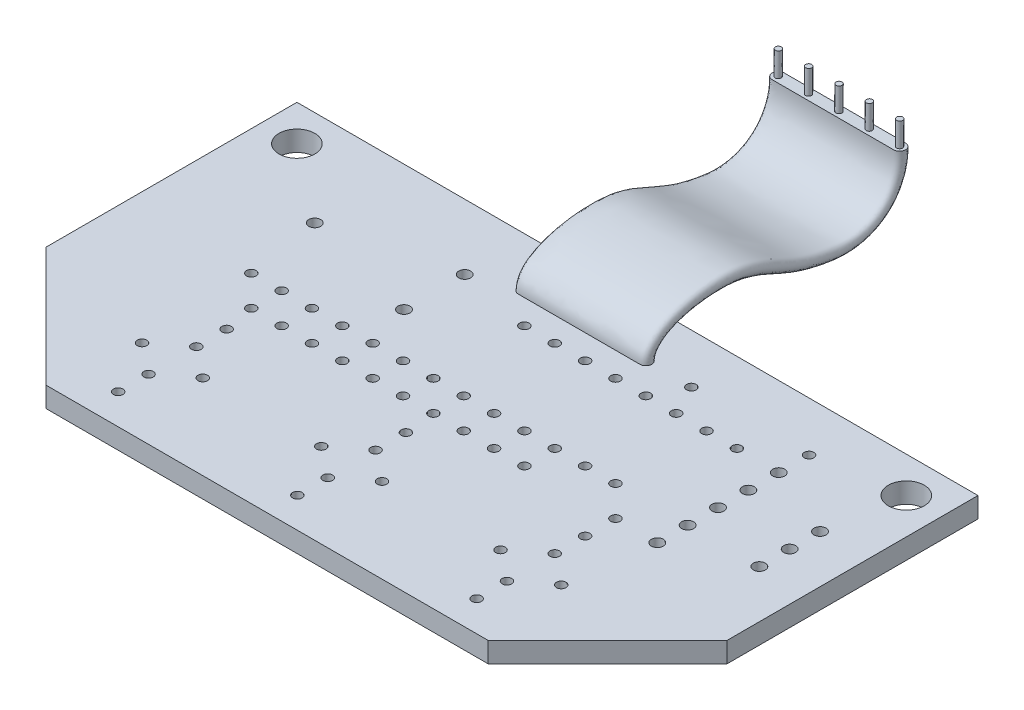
ISO-10303-21;
HEADER;
FILE_DESCRIPTION(('STEP AP214'),'2;1');
FILE_NAME('part.step','',(''),(''),'','','');
FILE_SCHEMA(('AUTOMOTIVE_DESIGN { 1 0 10303 214 1 1 1 1 }'));
ENDSEC;
DATA;
#1=APPLICATION_CONTEXT('core data for automotive mechanical design processes');
#2=APPLICATION_PROTOCOL_DEFINITION('international standard','automotive_design',2000,#1);
#3=PRODUCT_CONTEXT('',#1,'mechanical');
#4=PRODUCT('Part','Part','',(#3));
#5=PRODUCT_RELATED_PRODUCT_CATEGORY('part','',(#4));
#6=PRODUCT_DEFINITION_FORMATION('','',#4);
#7=PRODUCT_DEFINITION_CONTEXT('part definition',#1,'design');
#8=PRODUCT_DEFINITION('design','',#6,#7);
#9=PRODUCT_DEFINITION_SHAPE('','',#8);
#10=(LENGTH_UNIT() NAMED_UNIT(*) SI_UNIT(.MILLI.,.METRE.));
#11=(NAMED_UNIT(*) PLANE_ANGLE_UNIT() SI_UNIT($,.RADIAN.));
#12=(NAMED_UNIT(*) SI_UNIT($,.STERADIAN.) SOLID_ANGLE_UNIT());
#13=UNCERTAINTY_MEASURE_WITH_UNIT(LENGTH_MEASURE(1.E-05),#10,'distance_accuracy_value','');
#14=(GEOMETRIC_REPRESENTATION_CONTEXT(3) GLOBAL_UNCERTAINTY_ASSIGNED_CONTEXT((#13)) GLOBAL_UNIT_ASSIGNED_CONTEXT((#10,
#11,#12)) REPRESENTATION_CONTEXT('',''));
#15=CARTESIAN_POINT('',(0.,0.,0.));
#16=DIRECTION('',(0.,0.,1.));
#17=DIRECTION('',(1.,0.,0.));
#18=AXIS2_PLACEMENT_3D('',#15,#16,#17);
#19=CARTESIAN_POINT('',(4.83999999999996,6.62675629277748,-48.0953878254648));
#20=DIRECTION('',(0.,0.999972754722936,-0.00738172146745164));
#21=DIRECTION('',(0.,0.00738172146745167,0.999972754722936));
#22=AXIS2_PLACEMENT_3D('',#19,#20,#21);
#23=PLANE('',#22);
#24=CARTESIAN_POINT('',(-2.78000000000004,6.62675629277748,-48.0953878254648));
#25=DIRECTION('',(0.,0.999972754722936,-0.00738172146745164));
#26=DIRECTION('',(0.,0.00738172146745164,0.999972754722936));
#27=AXIS2_PLACEMENT_3D('',#24,#25,#26);
#28=CIRCLE('',#27,0.250000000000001);
#29=CARTESIAN_POINT('',(-2.78000000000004,6.62860172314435,-47.8453946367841));
#30=VERTEX_POINT('',#29);
#31=EDGE_CURVE('E771',#30,#30,#28,.T.);
#32=ORIENTED_EDGE('',*,*,#31,.F.);
#33=EDGE_LOOP('',(#32));
#34=FACE_BOUND('',#33,.T.);
#35=CARTESIAN_POINT('',(2.29999999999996,6.62675629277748,-48.0953878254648));
#36=DIRECTION('',(0.,0.999972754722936,-0.00738172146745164));
#37=DIRECTION('',(0.,0.00738172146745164,0.999972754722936));
#38=AXIS2_PLACEMENT_3D('',#35,#36,#37);
#39=CIRCLE('',#38,0.250000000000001);
#40=CARTESIAN_POINT('',(2.29999999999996,6.62860172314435,-47.8453946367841));
#41=VERTEX_POINT('',#40);
#42=EDGE_CURVE('E788',#41,#41,#39,.T.);
#43=ORIENTED_EDGE('',*,*,#42,.F.);
#44=EDGE_LOOP('',(#43));
#45=FACE_BOUND('',#44,.T.);
#46=CARTESIAN_POINT('',(4.83999999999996,6.62675629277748,-48.0953878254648));
#47=DIRECTION('',(0.,0.999972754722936,-0.00738172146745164));
#48=DIRECTION('',(0.,0.00738172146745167,0.999972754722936));
#49=AXIS2_PLACEMENT_3D('',#46,#47,#48);
#50=CIRCLE('',#49,0.5);
#51=CARTESIAN_POINT('',(4.83999999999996,6.63044715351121,-47.5954014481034));
#52=VERTEX_POINT('',#51);
#53=CARTESIAN_POINT('',(4.83999999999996,6.62306543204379,-48.5953742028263));
#54=VERTEX_POINT('',#53);
#55=EDGE_CURVE('E105',#52,#54,#50,.T.);
#56=ORIENTED_EDGE('',*,*,#55,.T.);
#57=DIRECTION('',(-1.,0.,0.));
#58=VECTOR('',#57,1.);
#59=CARTESIAN_POINT('',(-5.32000000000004,6.62306543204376,-48.5953742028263));
#60=LINE('',#59,#58);
#61=CARTESIAN_POINT('',(-5.32000000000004,6.62306543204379,-48.5953742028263));
#62=VERTEX_POINT('',#61);
#63=EDGE_CURVE('E109',#54,#62,#60,.T.);
#64=ORIENTED_EDGE('',*,*,#63,.T.);
#65=CARTESIAN_POINT('',(-5.32000000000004,6.62675629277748,-48.0953878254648));
#66=DIRECTION('',(0.,0.999972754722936,-0.00738172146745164));
#67=DIRECTION('',(0.,0.00738172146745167,0.999972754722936));
#68=AXIS2_PLACEMENT_3D('',#65,#66,#67);
#69=CIRCLE('',#68,0.5);
#70=CARTESIAN_POINT('',(-5.32000000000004,6.63044715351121,-47.5954014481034));
#71=VERTEX_POINT('',#70);
#72=EDGE_CURVE('E102',#62,#71,#69,.T.);
#73=ORIENTED_EDGE('',*,*,#72,.T.);
#74=DIRECTION('',(1.,0.,0.));
#75=VECTOR('',#74,1.);
#76=CARTESIAN_POINT('',(-5.32000000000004,6.63044715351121,-47.5954014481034));
#77=LINE('',#76,#75);
#78=EDGE_CURVE('E99',#71,#52,#77,.T.);
#79=ORIENTED_EDGE('',*,*,#78,.T.);
#80=EDGE_LOOP('',(#56,#64,#73,#79));
#81=FACE_BOUND('',#80,.T.);
#82=CARTESIAN_POINT('',(4.83999999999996,6.62675629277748,-48.0953878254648));
#83=DIRECTION('',(0.,0.999972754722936,-0.00738172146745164));
#84=DIRECTION('',(0.,0.00738172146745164,0.999972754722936));
#85=AXIS2_PLACEMENT_3D('',#82,#83,#84);
#86=CIRCLE('',#85,0.250000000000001);
#87=CARTESIAN_POINT('',(4.83999999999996,6.62860172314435,-47.8453946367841));
#88=VERTEX_POINT('',#87);
#89=EDGE_CURVE('E794',#88,#88,#86,.T.);
#90=ORIENTED_EDGE('',*,*,#89,.F.);
#91=EDGE_LOOP('',(#90));
#92=FACE_BOUND('',#91,.T.);
#93=CARTESIAN_POINT('',(-0.240000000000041,6.62675629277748,-48.0953878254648));
#94=DIRECTION('',(0.,0.999972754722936,-0.00738172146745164));
#95=DIRECTION('',(0.,0.00738172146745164,0.999972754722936));
#96=AXIS2_PLACEMENT_3D('',#93,#94,#95);
#97=CIRCLE('',#96,0.250000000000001);
#98=CARTESIAN_POINT('',(-0.240000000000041,6.62860172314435,-47.8453946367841));
#99=VERTEX_POINT('',#98);
#100=EDGE_CURVE('E782',#99,#99,#97,.T.);
#101=ORIENTED_EDGE('',*,*,#100,.F.);
#102=EDGE_LOOP('',(#101));
#103=FACE_BOUND('',#102,.T.);
#104=CARTESIAN_POINT('',(-5.32000000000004,6.62675629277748,-48.0953878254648));
#105=DIRECTION('',(0.,0.999972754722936,-0.00738172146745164));
#106=DIRECTION('',(0.,0.00738172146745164,0.999972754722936));
#107=AXIS2_PLACEMENT_3D('',#104,#105,#106);
#108=CIRCLE('',#107,0.250000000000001);
#109=CARTESIAN_POINT('',(-5.32000000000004,6.62860172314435,-47.8453946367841));
#110=VERTEX_POINT('',#109);
#111=EDGE_CURVE('E772',#110,#110,#108,.T.);
#112=ORIENTED_EDGE('',*,*,#111,.F.);
#113=EDGE_LOOP('',(#112));
#114=FACE_BOUND('',#113,.T.);
#115=ADVANCED_FACE('F16',(#34,#45,#81,#92,#103,#114),#23,.T.);
#116=CARTESIAN_POINT('',(-28.5,1.7,0.));
#117=DIRECTION('',(0.,-1.,0.));
#118=DIRECTION('',(0.,0.,-1.));
#119=AXIS2_PLACEMENT_3D('',#116,#117,#118);
#120=PLANE('',#119);
#121=DIRECTION('',(1.,0.,0.));
#122=VECTOR('',#121,1.);
#123=CARTESIAN_POINT('',(-28.5,1.7,-27.36));
#124=LINE('',#123,#122);
#125=CARTESIAN_POINT('',(4.83999999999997,1.7,-27.36));
#126=VERTEX_POINT('',#125);
#127=CARTESIAN_POINT('',(-5.32000000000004,1.7,-27.36));
#128=VERTEX_POINT('',#127);
#129=EDGE_CURVE('E20',#126,#128,#124,.F.);
#130=ORIENTED_EDGE('',*,*,#129,.F.);
#131=CARTESIAN_POINT('',(4.83999999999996,1.7,-26.36));
#132=CARTESIAN_POINT('',(4.86812840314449,1.7,-26.3599761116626));
#133=CARTESIAN_POINT('',(4.89624967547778,1.7,-26.3623721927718));
#134=CARTESIAN_POINT('',(4.95167672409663,1.7,-26.3718282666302));
#135=CARTESIAN_POINT('',(4.97898308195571,1.7,-26.3788848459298));
#136=CARTESIAN_POINT('',(5.03203482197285,1.7,-26.3974906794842));
#137=CARTESIAN_POINT('',(5.05777947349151,1.7,-26.4090420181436));
#138=CARTESIAN_POINT('',(5.1069594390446,1.7,-26.4362990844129));
#139=CARTESIAN_POINT('',(5.13039520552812,1.7,-26.4520039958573));
#140=CARTESIAN_POINT('',(5.17428433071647,1.7,-26.4871147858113));
#141=CARTESIAN_POINT('',(5.19473948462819,1.7,-26.5065184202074));
#142=CARTESIAN_POINT('',(5.23213097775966,1.7,-26.5485120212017));
#143=CARTESIAN_POINT('',(5.24906232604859,1.7,-26.5711064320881));
#144=CARTESIAN_POINT('',(5.27886543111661,1.7,-26.6187817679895));
#145=CARTESIAN_POINT('',(5.29174338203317,1.7,-26.6438588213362));
#146=CARTESIAN_POINT('',(5.31312811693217,1.7,-26.6958613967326));
#147=CARTESIAN_POINT('',(5.32162756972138,1.7,-26.7227899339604));
#148=CARTESIAN_POINT('',(5.33398092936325,1.7,-26.7776922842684));
#149=CARTESIAN_POINT('',(5.33783483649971,1.7,-26.8056660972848));
#150=CARTESIAN_POINT('',(5.34078517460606,1.7,-26.8618165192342));
#151=CARTESIAN_POINT('',(5.33988952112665,1.7,-26.8899927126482));
#152=CARTESIAN_POINT('',(5.33337946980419,1.7,-26.9458378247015));
#153=CARTESIAN_POINT('',(5.3277579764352,1.7,-26.9735059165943));
#154=CARTESIAN_POINT('',(5.31195738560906,1.7,-27.0274681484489));
#155=CARTESIAN_POINT('',(5.30178439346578,1.7,-27.0537640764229));
#156=CARTESIAN_POINT('',(5.27716223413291,1.7,-27.1042940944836));
#157=CARTESIAN_POINT('',(5.26271010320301,1.7,-27.1285267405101));
#158=CARTESIAN_POINT('',(5.22994334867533,1.7,-27.1742205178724));
#159=CARTESIAN_POINT('',(5.21162891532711,1.7,-27.1956817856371));
#160=CARTESIAN_POINT('',(5.17165615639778,1.7,-27.2352261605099));
#161=CARTESIAN_POINT('',(5.14999766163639,1.7,-27.2533090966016));
#162=CARTESIAN_POINT('',(5.10395280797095,1.7,-27.2855809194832));
#163=CARTESIAN_POINT('',(5.07956659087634,1.7,-27.2997700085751));
#164=CARTESIAN_POINT('',(5.02874009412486,1.7,-27.323863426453));
#165=CARTESIAN_POINT('',(5.00229820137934,1.7,-27.3337643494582));
#166=CARTESIAN_POINT('',(4.94816033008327,1.7,-27.3489672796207));
#167=CARTESIAN_POINT('',(4.920466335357,1.7,-27.3542763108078));
#168=CARTESIAN_POINT('',(4.87508348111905,1.7,-27.3590793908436));
#169=CARTESIAN_POINT('',(4.85753712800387,1.7,-27.360007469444));
#170=CARTESIAN_POINT('',(4.83999999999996,1.7,-27.36));
#171=B_SPLINE_CURVE_WITH_KNOTS('',3,(#131,#132,#133,#134,#135,#136,#137,#138,#139,#140,#141,
#142,#143,#144,#145,#146,#147,#148,#149,#150,#151,#152,#153,#154,#155,#156,#157,#158,#159,#160,
#161,#162,#163,#164,#165,#166,#167,#168,#169,#170),.UNSPECIFIED.,.F.,.F.,(4,2,2,2,2,2,2,2,2,2,2,
2,2,2,2,2,2,2,2,4),(0.,0.0842731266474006,0.168484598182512,0.252735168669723,0.336969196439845,
0.42115227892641,0.50545379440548,0.58962585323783,0.673938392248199,0.758250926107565,
0.842422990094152,0.92672165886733,1.01090758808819,1.09515196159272,1.17939218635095,
1.26363667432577,1.34787678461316,1.43218367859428,1.51636138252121,1.56897272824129),.UNSPECIFIED.);
#172=CARTESIAN_POINT('',(4.83999999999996,1.7,-26.36));
#173=VERTEX_POINT('',#172);
#174=EDGE_CURVE('E35',#173,#126,#171,.T.);
#175=ORIENTED_EDGE('',*,*,#174,.F.);
#176=DIRECTION('',(1.,0.,0.));
#177=VECTOR('',#176,1.);
#178=CARTESIAN_POINT('',(-28.5,1.7,-26.36));
#179=LINE('',#178,#177);
#180=CARTESIAN_POINT('',(-5.32000000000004,1.7,-26.36));
#181=VERTEX_POINT('',#180);
#182=EDGE_CURVE('E118',#181,#173,#179,.T.);
#183=ORIENTED_EDGE('',*,*,#182,.F.);
#184=CARTESIAN_POINT('',(-5.32000000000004,1.7,-27.36));
#185=CARTESIAN_POINT('',(-5.34812840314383,1.7,-27.3600238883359));
#186=CARTESIAN_POINT('',(-5.37624967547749,1.7,-27.3576278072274));
#187=CARTESIAN_POINT('',(-5.43167672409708,1.7,-27.3481717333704));
#188=CARTESIAN_POINT('',(-5.45898308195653,1.7,-27.3411151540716));
#189=CARTESIAN_POINT('',(-5.51203482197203,1.7,-27.3225093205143));
#190=CARTESIAN_POINT('',(-5.5377794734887,1.7,-27.3109579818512));
#191=CARTESIAN_POINT('',(-5.58695943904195,1.7,-27.283700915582));
#192=CARTESIAN_POINT('',(-5.6103952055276,1.7,-27.2679960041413));
#193=CARTESIAN_POINT('',(-5.65428433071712,1.7,-27.2328852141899));
#194=CARTESIAN_POINT('',(-5.67473948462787,1.7,-27.2134815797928));
#195=CARTESIAN_POINT('',(-5.71213097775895,1.7,-27.1714879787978));
#196=CARTESIAN_POINT('',(-5.72906232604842,1.7,-27.1488935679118));
#197=CARTESIAN_POINT('',(-5.75886543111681,1.7,-27.1012182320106));
#198=CARTESIAN_POINT('',(-5.77174338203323,1.7,-27.0761411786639));
#199=CARTESIAN_POINT('',(-5.79312811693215,1.7,-27.0241386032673));
#200=CARTESIAN_POINT('',(-5.80162756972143,1.7,-26.9972100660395));
#201=CARTESIAN_POINT('',(-5.81398092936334,1.7,-26.9423077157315));
#202=CARTESIAN_POINT('',(-5.8178348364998,1.7,-26.9143339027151));
#203=CARTESIAN_POINT('',(-5.82078517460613,1.7,-26.8581834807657));
#204=CARTESIAN_POINT('',(-5.81988952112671,1.7,-26.8300072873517));
#205=CARTESIAN_POINT('',(-5.81337946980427,1.7,-26.7741621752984));
#206=CARTESIAN_POINT('',(-5.80775797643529,1.7,-26.7464940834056));
#207=CARTESIAN_POINT('',(-5.79195738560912,1.7,-26.692531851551));
#208=CARTESIAN_POINT('',(-5.78178439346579,1.7,-26.6662359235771));
#209=CARTESIAN_POINT('',(-5.75716223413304,1.7,-26.6157059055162));
#210=CARTESIAN_POINT('',(-5.7427101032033,1.7,-26.5914732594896));
#211=CARTESIAN_POINT('',(-5.70994334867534,1.7,-26.5457794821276));
#212=CARTESIAN_POINT('',(-5.69162891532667,1.7,-26.5243182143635));
#213=CARTESIAN_POINT('',(-5.65165615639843,1.7,-26.4847738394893));
#214=CARTESIAN_POINT('',(-5.62999766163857,1.7,-26.4666909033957));
#215=CARTESIAN_POINT('',(-5.58395280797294,1.7,-26.4344190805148));
#216=CARTESIAN_POINT('',(-5.55956659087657,1.7,-26.4202299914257));
#217=CARTESIAN_POINT('',(-5.50874009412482,1.7,-26.396136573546));
#218=CARTESIAN_POINT('',(-5.4822982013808,1.7,-26.3862356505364));
#219=CARTESIAN_POINT('',(-5.42816033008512,1.7,-26.3710327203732));
#220=CARTESIAN_POINT('',(-5.40046633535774,1.7,-26.3657236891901));
#221=CARTESIAN_POINT('',(-5.35508348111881,1.7,-26.3609206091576));
#222=CARTESIAN_POINT('',(-5.33753712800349,1.7,-26.3599925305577));
#223=CARTESIAN_POINT('',(-5.32000000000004,1.7,-26.36));
#224=B_SPLINE_CURVE_WITH_KNOTS('',3,(#184,#185,#186,#187,#188,#189,#190,#191,#192,#193,#194,
#195,#196,#197,#198,#199,#200,#201,#202,#203,#204,#205,#206,#207,#208,#209,#210,#211,#212,#213,
#214,#215,#216,#217,#218,#219,#220,#221,#222,#223),.UNSPECIFIED.,.F.,.F.,(4,2,2,2,2,2,2,2,2,2,2,
2,2,2,2,2,2,2,2,4),(0.,0.0842731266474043,0.168484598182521,0.252735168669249,0.336969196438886,
0.421152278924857,0.505453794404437,0.58962585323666,0.673938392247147,0.758250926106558,
0.842422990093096,0.926721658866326,1.01090758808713,1.09515196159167,1.17939218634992,
1.2636366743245,1.34787678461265,1.43218367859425,1.51636138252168,1.56897272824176),.UNSPECIFIED.);
#225=EDGE_CURVE('E563',#128,#181,#224,.T.);
#226=ORIENTED_EDGE('',*,*,#225,.F.);
#227=EDGE_LOOP('',(#130,#175,#183,#226));
#228=FACE_BOUND('',#227,.T.);
#229=CARTESIAN_POINT('',(18.5,1.7,-26.86));
#230=DIRECTION('',(0.,1.,0.));
#231=DIRECTION('',(0.,0.,1.));
#232=AXIS2_PLACEMENT_3D('',#229,#230,#231);
#233=CIRCLE('',#232,0.400000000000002);
#234=CARTESIAN_POINT('',(18.5,1.7,-26.46));
#235=VERTEX_POINT('',#234);
#236=EDGE_CURVE('E124',#235,#235,#233,.T.);
#237=ORIENTED_EDGE('',*,*,#236,.F.);
#238=EDGE_LOOP('',(#237));
#239=FACE_BOUND('',#238,.T.);
#240=CARTESIAN_POINT('',(-19.01,1.7,-23.));
#241=DIRECTION('',(0.,1.,0.));
#242=DIRECTION('',(0.,0.,1.));
#243=AXIS2_PLACEMENT_3D('',#240,#241,#242);
#244=CIRCLE('',#243,0.499999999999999);
#245=CARTESIAN_POINT('',(-19.01,1.7,-22.5));
#246=VERTEX_POINT('',#245);
#247=EDGE_CURVE('E136',#246,#246,#244,.T.);
#248=ORIENTED_EDGE('',*,*,#247,.F.);
#249=EDGE_LOOP('',(#248));
#250=FACE_BOUND('',#249,.T.);
#251=CARTESIAN_POINT('',(-2.78,1.7,-14.1599999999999));
#252=DIRECTION('',(0.,1.,0.));
#253=DIRECTION('',(0.,0.,1.));
#254=AXIS2_PLACEMENT_3D('',#251,#252,#253);
#255=CIRCLE('',#254,0.399999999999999);
#256=CARTESIAN_POINT('',(-2.78,1.7,-13.7599999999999));
#257=VERTEX_POINT('',#256);
#258=EDGE_CURVE('E148',#257,#257,#255,.T.);
#259=ORIENTED_EDGE('',*,*,#258,.F.);
#260=EDGE_LOOP('',(#259));
#261=FACE_BOUND('',#260,.T.);
#262=CARTESIAN_POINT('',(-9.,1.7,-25.54));
#263=DIRECTION('',(0.,1.,0.));
#264=DIRECTION('',(0.,0.,1.));
#265=AXIS2_PLACEMENT_3D('',#262,#263,#264);
#266=CIRCLE('',#265,0.500000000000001);
#267=CARTESIAN_POINT('',(-9.,1.7,-25.04));
#268=VERTEX_POINT('',#267);
#269=EDGE_CURVE('E160',#268,#268,#266,.T.);
#270=ORIENTED_EDGE('',*,*,#269,.F.);
#271=EDGE_LOOP('',(#270));
#272=FACE_BOUND('',#271,.T.);
#273=CARTESIAN_POINT('',(-0.240000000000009,1.7,-16.6999999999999));
#274=DIRECTION('',(0.,1.,0.));
#275=DIRECTION('',(0.,0.,1.));
#276=AXIS2_PLACEMENT_3D('',#273,#274,#275);
#277=CIRCLE('',#276,0.399999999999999);
#278=CARTESIAN_POINT('',(-0.240000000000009,1.7,-16.2999999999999));
#279=VERTEX_POINT('',#278);
#280=EDGE_CURVE('E172',#279,#279,#277,.T.);
#281=ORIENTED_EDGE('',*,*,#280,.F.);
#282=EDGE_LOOP('',(#281));
#283=FACE_BOUND('',#282,.T.);
#284=CARTESIAN_POINT('',(2.29999999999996,1.7,-24.3199999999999));
#285=DIRECTION('',(0.,1.,0.));
#286=DIRECTION('',(0.,0.,1.));
#287=AXIS2_PLACEMENT_3D('',#284,#285,#286);
#288=CIRCLE('',#287,0.399999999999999);
#289=CARTESIAN_POINT('',(2.29999999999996,1.7,-23.9199999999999));
#290=VERTEX_POINT('',#289);
#291=EDGE_CURVE('E184',#290,#290,#288,.T.);
#292=ORIENTED_EDGE('',*,*,#291,.F.);
#293=EDGE_LOOP('',(#292));
#294=FACE_BOUND('',#293,.T.);
#295=CARTESIAN_POINT('',(2.3,1.7,-14.1599999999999));
#296=DIRECTION('',(0.,1.,0.));
#297=DIRECTION('',(0.,0.,1.));
#298=AXIS2_PLACEMENT_3D('',#295,#296,#297);
#299=CIRCLE('',#298,0.399999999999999);
#300=CARTESIAN_POINT('',(2.3,1.7,-13.7599999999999));
#301=VERTEX_POINT('',#300);
#302=EDGE_CURVE('E196',#301,#301,#299,.T.);
#303=ORIENTED_EDGE('',*,*,#302,.F.);
#304=EDGE_LOOP('',(#303));
#305=FACE_BOUND('',#304,.T.);
#306=CARTESIAN_POINT('',(-18.02,1.7,-16.6999999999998));
#307=DIRECTION('',(0.,1.,0.));
#308=DIRECTION('',(0.,0.,1.));
#309=AXIS2_PLACEMENT_3D('',#306,#307,#308);
#310=CIRCLE('',#309,0.399999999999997);
#311=CARTESIAN_POINT('',(-18.02,1.7,-16.2999999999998));
#312=VERTEX_POINT('',#311);
#313=EDGE_CURVE('E208',#312,#312,#310,.T.);
#314=ORIENTED_EDGE('',*,*,#313,.F.);
#315=EDGE_LOOP('',(#314));
#316=FACE_BOUND('',#315,.T.);
#317=CARTESIAN_POINT('',(4.84,1.7,-14.1599999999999));
#318=DIRECTION('',(0.,1.,0.));
#319=DIRECTION('',(0.,0.,1.));
#320=AXIS2_PLACEMENT_3D('',#317,#318,#319);
#321=CIRCLE('',#320,0.399999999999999);
#322=CARTESIAN_POINT('',(4.84,1.7,-13.7599999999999));
#323=VERTEX_POINT('',#322);
#324=EDGE_CURVE('E220',#323,#323,#321,.T.);
#325=ORIENTED_EDGE('',*,*,#324,.F.);
#326=EDGE_LOOP('',(#325));
#327=FACE_BOUND('',#326,.T.);
#328=CARTESIAN_POINT('',(-15.48,1.7,-16.6999999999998));
#329=DIRECTION('',(0.,1.,0.));
#330=DIRECTION('',(0.,0.,1.));
#331=AXIS2_PLACEMENT_3D('',#328,#329,#330);
#332=CIRCLE('',#331,0.399999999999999);
#333=CARTESIAN_POINT('',(-15.48,1.7,-16.2999999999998));
#334=VERTEX_POINT('',#333);
#335=EDGE_CURVE('E232',#334,#334,#332,.T.);
#336=ORIENTED_EDGE('',*,*,#335,.F.);
#337=EDGE_LOOP('',(#336));
#338=FACE_BOUND('',#337,.T.);
#339=CARTESIAN_POINT('',(7.38,1.7,-14.1599999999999));
#340=DIRECTION('',(0.,1.,0.));
#341=DIRECTION('',(0.,0.,1.));
#342=AXIS2_PLACEMENT_3D('',#339,#340,#341);
#343=CIRCLE('',#342,0.399999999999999);
#344=CARTESIAN_POINT('',(7.38,1.7,-13.7599999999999));
#345=VERTEX_POINT('',#344);
#346=EDGE_CURVE('E244',#345,#345,#343,.T.);
#347=ORIENTED_EDGE('',*,*,#346,.F.);
#348=EDGE_LOOP('',(#347));
#349=FACE_BOUND('',#348,.T.);
#350=CARTESIAN_POINT('',(-15.48,1.7,-14.1599999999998));
#351=DIRECTION('',(0.,1.,0.));
#352=DIRECTION('',(0.,0.,1.));
#353=AXIS2_PLACEMENT_3D('',#350,#351,#352);
#354=CIRCLE('',#353,0.399999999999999);
#355=CARTESIAN_POINT('',(-15.48,1.7,-13.7599999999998));
#356=VERTEX_POINT('',#355);
#357=EDGE_CURVE('E256',#356,#356,#354,.T.);
#358=ORIENTED_EDGE('',*,*,#357,.F.);
#359=EDGE_LOOP('',(#358));
#360=FACE_BOUND('',#359,.T.);
#361=CARTESIAN_POINT('',(9.91999999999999,1.7,-16.7));
#362=DIRECTION('',(0.,1.,0.));
#363=DIRECTION('',(0.,0.,1.));
#364=AXIS2_PLACEMENT_3D('',#361,#362,#363);
#365=CIRCLE('',#364,0.399999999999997);
#366=CARTESIAN_POINT('',(9.91999999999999,1.7,-16.3));
#367=VERTEX_POINT('',#366);
#368=EDGE_CURVE('E268',#367,#367,#365,.T.);
#369=ORIENTED_EDGE('',*,*,#368,.F.);
#370=EDGE_LOOP('',(#369));
#371=FACE_BOUND('',#370,.T.);
#372=CARTESIAN_POINT('',(12.46,1.7,-24.32));
#373=DIRECTION('',(0.,1.,0.));
#374=DIRECTION('',(0.,0.,1.));
#375=AXIS2_PLACEMENT_3D('',#372,#373,#374);
#376=CIRCLE('',#375,0.399999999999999);
#377=CARTESIAN_POINT('',(12.46,1.7,-23.92));
#378=VERTEX_POINT('',#377);
#379=EDGE_CURVE('E280',#378,#378,#376,.T.);
#380=ORIENTED_EDGE('',*,*,#379,.F.);
#381=EDGE_LOOP('',(#380));
#382=FACE_BOUND('',#381,.T.);
#383=CARTESIAN_POINT('',(-10.4,1.7,-14.1599999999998));
#384=DIRECTION('',(0.,1.,0.));
#385=DIRECTION('',(0.,0.,1.));
#386=AXIS2_PLACEMENT_3D('',#383,#384,#385);
#387=CIRCLE('',#386,0.399999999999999);
#388=CARTESIAN_POINT('',(-10.4,1.7,-13.7599999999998));
#389=VERTEX_POINT('',#388);
#390=EDGE_CURVE('E292',#389,#389,#387,.T.);
#391=ORIENTED_EDGE('',*,*,#390,.F.);
#392=EDGE_LOOP('',(#391));
#393=FACE_BOUND('',#392,.T.);
#394=CARTESIAN_POINT('',(-7.86000000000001,1.7,-16.6999999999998));
#395=DIRECTION('',(0.,1.,0.));
#396=DIRECTION('',(0.,0.,1.));
#397=AXIS2_PLACEMENT_3D('',#394,#395,#396);
#398=CIRCLE('',#397,0.399999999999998);
#399=CARTESIAN_POINT('',(-7.86000000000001,1.7,-16.2999999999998));
#400=VERTEX_POINT('',#399);
#401=EDGE_CURVE('E304',#400,#400,#398,.T.);
#402=ORIENTED_EDGE('',*,*,#401,.F.);
#403=EDGE_LOOP('',(#402));
#404=FACE_BOUND('',#403,.T.);
#405=CARTESIAN_POINT('',(24.5,1.7,-21.78));
#406=DIRECTION('',(0.,1.,0.));
#407=DIRECTION('',(0.,0.,1.));
#408=AXIS2_PLACEMENT_3D('',#405,#406,#407);
#409=CIRCLE('',#408,0.499999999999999);
#410=CARTESIAN_POINT('',(24.5,1.7,-21.28));
#411=VERTEX_POINT('',#410);
#412=EDGE_CURVE('E316',#411,#411,#409,.T.);
#413=ORIENTED_EDGE('',*,*,#412,.F.);
#414=EDGE_LOOP('',(#413));
#415=FACE_BOUND('',#414,.T.);
#416=CARTESIAN_POINT('',(24.5,1.7,-16.7));
#417=DIRECTION('',(0.,1.,0.));
#418=DIRECTION('',(0.,0.,1.));
#419=AXIS2_PLACEMENT_3D('',#416,#417,#418);
#420=CIRCLE('',#419,0.499999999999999);
#421=CARTESIAN_POINT('',(24.5,1.7,-16.2));
#422=VERTEX_POINT('',#421);
#423=EDGE_CURVE('E328',#422,#422,#420,.T.);
#424=ORIENTED_EDGE('',*,*,#423,.F.);
#425=EDGE_LOOP('',(#424));
#426=FACE_BOUND('',#425,.T.);
#427=CARTESIAN_POINT('',(15.,1.7,-24.32));
#428=DIRECTION('',(0.,1.,0.));
#429=DIRECTION('',(0.,0.,1.));
#430=AXIS2_PLACEMENT_3D('',#427,#428,#429);
#431=CIRCLE('',#430,0.399999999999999);
#432=CARTESIAN_POINT('',(15.,1.7,-23.92));
#433=VERTEX_POINT('',#432);
#434=EDGE_CURVE('E340',#433,#433,#431,.T.);
#435=ORIENTED_EDGE('',*,*,#434,.F.);
#436=EDGE_LOOP('',(#435));
#437=FACE_BOUND('',#436,.T.);
#438=CARTESIAN_POINT('',(-5.32000000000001,1.7,-16.6999999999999));
#439=DIRECTION('',(0.,1.,0.));
#440=DIRECTION('',(0.,0.,1.));
#441=AXIS2_PLACEMENT_3D('',#438,#439,#440);
#442=CIRCLE('',#441,0.399999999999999);
#443=CARTESIAN_POINT('',(-5.32000000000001,1.7,-16.2999999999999));
#444=VERTEX_POINT('',#443);
#445=EDGE_CURVE('E352',#444,#444,#442,.T.);
#446=ORIENTED_EDGE('',*,*,#445,.F.);
#447=EDGE_LOOP('',(#446));
#448=FACE_BOUND('',#447,.T.);
#449=CARTESIAN_POINT('',(-5.32,1.7,-14.1599999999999));
#450=DIRECTION('',(0.,1.,0.));
#451=DIRECTION('',(0.,0.,1.));
#452=AXIS2_PLACEMENT_3D('',#449,#450,#451);
#453=CIRCLE('',#452,0.399999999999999);
#454=CARTESIAN_POINT('',(-5.32,1.7,-13.7599999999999));
#455=VERTEX_POINT('',#454);
#456=EDGE_CURVE('E364',#455,#455,#453,.T.);
#457=ORIENTED_EDGE('',*,*,#456,.F.);
#458=EDGE_LOOP('',(#457));
#459=FACE_BOUND('',#458,.T.);
#460=CARTESIAN_POINT('',(18.5,1.7,-14.16));
#461=DIRECTION('',(0.,1.,0.));
#462=DIRECTION('',(0.,0.,1.));
#463=AXIS2_PLACEMENT_3D('',#460,#461,#462);
#464=CIRCLE('',#463,0.499999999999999);
#465=CARTESIAN_POINT('',(18.5,1.7,-13.66));
#466=VERTEX_POINT('',#465);
#467=EDGE_CURVE('E376',#466,#466,#464,.T.);
#468=ORIENTED_EDGE('',*,*,#467,.F.);
#469=EDGE_LOOP('',(#468));
#470=FACE_BOUND('',#469,.T.);
#471=CARTESIAN_POINT('',(-25.5,1.7,-28.));
#472=DIRECTION('',(0.,1.,0.));
#473=DIRECTION('',(0.,0.,-1.));
#474=AXIS2_PLACEMENT_3D('',#471,#472,#473);
#475=CIRCLE('',#474,1.5);
#476=CARTESIAN_POINT('',(-25.5,1.7,-29.5));
#477=VERTEX_POINT('',#476);
#478=EDGE_CURVE('E388',#477,#477,#475,.T.);
#479=ORIENTED_EDGE('',*,*,#478,.F.);
#480=EDGE_LOOP('',(#479));
#481=FACE_BOUND('',#480,.T.);
#482=CARTESIAN_POINT('',(-15.,1.7,-2.54));
#483=DIRECTION('',(0.,1.,0.));
#484=DIRECTION('',(0.,0.,-1.));
#485=AXIS2_PLACEMENT_3D('',#482,#483,#484);
#486=CIRCLE('',#485,0.4);
#487=CARTESIAN_POINT('',(-15.,1.7,-2.94));
#488=VERTEX_POINT('',#487);
#489=EDGE_CURVE('E400',#488,#488,#486,.T.);
#490=ORIENTED_EDGE('',*,*,#489,.F.);
#491=EDGE_LOOP('',(#490));
#492=FACE_BOUND('',#491,.T.);
#493=CARTESIAN_POINT('',(-17.54,1.7,-7.08));
#494=DIRECTION('',(0.,1.,0.));
#495=DIRECTION('',(0.,0.,-1.));
#496=AXIS2_PLACEMENT_3D('',#493,#494,#495);
#497=CIRCLE('',#496,0.400000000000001);
#498=CARTESIAN_POINT('',(-17.54,1.7,-7.48));
#499=VERTEX_POINT('',#498);
#500=EDGE_CURVE('E412',#499,#499,#497,.T.);
#501=ORIENTED_EDGE('',*,*,#500,.F.);
#502=EDGE_LOOP('',(#501));
#503=FACE_BOUND('',#502,.T.);
#504=CARTESIAN_POINT('',(-12.46,1.7,-7.08));
#505=DIRECTION('',(0.,1.,0.));
#506=DIRECTION('',(0.,0.,-1.));
#507=AXIS2_PLACEMENT_3D('',#504,#505,#506);
#508=CIRCLE('',#507,0.400000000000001);
#509=CARTESIAN_POINT('',(-12.46,1.7,-7.48));
#510=VERTEX_POINT('',#509);
#511=EDGE_CURVE('E424',#510,#510,#508,.T.);
#512=ORIENTED_EDGE('',*,*,#511,.F.);
#513=EDGE_LOOP('',(#512));
#514=FACE_BOUND('',#513,.T.);
#515=CARTESIAN_POINT('',(12.46,1.7,-7.08));
#516=DIRECTION('',(0.,1.,0.));
#517=DIRECTION('',(0.,0.,1.));
#518=AXIS2_PLACEMENT_3D('',#515,#516,#517);
#519=CIRCLE('',#518,0.400000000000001);
#520=CARTESIAN_POINT('',(12.46,1.7,-6.68));
#521=VERTEX_POINT('',#520);
#522=EDGE_CURVE('E436',#521,#521,#519,.T.);
#523=ORIENTED_EDGE('',*,*,#522,.F.);
#524=EDGE_LOOP('',(#523));
#525=FACE_BOUND('',#524,.T.);
#526=CARTESIAN_POINT('',(15.,1.7,-9.08));
#527=DIRECTION('',(0.,1.,0.));
#528=DIRECTION('',(0.,0.,1.));
#529=AXIS2_PLACEMENT_3D('',#526,#527,#528);
#530=CIRCLE('',#529,0.399999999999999);
#531=CARTESIAN_POINT('',(15.,1.7,-8.68));
#532=VERTEX_POINT('',#531);
#533=EDGE_CURVE('E448',#532,#532,#530,.T.);
#534=ORIENTED_EDGE('',*,*,#533,.F.);
#535=EDGE_LOOP('',(#534));
#536=FACE_BOUND('',#535,.T.);
#537=CARTESIAN_POINT('',(15.,1.7,-2.54));
#538=DIRECTION('',(0.,1.,0.));
#539=DIRECTION('',(0.,0.,1.));
#540=AXIS2_PLACEMENT_3D('',#537,#538,#539);
#541=CIRCLE('',#540,0.4);
#542=CARTESIAN_POINT('',(15.,1.7,-2.14));
#543=VERTEX_POINT('',#542);
#544=EDGE_CURVE('E460',#543,#543,#541,.T.);
#545=ORIENTED_EDGE('',*,*,#544,.F.);
#546=EDGE_LOOP('',(#545));
#547=FACE_BOUND('',#546,.T.);
#548=CARTESIAN_POINT('',(2.54,1.7,-7.08));
#549=DIRECTION('',(0.,1.,0.));
#550=DIRECTION('',(0.,0.,1.));
#551=AXIS2_PLACEMENT_3D('',#548,#549,#550);
#552=CIRCLE('',#551,0.4);
#553=CARTESIAN_POINT('',(2.54,1.7,-6.68));
#554=VERTEX_POINT('',#553);
#555=EDGE_CURVE('E472',#554,#554,#552,.T.);
#556=ORIENTED_EDGE('',*,*,#555,.F.);
#557=EDGE_LOOP('',(#556));
#558=FACE_BOUND('',#557,.T.);
#559=CARTESIAN_POINT('',(0.,1.7,-11.62));
#560=DIRECTION('',(0.,1.,0.));
#561=DIRECTION('',(0.,0.,1.));
#562=AXIS2_PLACEMENT_3D('',#559,#560,#561);
#563=CIRCLE('',#562,0.4);
#564=CARTESIAN_POINT('',(0.,1.7,-11.22));
#565=VERTEX_POINT('',#564);
#566=EDGE_CURVE('E484',#565,#565,#563,.T.);
#567=ORIENTED_EDGE('',*,*,#566,.F.);
#568=EDGE_LOOP('',(#567));
#569=FACE_BOUND('',#568,.T.);
#570=CARTESIAN_POINT('',(0.,1.7,-5.08));
#571=DIRECTION('',(0.,1.,0.));
#572=DIRECTION('',(0.,0.,1.));
#573=AXIS2_PLACEMENT_3D('',#570,#571,#572);
#574=CIRCLE('',#573,0.4);
#575=CARTESIAN_POINT('',(0.,1.7,-4.68));
#576=VERTEX_POINT('',#575);
#577=EDGE_CURVE('E496',#576,#576,#574,.T.);
#578=ORIENTED_EDGE('',*,*,#577,.F.);
#579=EDGE_LOOP('',(#578));
#580=FACE_BOUND('',#579,.T.);
#581=DIRECTION('',(1.,0.,0.));
#582=VECTOR('',#581,1.);
#583=CARTESIAN_POINT('',(18.5,1.7,0.));
#584=LINE('',#583,#582);
#585=CARTESIAN_POINT('',(-18.5,1.7,0.));
#586=VERTEX_POINT('',#585);
#587=CARTESIAN_POINT('',(18.5,1.7,0.));
#588=VERTEX_POINT('',#587);
#589=EDGE_CURVE('E518',#586,#588,#584,.T.);
#590=ORIENTED_EDGE('',*,*,#589,.T.);
#591=DIRECTION('',(0.707106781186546,0.,-0.707106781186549));
#592=VECTOR('',#591,1.);
#593=CARTESIAN_POINT('',(18.5,1.7,0.));
#594=LINE('',#593,#592);
#595=CARTESIAN_POINT('',(28.5,1.7,-10.));
#596=VERTEX_POINT('',#595);
#597=EDGE_CURVE('E520',#588,#596,#594,.T.);
#598=ORIENTED_EDGE('',*,*,#597,.T.);
#599=DIRECTION('',(0.,0.,-1.));
#600=VECTOR('',#599,1.);
#601=CARTESIAN_POINT('',(28.5,1.7,-31.));
#602=LINE('',#601,#600);
#603=CARTESIAN_POINT('',(28.5,1.7,-31.));
#604=VERTEX_POINT('',#603);
#605=EDGE_CURVE('E522',#596,#604,#602,.T.);
#606=ORIENTED_EDGE('',*,*,#605,.T.);
#607=DIRECTION('',(-1.,0.,0.));
#608=VECTOR('',#607,1.);
#609=CARTESIAN_POINT('',(-28.5,1.7,-31.));
#610=LINE('',#609,#608);
#611=CARTESIAN_POINT('',(-28.5,1.7,-31.));
#612=VERTEX_POINT('',#611);
#613=EDGE_CURVE('E524',#604,#612,#610,.T.);
#614=ORIENTED_EDGE('',*,*,#613,.T.);
#615=DIRECTION('',(0.,0.,1.));
#616=VECTOR('',#615,1.);
#617=CARTESIAN_POINT('',(-28.5,1.7,-10.));
#618=LINE('',#617,#616);
#619=CARTESIAN_POINT('',(-28.5,1.7,-10.));
#620=VERTEX_POINT('',#619);
#621=EDGE_CURVE('E55',#612,#620,#618,.T.);
#622=ORIENTED_EDGE('',*,*,#621,.T.);
#623=DIRECTION('',(0.707106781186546,0.,0.707106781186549));
#624=VECTOR('',#623,1.);
#625=CARTESIAN_POINT('',(-18.5,1.7,0.));
#626=LINE('',#625,#624);
#627=EDGE_CURVE('E50',#620,#586,#626,.T.);
#628=ORIENTED_EDGE('',*,*,#627,.T.);
#629=EDGE_LOOP('',(#590,#598,#606,#614,#622,#628));
#630=FACE_BOUND('',#629,.T.);
#631=CARTESIAN_POINT('',(0.,1.7,-2.54));
#632=DIRECTION('',(0.,1.,0.));
#633=DIRECTION('',(0.,0.,1.));
#634=AXIS2_PLACEMENT_3D('',#631,#632,#633);
#635=CIRCLE('',#634,0.4);
#636=CARTESIAN_POINT('',(0.,1.7,-2.14));
#637=VERTEX_POINT('',#636);
#638=EDGE_CURVE('E502',#637,#637,#635,.T.);
#639=ORIENTED_EDGE('',*,*,#638,.F.);
#640=EDGE_LOOP('',(#639));
#641=FACE_BOUND('',#640,.T.);
#642=CARTESIAN_POINT('',(0.,1.7,-9.08));
#643=DIRECTION('',(0.,1.,0.));
#644=DIRECTION('',(0.,0.,1.));
#645=AXIS2_PLACEMENT_3D('',#642,#643,#644);
#646=CIRCLE('',#645,0.4);
#647=CARTESIAN_POINT('',(0.,1.7,-8.68));
#648=VERTEX_POINT('',#647);
#649=EDGE_CURVE('E490',#648,#648,#646,.T.);
#650=ORIENTED_EDGE('',*,*,#649,.F.);
#651=EDGE_LOOP('',(#650));
#652=FACE_BOUND('',#651,.T.);
#653=CARTESIAN_POINT('',(-2.54,1.7,-7.08));
#654=DIRECTION('',(0.,1.,0.));
#655=DIRECTION('',(0.,0.,1.));
#656=AXIS2_PLACEMENT_3D('',#653,#654,#655);
#657=CIRCLE('',#656,0.4);
#658=CARTESIAN_POINT('',(-2.54,1.7,-6.68));
#659=VERTEX_POINT('',#658);
#660=EDGE_CURVE('E478',#659,#659,#657,.T.);
#661=ORIENTED_EDGE('',*,*,#660,.F.);
#662=EDGE_LOOP('',(#661));
#663=FACE_BOUND('',#662,.T.);
#664=CARTESIAN_POINT('',(-15.,1.7,-11.62));
#665=DIRECTION('',(0.,1.,0.));
#666=DIRECTION('',(0.,0.,-1.));
#667=AXIS2_PLACEMENT_3D('',#664,#665,#666);
#668=CIRCLE('',#667,0.399999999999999);
#669=CARTESIAN_POINT('',(-15.,1.7,-12.02));
#670=VERTEX_POINT('',#669);
#671=EDGE_CURVE('E466',#670,#670,#668,.T.);
#672=ORIENTED_EDGE('',*,*,#671,.F.);
#673=EDGE_LOOP('',(#672));
#674=FACE_BOUND('',#673,.T.);
#675=CARTESIAN_POINT('',(15.,1.7,-5.08));
#676=DIRECTION('',(0.,1.,0.));
#677=DIRECTION('',(0.,0.,1.));
#678=AXIS2_PLACEMENT_3D('',#675,#676,#677);
#679=CIRCLE('',#678,0.4);
#680=CARTESIAN_POINT('',(15.,1.7,-4.68));
#681=VERTEX_POINT('',#680);
#682=EDGE_CURVE('E454',#681,#681,#679,.T.);
#683=ORIENTED_EDGE('',*,*,#682,.F.);
#684=EDGE_LOOP('',(#683));
#685=FACE_BOUND('',#684,.T.);
#686=CARTESIAN_POINT('',(15.,1.7,-11.62));
#687=DIRECTION('',(0.,1.,0.));
#688=DIRECTION('',(0.,0.,1.));
#689=AXIS2_PLACEMENT_3D('',#686,#687,#688);
#690=CIRCLE('',#689,0.399999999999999);
#691=CARTESIAN_POINT('',(15.,1.7,-11.22));
#692=VERTEX_POINT('',#691);
#693=EDGE_CURVE('E442',#692,#692,#690,.T.);
#694=ORIENTED_EDGE('',*,*,#693,.F.);
#695=EDGE_LOOP('',(#694));
#696=FACE_BOUND('',#695,.T.);
#697=CARTESIAN_POINT('',(17.54,1.7,-7.08));
#698=DIRECTION('',(0.,1.,0.));
#699=DIRECTION('',(0.,0.,1.));
#700=AXIS2_PLACEMENT_3D('',#697,#698,#699);
#701=CIRCLE('',#700,0.400000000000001);
#702=CARTESIAN_POINT('',(17.54,1.7,-6.68));
#703=VERTEX_POINT('',#702);
#704=EDGE_CURVE('E430',#703,#703,#701,.T.);
#705=ORIENTED_EDGE('',*,*,#704,.F.);
#706=EDGE_LOOP('',(#705));
#707=FACE_BOUND('',#706,.T.);
#708=CARTESIAN_POINT('',(-15.,1.7,-9.08));
#709=DIRECTION('',(0.,1.,0.));
#710=DIRECTION('',(0.,0.,-1.));
#711=AXIS2_PLACEMENT_3D('',#708,#709,#710);
#712=CIRCLE('',#711,0.399999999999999);
#713=CARTESIAN_POINT('',(-15.,1.7,-9.48));
#714=VERTEX_POINT('',#713);
#715=EDGE_CURVE('E418',#714,#714,#712,.T.);
#716=ORIENTED_EDGE('',*,*,#715,.F.);
#717=EDGE_LOOP('',(#716));
#718=FACE_BOUND('',#717,.T.);
#719=CARTESIAN_POINT('',(-15.,1.7,-5.08));
#720=DIRECTION('',(0.,1.,0.));
#721=DIRECTION('',(0.,0.,-1.));
#722=AXIS2_PLACEMENT_3D('',#719,#720,#721);
#723=CIRCLE('',#722,0.4);
#724=CARTESIAN_POINT('',(-15.,1.7,-5.48));
#725=VERTEX_POINT('',#724);
#726=EDGE_CURVE('E406',#725,#725,#723,.T.);
#727=ORIENTED_EDGE('',*,*,#726,.F.);
#728=EDGE_LOOP('',(#727));
#729=FACE_BOUND('',#728,.T.);
#730=CARTESIAN_POINT('',(25.5,1.7,-28.));
#731=DIRECTION('',(0.,1.,0.));
#732=DIRECTION('',(0.,0.,1.));
#733=AXIS2_PLACEMENT_3D('',#730,#731,#732);
#734=CIRCLE('',#733,1.5);
#735=CARTESIAN_POINT('',(25.5,1.7,-26.5));
#736=VERTEX_POINT('',#735);
#737=EDGE_CURVE('E394',#736,#736,#734,.T.);
#738=ORIENTED_EDGE('',*,*,#737,.F.);
#739=EDGE_LOOP('',(#738));
#740=FACE_BOUND('',#739,.T.);
#741=CARTESIAN_POINT('',(15.,1.7,-14.16));
#742=DIRECTION('',(0.,1.,0.));
#743=DIRECTION('',(0.,0.,1.));
#744=AXIS2_PLACEMENT_3D('',#741,#742,#743);
#745=CIRCLE('',#744,0.399999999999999);
#746=CARTESIAN_POINT('',(15.,1.7,-13.76));
#747=VERTEX_POINT('',#746);
#748=EDGE_CURVE('E382',#747,#747,#745,.T.);
#749=ORIENTED_EDGE('',*,*,#748,.F.);
#750=EDGE_LOOP('',(#749));
#751=FACE_BOUND('',#750,.T.);
#752=CARTESIAN_POINT('',(18.5,1.7,-16.7));
#753=DIRECTION('',(0.,1.,0.));
#754=DIRECTION('',(0.,0.,1.));
#755=AXIS2_PLACEMENT_3D('',#752,#753,#754);
#756=CIRCLE('',#755,0.499999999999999);
#757=CARTESIAN_POINT('',(18.5,1.7,-16.2));
#758=VERTEX_POINT('',#757);
#759=EDGE_CURVE('E370',#758,#758,#756,.T.);
#760=ORIENTED_EDGE('',*,*,#759,.F.);
#761=EDGE_LOOP('',(#760));
#762=FACE_BOUND('',#761,.T.);
#763=CARTESIAN_POINT('',(18.5,1.7,-19.24));
#764=DIRECTION('',(0.,1.,0.));
#765=DIRECTION('',(0.,0.,1.));
#766=AXIS2_PLACEMENT_3D('',#763,#764,#765);
#767=CIRCLE('',#766,0.499999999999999);
#768=CARTESIAN_POINT('',(18.5,1.7,-18.74));
#769=VERTEX_POINT('',#768);
#770=EDGE_CURVE('E358',#769,#769,#767,.T.);
#771=ORIENTED_EDGE('',*,*,#770,.F.);
#772=EDGE_LOOP('',(#771));
#773=FACE_BOUND('',#772,.T.);
#774=CARTESIAN_POINT('',(18.5,1.7,-21.78));
#775=DIRECTION('',(0.,1.,0.));
#776=DIRECTION('',(0.,0.,1.));
#777=AXIS2_PLACEMENT_3D('',#774,#775,#776);
#778=CIRCLE('',#777,0.499999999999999);
#779=CARTESIAN_POINT('',(18.5,1.7,-21.28));
#780=VERTEX_POINT('',#779);
#781=EDGE_CURVE('E346',#780,#780,#778,.T.);
#782=ORIENTED_EDGE('',*,*,#781,.F.);
#783=EDGE_LOOP('',(#782));
#784=FACE_BOUND('',#783,.T.);
#785=CARTESIAN_POINT('',(18.5,1.7,-24.32));
#786=DIRECTION('',(0.,1.,0.));
#787=DIRECTION('',(0.,0.,1.));
#788=AXIS2_PLACEMENT_3D('',#785,#786,#787);
#789=CIRCLE('',#788,0.499999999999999);
#790=CARTESIAN_POINT('',(18.5,1.7,-23.82));
#791=VERTEX_POINT('',#790);
#792=EDGE_CURVE('E334',#791,#791,#789,.T.);
#793=ORIENTED_EDGE('',*,*,#792,.F.);
#794=EDGE_LOOP('',(#793));
#795=FACE_BOUND('',#794,.T.);
#796=CARTESIAN_POINT('',(24.5,1.7,-19.24));
#797=DIRECTION('',(0.,1.,0.));
#798=DIRECTION('',(0.,0.,1.));
#799=AXIS2_PLACEMENT_3D('',#796,#797,#798);
#800=CIRCLE('',#799,0.499999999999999);
#801=CARTESIAN_POINT('',(24.5,1.7,-18.74));
#802=VERTEX_POINT('',#801);
#803=EDGE_CURVE('E322',#802,#802,#800,.T.);
#804=ORIENTED_EDGE('',*,*,#803,.F.);
#805=EDGE_LOOP('',(#804));
#806=FACE_BOUND('',#805,.T.);
#807=CARTESIAN_POINT('',(-7.86,1.7,-14.1599999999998));
#808=DIRECTION('',(0.,1.,0.));
#809=DIRECTION('',(0.,0.,1.));
#810=AXIS2_PLACEMENT_3D('',#807,#808,#809);
#811=CIRCLE('',#810,0.4);
#812=CARTESIAN_POINT('',(-7.86,1.7,-13.7599999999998));
#813=VERTEX_POINT('',#812);
#814=EDGE_CURVE('E310',#813,#813,#811,.T.);
#815=ORIENTED_EDGE('',*,*,#814,.F.);
#816=EDGE_LOOP('',(#815));
#817=FACE_BOUND('',#816,.T.);
#818=CARTESIAN_POINT('',(12.46,1.7,-16.7));
#819=DIRECTION('',(0.,1.,0.));
#820=DIRECTION('',(0.,0.,1.));
#821=AXIS2_PLACEMENT_3D('',#818,#819,#820);
#822=CIRCLE('',#821,0.399999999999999);
#823=CARTESIAN_POINT('',(12.46,1.7,-16.3));
#824=VERTEX_POINT('',#823);
#825=EDGE_CURVE('E298',#824,#824,#822,.T.);
#826=ORIENTED_EDGE('',*,*,#825,.F.);
#827=EDGE_LOOP('',(#826));
#828=FACE_BOUND('',#827,.T.);
#829=CARTESIAN_POINT('',(-10.4,1.7,-16.6999999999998));
#830=DIRECTION('',(0.,1.,0.));
#831=DIRECTION('',(0.,0.,1.));
#832=AXIS2_PLACEMENT_3D('',#829,#830,#831);
#833=CIRCLE('',#832,0.399999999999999);
#834=CARTESIAN_POINT('',(-10.4,1.7,-16.2999999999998));
#835=VERTEX_POINT('',#834);
#836=EDGE_CURVE('E286',#835,#835,#833,.T.);
#837=ORIENTED_EDGE('',*,*,#836,.F.);
#838=EDGE_LOOP('',(#837));
#839=FACE_BOUND('',#838,.T.);
#840=CARTESIAN_POINT('',(-12.94,1.7,-14.1599999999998));
#841=DIRECTION('',(0.,1.,0.));
#842=DIRECTION('',(0.,0.,1.));
#843=AXIS2_PLACEMENT_3D('',#840,#841,#842);
#844=CIRCLE('',#843,0.399999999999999);
#845=CARTESIAN_POINT('',(-12.94,1.7,-13.7599999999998));
#846=VERTEX_POINT('',#845);
#847=EDGE_CURVE('E274',#846,#846,#844,.T.);
#848=ORIENTED_EDGE('',*,*,#847,.F.);
#849=EDGE_LOOP('',(#848));
#850=FACE_BOUND('',#849,.T.);
#851=CARTESIAN_POINT('',(-12.94,1.7,-16.6999999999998));
#852=DIRECTION('',(0.,1.,0.));
#853=DIRECTION('',(0.,0.,1.));
#854=AXIS2_PLACEMENT_3D('',#851,#852,#853);
#855=CIRCLE('',#854,0.399999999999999);
#856=CARTESIAN_POINT('',(-12.94,1.7,-16.2999999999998));
#857=VERTEX_POINT('',#856);
#858=EDGE_CURVE('E262',#857,#857,#855,.T.);
#859=ORIENTED_EDGE('',*,*,#858,.F.);
#860=EDGE_LOOP('',(#859));
#861=FACE_BOUND('',#860,.T.);
#862=CARTESIAN_POINT('',(9.91999999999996,1.7,-24.32));
#863=DIRECTION('',(0.,1.,0.));
#864=DIRECTION('',(0.,0.,1.));
#865=AXIS2_PLACEMENT_3D('',#862,#863,#864);
#866=CIRCLE('',#865,0.400000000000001);
#867=CARTESIAN_POINT('',(9.91999999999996,1.7,-23.92));
#868=VERTEX_POINT('',#867);
#869=EDGE_CURVE('E250',#868,#868,#866,.T.);
#870=ORIENTED_EDGE('',*,*,#869,.F.);
#871=EDGE_LOOP('',(#870));
#872=FACE_BOUND('',#871,.T.);
#873=CARTESIAN_POINT('',(7.37999999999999,1.7,-16.6999999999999));
#874=DIRECTION('',(0.,1.,0.));
#875=DIRECTION('',(0.,0.,1.));
#876=AXIS2_PLACEMENT_3D('',#873,#874,#875);
#877=CIRCLE('',#876,0.399999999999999);
#878=CARTESIAN_POINT('',(7.37999999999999,1.7,-16.3));
#879=VERTEX_POINT('',#878);
#880=EDGE_CURVE('E238',#879,#879,#877,.T.);
#881=ORIENTED_EDGE('',*,*,#880,.F.);
#882=EDGE_LOOP('',(#881));
#883=FACE_BOUND('',#882,.T.);
#884=CARTESIAN_POINT('',(7.37999999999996,1.7,-24.32));
#885=DIRECTION('',(0.,1.,0.));
#886=DIRECTION('',(0.,0.,1.));
#887=AXIS2_PLACEMENT_3D('',#884,#885,#886);
#888=CIRCLE('',#887,0.399999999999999);
#889=CARTESIAN_POINT('',(7.37999999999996,1.7,-23.92));
#890=VERTEX_POINT('',#889);
#891=EDGE_CURVE('E226',#890,#890,#888,.T.);
#892=ORIENTED_EDGE('',*,*,#891,.F.);
#893=EDGE_LOOP('',(#892));
#894=FACE_BOUND('',#893,.T.);
#895=CARTESIAN_POINT('',(4.83999999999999,1.7,-16.6999999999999));
#896=DIRECTION('',(0.,1.,0.));
#897=DIRECTION('',(0.,0.,1.));
#898=AXIS2_PLACEMENT_3D('',#895,#896,#897);
#899=CIRCLE('',#898,0.399999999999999);
#900=CARTESIAN_POINT('',(4.83999999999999,1.7,-16.2999999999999));
#901=VERTEX_POINT('',#900);
#902=EDGE_CURVE('E214',#901,#901,#899,.T.);
#903=ORIENTED_EDGE('',*,*,#902,.F.);
#904=EDGE_LOOP('',(#903));
#905=FACE_BOUND('',#904,.T.);
#906=CARTESIAN_POINT('',(4.83999999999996,1.7,-24.3199999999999));
#907=DIRECTION('',(0.,1.,0.));
#908=DIRECTION('',(0.,0.,1.));
#909=AXIS2_PLACEMENT_3D('',#906,#907,#908);
#910=CIRCLE('',#909,0.399999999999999);
#911=CARTESIAN_POINT('',(4.83999999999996,1.7,-23.9199999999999));
#912=VERTEX_POINT('',#911);
#913=EDGE_CURVE('E202',#912,#912,#910,.T.);
#914=ORIENTED_EDGE('',*,*,#913,.F.);
#915=EDGE_LOOP('',(#914));
#916=FACE_BOUND('',#915,.T.);
#917=CARTESIAN_POINT('',(2.29999999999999,1.7,-16.6999999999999));
#918=DIRECTION('',(0.,1.,0.));
#919=DIRECTION('',(0.,0.,1.));
#920=AXIS2_PLACEMENT_3D('',#917,#918,#919);
#921=CIRCLE('',#920,0.399999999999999);
#922=CARTESIAN_POINT('',(2.29999999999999,1.7,-16.2999999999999));
#923=VERTEX_POINT('',#922);
#924=EDGE_CURVE('E190',#923,#923,#921,.T.);
#925=ORIENTED_EDGE('',*,*,#924,.F.);
#926=EDGE_LOOP('',(#925));
#927=FACE_BOUND('',#926,.T.);
#928=CARTESIAN_POINT('',(-0.240000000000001,1.7,-14.1599999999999));
#929=DIRECTION('',(0.,1.,0.));
#930=DIRECTION('',(0.,0.,1.));
#931=AXIS2_PLACEMENT_3D('',#928,#929,#930);
#932=CIRCLE('',#931,0.399999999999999);
#933=CARTESIAN_POINT('',(-0.240000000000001,1.7,-13.7599999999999));
#934=VERTEX_POINT('',#933);
#935=EDGE_CURVE('E178',#934,#934,#932,.T.);
#936=ORIENTED_EDGE('',*,*,#935,.F.);
#937=EDGE_LOOP('',(#936));
#938=FACE_BOUND('',#937,.T.);
#939=CARTESIAN_POINT('',(-9.,1.7,-20.46));
#940=DIRECTION('',(0.,1.,0.));
#941=DIRECTION('',(0.,0.,1.));
#942=AXIS2_PLACEMENT_3D('',#939,#940,#941);
#943=CIRCLE('',#942,0.500000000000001);
#944=CARTESIAN_POINT('',(-9.,1.7,-19.96));
#945=VERTEX_POINT('',#944);
#946=EDGE_CURVE('E166',#945,#945,#943,.T.);
#947=ORIENTED_EDGE('',*,*,#946,.F.);
#948=EDGE_LOOP('',(#947));
#949=FACE_BOUND('',#948,.T.);
#950=CARTESIAN_POINT('',(-0.240000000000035,1.7,-24.3199999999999));
#951=DIRECTION('',(0.,1.,0.));
#952=DIRECTION('',(0.,0.,1.));
#953=AXIS2_PLACEMENT_3D('',#950,#951,#952);
#954=CIRCLE('',#953,0.399999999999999);
#955=CARTESIAN_POINT('',(-0.240000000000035,1.7,-23.9199999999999));
#956=VERTEX_POINT('',#955);
#957=EDGE_CURVE('E154',#956,#956,#954,.T.);
#958=ORIENTED_EDGE('',*,*,#957,.F.);
#959=EDGE_LOOP('',(#958));
#960=FACE_BOUND('',#959,.T.);
#961=CARTESIAN_POINT('',(-2.78000000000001,1.7,-16.6999999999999));
#962=DIRECTION('',(0.,1.,0.));
#963=DIRECTION('',(0.,0.,1.));
#964=AXIS2_PLACEMENT_3D('',#961,#962,#963);
#965=CIRCLE('',#964,0.399999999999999);
#966=CARTESIAN_POINT('',(-2.78000000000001,1.7,-16.2999999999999));
#967=VERTEX_POINT('',#966);
#968=EDGE_CURVE('E142',#967,#967,#965,.T.);
#969=ORIENTED_EDGE('',*,*,#968,.F.);
#970=EDGE_LOOP('',(#969));
#971=FACE_BOUND('',#970,.T.);
#972=CARTESIAN_POINT('',(-2.78000000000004,1.7,-24.3199999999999));
#973=DIRECTION('',(0.,1.,0.));
#974=DIRECTION('',(0.,0.,1.));
#975=AXIS2_PLACEMENT_3D('',#972,#973,#974);
#976=CIRCLE('',#975,0.399999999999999);
#977=CARTESIAN_POINT('',(-2.78000000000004,1.7,-23.9199999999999));
#978=VERTEX_POINT('',#977);
#979=EDGE_CURVE('E130',#978,#978,#976,.T.);
#980=ORIENTED_EDGE('',*,*,#979,.F.);
#981=EDGE_LOOP('',(#980));
#982=FACE_BOUND('',#981,.T.);
#983=CARTESIAN_POINT('',(8.64999999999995,1.7,-26.86));
#984=DIRECTION('',(0.,1.,0.));
#985=DIRECTION('',(0.,0.,1.));
#986=AXIS2_PLACEMENT_3D('',#983,#984,#985);
#987=CIRCLE('',#986,0.400000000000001);
#988=CARTESIAN_POINT('',(8.64999999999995,1.7,-26.46));
#989=VERTEX_POINT('',#988);
#990=EDGE_CURVE('E117',#989,#989,#987,.T.);
#991=ORIENTED_EDGE('',*,*,#990,.F.);
#992=EDGE_LOOP('',(#991));
#993=FACE_BOUND('',#992,.T.);
#994=ADVANCED_FACE('F553',(#228,#239,#250,#261,#272,#283,#294,#305,#316,#327,#338,#349,#360,
#371,#382,#393,#404,#415,#426,#437,#448,#459,#470,#481,#492,#503,#514,#525,#536,#547,#558,#569,
#580,#630,#641,#652,#663,#674,#685,#696,#707,#718,#729,#740,#751,#762,#773,#784,#795,#806,#817,
#828,#839,#850,#861,#872,#883,#894,#905,#916,#927,#938,#949,#960,#971,#982,#993),#120,.F.);
#995=CARTESIAN_POINT('',(-28.5,0.,0.));
#996=DIRECTION('',(0.,-1.,0.));
#997=DIRECTION('',(0.,0.,-1.));
#998=AXIS2_PLACEMENT_3D('',#995,#996,#997);
#999=PLANE('',#998);
#1000=CARTESIAN_POINT('',(18.5,0.,-26.86));
#1001=DIRECTION('',(0.,1.,0.));
#1002=DIRECTION('',(0.,0.,1.));
#1003=AXIS2_PLACEMENT_3D('',#1000,#1001,#1002);
#1004=CIRCLE('',#1003,0.400000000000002);
#1005=CARTESIAN_POINT('',(18.5,0.,-26.46));
#1006=VERTEX_POINT('',#1005);
#1007=EDGE_CURVE('E121',#1006,#1006,#1004,.T.);
#1008=ORIENTED_EDGE('',*,*,#1007,.T.);
#1009=EDGE_LOOP('',(#1008));
#1010=FACE_BOUND('',#1009,.T.);
#1011=CARTESIAN_POINT('',(-19.01,0.,-23.));
#1012=DIRECTION('',(0.,1.,0.));
#1013=DIRECTION('',(0.,0.,1.));
#1014=AXIS2_PLACEMENT_3D('',#1011,#1012,#1013);
#1015=CIRCLE('',#1014,0.499999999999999);
#1016=CARTESIAN_POINT('',(-19.01,0.,-22.5));
#1017=VERTEX_POINT('',#1016);
#1018=EDGE_CURVE('E133',#1017,#1017,#1015,.T.);
#1019=ORIENTED_EDGE('',*,*,#1018,.T.);
#1020=EDGE_LOOP('',(#1019));
#1021=FACE_BOUND('',#1020,.T.);
#1022=CARTESIAN_POINT('',(-2.78,0.,-14.1599999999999));
#1023=DIRECTION('',(0.,1.,0.));
#1024=DIRECTION('',(0.,0.,1.));
#1025=AXIS2_PLACEMENT_3D('',#1022,#1023,#1024);
#1026=CIRCLE('',#1025,0.399999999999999);
#1027=CARTESIAN_POINT('',(-2.78,0.,-13.7599999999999));
#1028=VERTEX_POINT('',#1027);
#1029=EDGE_CURVE('E145',#1028,#1028,#1026,.T.);
#1030=ORIENTED_EDGE('',*,*,#1029,.T.);
#1031=EDGE_LOOP('',(#1030));
#1032=FACE_BOUND('',#1031,.T.);
#1033=CARTESIAN_POINT('',(-9.,0.,-25.54));
#1034=DIRECTION('',(0.,1.,0.));
#1035=DIRECTION('',(0.,0.,1.));
#1036=AXIS2_PLACEMENT_3D('',#1033,#1034,#1035);
#1037=CIRCLE('',#1036,0.500000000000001);
#1038=CARTESIAN_POINT('',(-9.,0.,-25.04));
#1039=VERTEX_POINT('',#1038);
#1040=EDGE_CURVE('E157',#1039,#1039,#1037,.T.);
#1041=ORIENTED_EDGE('',*,*,#1040,.T.);
#1042=EDGE_LOOP('',(#1041));
#1043=FACE_BOUND('',#1042,.T.);
#1044=CARTESIAN_POINT('',(-0.240000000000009,0.,-16.6999999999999));
#1045=DIRECTION('',(0.,1.,0.));
#1046=DIRECTION('',(0.,0.,1.));
#1047=AXIS2_PLACEMENT_3D('',#1044,#1045,#1046);
#1048=CIRCLE('',#1047,0.399999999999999);
#1049=CARTESIAN_POINT('',(-0.240000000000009,0.,-16.2999999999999));
#1050=VERTEX_POINT('',#1049);
#1051=EDGE_CURVE('E169',#1050,#1050,#1048,.T.);
#1052=ORIENTED_EDGE('',*,*,#1051,.T.);
#1053=EDGE_LOOP('',(#1052));
#1054=FACE_BOUND('',#1053,.T.);
#1055=CARTESIAN_POINT('',(2.29999999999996,0.,-24.3199999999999));
#1056=DIRECTION('',(0.,1.,0.));
#1057=DIRECTION('',(0.,0.,1.));
#1058=AXIS2_PLACEMENT_3D('',#1055,#1056,#1057);
#1059=CIRCLE('',#1058,0.399999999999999);
#1060=CARTESIAN_POINT('',(2.29999999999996,0.,-23.9199999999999));
#1061=VERTEX_POINT('',#1060);
#1062=EDGE_CURVE('E181',#1061,#1061,#1059,.T.);
#1063=ORIENTED_EDGE('',*,*,#1062,.T.);
#1064=EDGE_LOOP('',(#1063));
#1065=FACE_BOUND('',#1064,.T.);
#1066=CARTESIAN_POINT('',(2.3,0.,-14.1599999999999));
#1067=DIRECTION('',(0.,1.,0.));
#1068=DIRECTION('',(0.,0.,1.));
#1069=AXIS2_PLACEMENT_3D('',#1066,#1067,#1068);
#1070=CIRCLE('',#1069,0.399999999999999);
#1071=CARTESIAN_POINT('',(2.3,0.,-13.7599999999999));
#1072=VERTEX_POINT('',#1071);
#1073=EDGE_CURVE('E193',#1072,#1072,#1070,.T.);
#1074=ORIENTED_EDGE('',*,*,#1073,.T.);
#1075=EDGE_LOOP('',(#1074));
#1076=FACE_BOUND('',#1075,.T.);
#1077=CARTESIAN_POINT('',(-18.02,0.,-16.6999999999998));
#1078=DIRECTION('',(0.,1.,0.));
#1079=DIRECTION('',(0.,0.,1.));
#1080=AXIS2_PLACEMENT_3D('',#1077,#1078,#1079);
#1081=CIRCLE('',#1080,0.399999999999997);
#1082=CARTESIAN_POINT('',(-18.02,0.,-16.2999999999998));
#1083=VERTEX_POINT('',#1082);
#1084=EDGE_CURVE('E205',#1083,#1083,#1081,.T.);
#1085=ORIENTED_EDGE('',*,*,#1084,.T.);
#1086=EDGE_LOOP('',(#1085));
#1087=FACE_BOUND('',#1086,.T.);
#1088=CARTESIAN_POINT('',(4.84,0.,-14.1599999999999));
#1089=DIRECTION('',(0.,1.,0.));
#1090=DIRECTION('',(0.,0.,1.));
#1091=AXIS2_PLACEMENT_3D('',#1088,#1089,#1090);
#1092=CIRCLE('',#1091,0.399999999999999);
#1093=CARTESIAN_POINT('',(4.84,0.,-13.7599999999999));
#1094=VERTEX_POINT('',#1093);
#1095=EDGE_CURVE('E217',#1094,#1094,#1092,.T.);
#1096=ORIENTED_EDGE('',*,*,#1095,.T.);
#1097=EDGE_LOOP('',(#1096));
#1098=FACE_BOUND('',#1097,.T.);
#1099=CARTESIAN_POINT('',(-15.48,0.,-16.6999999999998));
#1100=DIRECTION('',(0.,1.,0.));
#1101=DIRECTION('',(0.,0.,1.));
#1102=AXIS2_PLACEMENT_3D('',#1099,#1100,#1101);
#1103=CIRCLE('',#1102,0.399999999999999);
#1104=CARTESIAN_POINT('',(-15.48,0.,-16.2999999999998));
#1105=VERTEX_POINT('',#1104);
#1106=EDGE_CURVE('E229',#1105,#1105,#1103,.T.);
#1107=ORIENTED_EDGE('',*,*,#1106,.T.);
#1108=EDGE_LOOP('',(#1107));
#1109=FACE_BOUND('',#1108,.T.);
#1110=CARTESIAN_POINT('',(7.38,0.,-14.1599999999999));
#1111=DIRECTION('',(0.,1.,0.));
#1112=DIRECTION('',(0.,0.,1.));
#1113=AXIS2_PLACEMENT_3D('',#1110,#1111,#1112);
#1114=CIRCLE('',#1113,0.399999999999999);
#1115=CARTESIAN_POINT('',(7.38,0.,-13.7599999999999));
#1116=VERTEX_POINT('',#1115);
#1117=EDGE_CURVE('E241',#1116,#1116,#1114,.T.);
#1118=ORIENTED_EDGE('',*,*,#1117,.T.);
#1119=EDGE_LOOP('',(#1118));
#1120=FACE_BOUND('',#1119,.T.);
#1121=CARTESIAN_POINT('',(-15.48,0.,-14.1599999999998));
#1122=DIRECTION('',(0.,1.,0.));
#1123=DIRECTION('',(0.,0.,1.));
#1124=AXIS2_PLACEMENT_3D('',#1121,#1122,#1123);
#1125=CIRCLE('',#1124,0.399999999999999);
#1126=CARTESIAN_POINT('',(-15.48,0.,-13.7599999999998));
#1127=VERTEX_POINT('',#1126);
#1128=EDGE_CURVE('E253',#1127,#1127,#1125,.T.);
#1129=ORIENTED_EDGE('',*,*,#1128,.T.);
#1130=EDGE_LOOP('',(#1129));
#1131=FACE_BOUND('',#1130,.T.);
#1132=CARTESIAN_POINT('',(9.91999999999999,0.,-16.7));
#1133=DIRECTION('',(0.,1.,0.));
#1134=DIRECTION('',(0.,0.,1.));
#1135=AXIS2_PLACEMENT_3D('',#1132,#1133,#1134);
#1136=CIRCLE('',#1135,0.399999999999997);
#1137=CARTESIAN_POINT('',(9.91999999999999,0.,-16.3));
#1138=VERTEX_POINT('',#1137);
#1139=EDGE_CURVE('E265',#1138,#1138,#1136,.T.);
#1140=ORIENTED_EDGE('',*,*,#1139,.T.);
#1141=EDGE_LOOP('',(#1140));
#1142=FACE_BOUND('',#1141,.T.);
#1143=CARTESIAN_POINT('',(12.46,0.,-24.32));
#1144=DIRECTION('',(0.,1.,0.));
#1145=DIRECTION('',(0.,0.,1.));
#1146=AXIS2_PLACEMENT_3D('',#1143,#1144,#1145);
#1147=CIRCLE('',#1146,0.399999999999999);
#1148=CARTESIAN_POINT('',(12.46,0.,-23.92));
#1149=VERTEX_POINT('',#1148);
#1150=EDGE_CURVE('E277',#1149,#1149,#1147,.T.);
#1151=ORIENTED_EDGE('',*,*,#1150,.T.);
#1152=EDGE_LOOP('',(#1151));
#1153=FACE_BOUND('',#1152,.T.);
#1154=CARTESIAN_POINT('',(-10.4,0.,-14.1599999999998));
#1155=DIRECTION('',(0.,1.,0.));
#1156=DIRECTION('',(0.,0.,1.));
#1157=AXIS2_PLACEMENT_3D('',#1154,#1155,#1156);
#1158=CIRCLE('',#1157,0.399999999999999);
#1159=CARTESIAN_POINT('',(-10.4,0.,-13.7599999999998));
#1160=VERTEX_POINT('',#1159);
#1161=EDGE_CURVE('E289',#1160,#1160,#1158,.T.);
#1162=ORIENTED_EDGE('',*,*,#1161,.T.);
#1163=EDGE_LOOP('',(#1162));
#1164=FACE_BOUND('',#1163,.T.);
#1165=CARTESIAN_POINT('',(-7.86000000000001,0.,-16.6999999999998));
#1166=DIRECTION('',(0.,1.,0.));
#1167=DIRECTION('',(0.,0.,1.));
#1168=AXIS2_PLACEMENT_3D('',#1165,#1166,#1167);
#1169=CIRCLE('',#1168,0.399999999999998);
#1170=CARTESIAN_POINT('',(-7.86000000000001,0.,-16.2999999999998));
#1171=VERTEX_POINT('',#1170);
#1172=EDGE_CURVE('E301',#1171,#1171,#1169,.T.);
#1173=ORIENTED_EDGE('',*,*,#1172,.T.);
#1174=EDGE_LOOP('',(#1173));
#1175=FACE_BOUND('',#1174,.T.);
#1176=CARTESIAN_POINT('',(24.5,0.,-21.78));
#1177=DIRECTION('',(0.,1.,0.));
#1178=DIRECTION('',(0.,0.,1.));
#1179=AXIS2_PLACEMENT_3D('',#1176,#1177,#1178);
#1180=CIRCLE('',#1179,0.499999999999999);
#1181=CARTESIAN_POINT('',(24.5,0.,-21.28));
#1182=VERTEX_POINT('',#1181);
#1183=EDGE_CURVE('E313',#1182,#1182,#1180,.T.);
#1184=ORIENTED_EDGE('',*,*,#1183,.T.);
#1185=EDGE_LOOP('',(#1184));
#1186=FACE_BOUND('',#1185,.T.);
#1187=CARTESIAN_POINT('',(24.5,0.,-16.7));
#1188=DIRECTION('',(0.,1.,0.));
#1189=DIRECTION('',(0.,0.,1.));
#1190=AXIS2_PLACEMENT_3D('',#1187,#1188,#1189);
#1191=CIRCLE('',#1190,0.499999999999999);
#1192=CARTESIAN_POINT('',(24.5,0.,-16.2));
#1193=VERTEX_POINT('',#1192);
#1194=EDGE_CURVE('E325',#1193,#1193,#1191,.T.);
#1195=ORIENTED_EDGE('',*,*,#1194,.T.);
#1196=EDGE_LOOP('',(#1195));
#1197=FACE_BOUND('',#1196,.T.);
#1198=CARTESIAN_POINT('',(15.,0.,-24.32));
#1199=DIRECTION('',(0.,1.,0.));
#1200=DIRECTION('',(0.,0.,1.));
#1201=AXIS2_PLACEMENT_3D('',#1198,#1199,#1200);
#1202=CIRCLE('',#1201,0.399999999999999);
#1203=CARTESIAN_POINT('',(15.,0.,-23.92));
#1204=VERTEX_POINT('',#1203);
#1205=EDGE_CURVE('E337',#1204,#1204,#1202,.T.);
#1206=ORIENTED_EDGE('',*,*,#1205,.T.);
#1207=EDGE_LOOP('',(#1206));
#1208=FACE_BOUND('',#1207,.T.);
#1209=CARTESIAN_POINT('',(-5.32000000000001,0.,-16.6999999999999));
#1210=DIRECTION('',(0.,1.,0.));
#1211=DIRECTION('',(0.,0.,1.));
#1212=AXIS2_PLACEMENT_3D('',#1209,#1210,#1211);
#1213=CIRCLE('',#1212,0.399999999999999);
#1214=CARTESIAN_POINT('',(-5.32000000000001,0.,-16.2999999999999));
#1215=VERTEX_POINT('',#1214);
#1216=EDGE_CURVE('E349',#1215,#1215,#1213,.T.);
#1217=ORIENTED_EDGE('',*,*,#1216,.T.);
#1218=EDGE_LOOP('',(#1217));
#1219=FACE_BOUND('',#1218,.T.);
#1220=CARTESIAN_POINT('',(-5.32,0.,-14.1599999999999));
#1221=DIRECTION('',(0.,1.,0.));
#1222=DIRECTION('',(0.,0.,1.));
#1223=AXIS2_PLACEMENT_3D('',#1220,#1221,#1222);
#1224=CIRCLE('',#1223,0.399999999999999);
#1225=CARTESIAN_POINT('',(-5.32,0.,-13.7599999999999));
#1226=VERTEX_POINT('',#1225);
#1227=EDGE_CURVE('E361',#1226,#1226,#1224,.T.);
#1228=ORIENTED_EDGE('',*,*,#1227,.T.);
#1229=EDGE_LOOP('',(#1228));
#1230=FACE_BOUND('',#1229,.T.);
#1231=CARTESIAN_POINT('',(18.5,0.,-14.16));
#1232=DIRECTION('',(0.,1.,0.));
#1233=DIRECTION('',(0.,0.,1.));
#1234=AXIS2_PLACEMENT_3D('',#1231,#1232,#1233);
#1235=CIRCLE('',#1234,0.499999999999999);
#1236=CARTESIAN_POINT('',(18.5,0.,-13.66));
#1237=VERTEX_POINT('',#1236);
#1238=EDGE_CURVE('E373',#1237,#1237,#1235,.T.);
#1239=ORIENTED_EDGE('',*,*,#1238,.T.);
#1240=EDGE_LOOP('',(#1239));
#1241=FACE_BOUND('',#1240,.T.);
#1242=CARTESIAN_POINT('',(-25.5,0.,-28.));
#1243=DIRECTION('',(0.,1.,0.));
#1244=DIRECTION('',(0.,0.,-1.));
#1245=AXIS2_PLACEMENT_3D('',#1242,#1243,#1244);
#1246=CIRCLE('',#1245,1.5);
#1247=CARTESIAN_POINT('',(-25.5,0.,-29.5));
#1248=VERTEX_POINT('',#1247);
#1249=EDGE_CURVE('E385',#1248,#1248,#1246,.T.);
#1250=ORIENTED_EDGE('',*,*,#1249,.T.);
#1251=EDGE_LOOP('',(#1250));
#1252=FACE_BOUND('',#1251,.T.);
#1253=CARTESIAN_POINT('',(-15.,0.,-2.54));
#1254=DIRECTION('',(0.,1.,0.));
#1255=DIRECTION('',(0.,0.,-1.));
#1256=AXIS2_PLACEMENT_3D('',#1253,#1254,#1255);
#1257=CIRCLE('',#1256,0.4);
#1258=CARTESIAN_POINT('',(-15.,0.,-2.94));
#1259=VERTEX_POINT('',#1258);
#1260=EDGE_CURVE('E397',#1259,#1259,#1257,.T.);
#1261=ORIENTED_EDGE('',*,*,#1260,.T.);
#1262=EDGE_LOOP('',(#1261));
#1263=FACE_BOUND('',#1262,.T.);
#1264=CARTESIAN_POINT('',(-17.54,0.,-7.08));
#1265=DIRECTION('',(0.,1.,0.));
#1266=DIRECTION('',(0.,0.,-1.));
#1267=AXIS2_PLACEMENT_3D('',#1264,#1265,#1266);
#1268=CIRCLE('',#1267,0.400000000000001);
#1269=CARTESIAN_POINT('',(-17.54,0.,-7.48));
#1270=VERTEX_POINT('',#1269);
#1271=EDGE_CURVE('E409',#1270,#1270,#1268,.T.);
#1272=ORIENTED_EDGE('',*,*,#1271,.T.);
#1273=EDGE_LOOP('',(#1272));
#1274=FACE_BOUND('',#1273,.T.);
#1275=CARTESIAN_POINT('',(-12.46,0.,-7.08));
#1276=DIRECTION('',(0.,1.,0.));
#1277=DIRECTION('',(0.,0.,-1.));
#1278=AXIS2_PLACEMENT_3D('',#1275,#1276,#1277);
#1279=CIRCLE('',#1278,0.400000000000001);
#1280=CARTESIAN_POINT('',(-12.46,0.,-7.48));
#1281=VERTEX_POINT('',#1280);
#1282=EDGE_CURVE('E421',#1281,#1281,#1279,.T.);
#1283=ORIENTED_EDGE('',*,*,#1282,.T.);
#1284=EDGE_LOOP('',(#1283));
#1285=FACE_BOUND('',#1284,.T.);
#1286=CARTESIAN_POINT('',(12.46,0.,-7.08));
#1287=DIRECTION('',(0.,1.,0.));
#1288=DIRECTION('',(0.,0.,1.));
#1289=AXIS2_PLACEMENT_3D('',#1286,#1287,#1288);
#1290=CIRCLE('',#1289,0.400000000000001);
#1291=CARTESIAN_POINT('',(12.46,0.,-6.68));
#1292=VERTEX_POINT('',#1291);
#1293=EDGE_CURVE('E433',#1292,#1292,#1290,.T.);
#1294=ORIENTED_EDGE('',*,*,#1293,.T.);
#1295=EDGE_LOOP('',(#1294));
#1296=FACE_BOUND('',#1295,.T.);
#1297=CARTESIAN_POINT('',(15.,0.,-9.08));
#1298=DIRECTION('',(0.,1.,0.));
#1299=DIRECTION('',(0.,0.,1.));
#1300=AXIS2_PLACEMENT_3D('',#1297,#1298,#1299);
#1301=CIRCLE('',#1300,0.399999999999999);
#1302=CARTESIAN_POINT('',(15.,0.,-8.68));
#1303=VERTEX_POINT('',#1302);
#1304=EDGE_CURVE('E445',#1303,#1303,#1301,.T.);
#1305=ORIENTED_EDGE('',*,*,#1304,.T.);
#1306=EDGE_LOOP('',(#1305));
#1307=FACE_BOUND('',#1306,.T.);
#1308=CARTESIAN_POINT('',(15.,0.,-2.54));
#1309=DIRECTION('',(0.,1.,0.));
#1310=DIRECTION('',(0.,0.,1.));
#1311=AXIS2_PLACEMENT_3D('',#1308,#1309,#1310);
#1312=CIRCLE('',#1311,0.4);
#1313=CARTESIAN_POINT('',(15.,0.,-2.14));
#1314=VERTEX_POINT('',#1313);
#1315=EDGE_CURVE('E457',#1314,#1314,#1312,.T.);
#1316=ORIENTED_EDGE('',*,*,#1315,.T.);
#1317=EDGE_LOOP('',(#1316));
#1318=FACE_BOUND('',#1317,.T.);
#1319=CARTESIAN_POINT('',(2.54,0.,-7.08));
#1320=DIRECTION('',(0.,1.,0.));
#1321=DIRECTION('',(0.,0.,1.));
#1322=AXIS2_PLACEMENT_3D('',#1319,#1320,#1321);
#1323=CIRCLE('',#1322,0.4);
#1324=CARTESIAN_POINT('',(2.54,0.,-6.68));
#1325=VERTEX_POINT('',#1324);
#1326=EDGE_CURVE('E469',#1325,#1325,#1323,.T.);
#1327=ORIENTED_EDGE('',*,*,#1326,.T.);
#1328=EDGE_LOOP('',(#1327));
#1329=FACE_BOUND('',#1328,.T.);
#1330=CARTESIAN_POINT('',(0.,0.,-11.62));
#1331=DIRECTION('',(0.,1.,0.));
#1332=DIRECTION('',(0.,0.,1.));
#1333=AXIS2_PLACEMENT_3D('',#1330,#1331,#1332);
#1334=CIRCLE('',#1333,0.4);
#1335=CARTESIAN_POINT('',(0.,0.,-11.22));
#1336=VERTEX_POINT('',#1335);
#1337=EDGE_CURVE('E481',#1336,#1336,#1334,.T.);
#1338=ORIENTED_EDGE('',*,*,#1337,.T.);
#1339=EDGE_LOOP('',(#1338));
#1340=FACE_BOUND('',#1339,.T.);
#1341=CARTESIAN_POINT('',(0.,0.,-5.08));
#1342=DIRECTION('',(0.,1.,0.));
#1343=DIRECTION('',(0.,0.,1.));
#1344=AXIS2_PLACEMENT_3D('',#1341,#1342,#1343);
#1345=CIRCLE('',#1344,0.4);
#1346=CARTESIAN_POINT('',(0.,0.,-4.68));
#1347=VERTEX_POINT('',#1346);
#1348=EDGE_CURVE('E493',#1347,#1347,#1345,.T.);
#1349=ORIENTED_EDGE('',*,*,#1348,.T.);
#1350=EDGE_LOOP('',(#1349));
#1351=FACE_BOUND('',#1350,.T.);
#1352=DIRECTION('',(1.,0.,0.));
#1353=VECTOR('',#1352,1.);
#1354=CARTESIAN_POINT('',(18.5,0.,0.));
#1355=LINE('',#1354,#1353);
#1356=CARTESIAN_POINT('',(-18.5,0.,0.));
#1357=VERTEX_POINT('',#1356);
#1358=CARTESIAN_POINT('',(18.5,0.,0.));
#1359=VERTEX_POINT('',#1358);
#1360=EDGE_CURVE('E505',#1357,#1359,#1355,.T.);
#1361=ORIENTED_EDGE('',*,*,#1360,.F.);
#1362=DIRECTION('',(0.707106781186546,0.,0.707106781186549));
#1363=VECTOR('',#1362,1.);
#1364=CARTESIAN_POINT('',(-18.5,0.,0.));
#1365=LINE('',#1364,#1363);
#1366=CARTESIAN_POINT('',(-28.5,0.,-10.));
#1367=VERTEX_POINT('',#1366);
#1368=EDGE_CURVE('E516',#1367,#1357,#1365,.T.);
#1369=ORIENTED_EDGE('',*,*,#1368,.F.);
#1370=DIRECTION('',(0.,0.,1.));
#1371=VECTOR('',#1370,1.);
#1372=CARTESIAN_POINT('',(-28.5,0.,-10.));
#1373=LINE('',#1372,#1371);
#1374=CARTESIAN_POINT('',(-28.5,0.,-31.));
#1375=VERTEX_POINT('',#1374);
#1376=EDGE_CURVE('E514',#1375,#1367,#1373,.T.);
#1377=ORIENTED_EDGE('',*,*,#1376,.F.);
#1378=DIRECTION('',(-1.,0.,0.));
#1379=VECTOR('',#1378,1.);
#1380=CARTESIAN_POINT('',(-28.5,0.,-31.));
#1381=LINE('',#1380,#1379);
#1382=CARTESIAN_POINT('',(28.5,0.,-31.));
#1383=VERTEX_POINT('',#1382);
#1384=EDGE_CURVE('E512',#1383,#1375,#1381,.T.);
#1385=ORIENTED_EDGE('',*,*,#1384,.F.);
#1386=DIRECTION('',(0.,0.,-1.));
#1387=VECTOR('',#1386,1.);
#1388=CARTESIAN_POINT('',(28.5,0.,-31.));
#1389=LINE('',#1388,#1387);
#1390=CARTESIAN_POINT('',(28.5,0.,-10.));
#1391=VERTEX_POINT('',#1390);
#1392=EDGE_CURVE('E510',#1391,#1383,#1389,.T.);
#1393=ORIENTED_EDGE('',*,*,#1392,.F.);
#1394=DIRECTION('',(0.707106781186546,0.,-0.707106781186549));
#1395=VECTOR('',#1394,1.);
#1396=CARTESIAN_POINT('',(18.5,0.,0.));
#1397=LINE('',#1396,#1395);
#1398=EDGE_CURVE('E508',#1359,#1391,#1397,.T.);
#1399=ORIENTED_EDGE('',*,*,#1398,.F.);
#1400=EDGE_LOOP('',(#1361,#1369,#1377,#1385,#1393,#1399));
#1401=FACE_BOUND('',#1400,.T.);
#1402=CARTESIAN_POINT('',(0.,0.,-2.54));
#1403=DIRECTION('',(0.,1.,0.));
#1404=DIRECTION('',(0.,0.,1.));
#1405=AXIS2_PLACEMENT_3D('',#1402,#1403,#1404);
#1406=CIRCLE('',#1405,0.4);
#1407=CARTESIAN_POINT('',(0.,0.,-2.14));
#1408=VERTEX_POINT('',#1407);
#1409=EDGE_CURVE('E499',#1408,#1408,#1406,.T.);
#1410=ORIENTED_EDGE('',*,*,#1409,.T.);
#1411=EDGE_LOOP('',(#1410));
#1412=FACE_BOUND('',#1411,.T.);
#1413=CARTESIAN_POINT('',(0.,0.,-9.08));
#1414=DIRECTION('',(0.,1.,0.));
#1415=DIRECTION('',(0.,0.,1.));
#1416=AXIS2_PLACEMENT_3D('',#1413,#1414,#1415);
#1417=CIRCLE('',#1416,0.4);
#1418=CARTESIAN_POINT('',(0.,0.,-8.68));
#1419=VERTEX_POINT('',#1418);
#1420=EDGE_CURVE('E487',#1419,#1419,#1417,.T.);
#1421=ORIENTED_EDGE('',*,*,#1420,.T.);
#1422=EDGE_LOOP('',(#1421));
#1423=FACE_BOUND('',#1422,.T.);
#1424=CARTESIAN_POINT('',(-2.54,0.,-7.08));
#1425=DIRECTION('',(0.,1.,0.));
#1426=DIRECTION('',(0.,0.,1.));
#1427=AXIS2_PLACEMENT_3D('',#1424,#1425,#1426);
#1428=CIRCLE('',#1427,0.4);
#1429=CARTESIAN_POINT('',(-2.54,0.,-6.68));
#1430=VERTEX_POINT('',#1429);
#1431=EDGE_CURVE('E475',#1430,#1430,#1428,.T.);
#1432=ORIENTED_EDGE('',*,*,#1431,.T.);
#1433=EDGE_LOOP('',(#1432));
#1434=FACE_BOUND('',#1433,.T.);
#1435=CARTESIAN_POINT('',(-15.,0.,-11.62));
#1436=DIRECTION('',(0.,1.,0.));
#1437=DIRECTION('',(0.,0.,-1.));
#1438=AXIS2_PLACEMENT_3D('',#1435,#1436,#1437);
#1439=CIRCLE('',#1438,0.399999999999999);
#1440=CARTESIAN_POINT('',(-15.,0.,-12.02));
#1441=VERTEX_POINT('',#1440);
#1442=EDGE_CURVE('E463',#1441,#1441,#1439,.T.);
#1443=ORIENTED_EDGE('',*,*,#1442,.T.);
#1444=EDGE_LOOP('',(#1443));
#1445=FACE_BOUND('',#1444,.T.);
#1446=CARTESIAN_POINT('',(15.,0.,-5.08));
#1447=DIRECTION('',(0.,1.,0.));
#1448=DIRECTION('',(0.,0.,1.));
#1449=AXIS2_PLACEMENT_3D('',#1446,#1447,#1448);
#1450=CIRCLE('',#1449,0.4);
#1451=CARTESIAN_POINT('',(15.,0.,-4.68));
#1452=VERTEX_POINT('',#1451);
#1453=EDGE_CURVE('E451',#1452,#1452,#1450,.T.);
#1454=ORIENTED_EDGE('',*,*,#1453,.T.);
#1455=EDGE_LOOP('',(#1454));
#1456=FACE_BOUND('',#1455,.T.);
#1457=CARTESIAN_POINT('',(15.,0.,-11.62));
#1458=DIRECTION('',(0.,1.,0.));
#1459=DIRECTION('',(0.,0.,1.));
#1460=AXIS2_PLACEMENT_3D('',#1457,#1458,#1459);
#1461=CIRCLE('',#1460,0.399999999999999);
#1462=CARTESIAN_POINT('',(15.,0.,-11.22));
#1463=VERTEX_POINT('',#1462);
#1464=EDGE_CURVE('E439',#1463,#1463,#1461,.T.);
#1465=ORIENTED_EDGE('',*,*,#1464,.T.);
#1466=EDGE_LOOP('',(#1465));
#1467=FACE_BOUND('',#1466,.T.);
#1468=CARTESIAN_POINT('',(17.54,0.,-7.08));
#1469=DIRECTION('',(0.,1.,0.));
#1470=DIRECTION('',(0.,0.,1.));
#1471=AXIS2_PLACEMENT_3D('',#1468,#1469,#1470);
#1472=CIRCLE('',#1471,0.400000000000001);
#1473=CARTESIAN_POINT('',(17.54,0.,-6.68));
#1474=VERTEX_POINT('',#1473);
#1475=EDGE_CURVE('E427',#1474,#1474,#1472,.T.);
#1476=ORIENTED_EDGE('',*,*,#1475,.T.);
#1477=EDGE_LOOP('',(#1476));
#1478=FACE_BOUND('',#1477,.T.);
#1479=CARTESIAN_POINT('',(-15.,0.,-9.08));
#1480=DIRECTION('',(0.,1.,0.));
#1481=DIRECTION('',(0.,0.,-1.));
#1482=AXIS2_PLACEMENT_3D('',#1479,#1480,#1481);
#1483=CIRCLE('',#1482,0.399999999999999);
#1484=CARTESIAN_POINT('',(-15.,0.,-9.48));
#1485=VERTEX_POINT('',#1484);
#1486=EDGE_CURVE('E415',#1485,#1485,#1483,.T.);
#1487=ORIENTED_EDGE('',*,*,#1486,.T.);
#1488=EDGE_LOOP('',(#1487));
#1489=FACE_BOUND('',#1488,.T.);
#1490=CARTESIAN_POINT('',(-15.,0.,-5.08));
#1491=DIRECTION('',(0.,1.,0.));
#1492=DIRECTION('',(0.,0.,-1.));
#1493=AXIS2_PLACEMENT_3D('',#1490,#1491,#1492);
#1494=CIRCLE('',#1493,0.4);
#1495=CARTESIAN_POINT('',(-15.,0.,-5.48));
#1496=VERTEX_POINT('',#1495);
#1497=EDGE_CURVE('E403',#1496,#1496,#1494,.T.);
#1498=ORIENTED_EDGE('',*,*,#1497,.T.);
#1499=EDGE_LOOP('',(#1498));
#1500=FACE_BOUND('',#1499,.T.);
#1501=CARTESIAN_POINT('',(25.5,0.,-28.));
#1502=DIRECTION('',(0.,1.,0.));
#1503=DIRECTION('',(0.,0.,1.));
#1504=AXIS2_PLACEMENT_3D('',#1501,#1502,#1503);
#1505=CIRCLE('',#1504,1.5);
#1506=CARTESIAN_POINT('',(25.5,0.,-26.5));
#1507=VERTEX_POINT('',#1506);
#1508=EDGE_CURVE('E391',#1507,#1507,#1505,.T.);
#1509=ORIENTED_EDGE('',*,*,#1508,.T.);
#1510=EDGE_LOOP('',(#1509));
#1511=FACE_BOUND('',#1510,.T.);
#1512=CARTESIAN_POINT('',(15.,0.,-14.16));
#1513=DIRECTION('',(0.,1.,0.));
#1514=DIRECTION('',(0.,0.,1.));
#1515=AXIS2_PLACEMENT_3D('',#1512,#1513,#1514);
#1516=CIRCLE('',#1515,0.399999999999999);
#1517=CARTESIAN_POINT('',(15.,0.,-13.76));
#1518=VERTEX_POINT('',#1517);
#1519=EDGE_CURVE('E379',#1518,#1518,#1516,.T.);
#1520=ORIENTED_EDGE('',*,*,#1519,.T.);
#1521=EDGE_LOOP('',(#1520));
#1522=FACE_BOUND('',#1521,.T.);
#1523=CARTESIAN_POINT('',(18.5,0.,-16.7));
#1524=DIRECTION('',(0.,1.,0.));
#1525=DIRECTION('',(0.,0.,1.));
#1526=AXIS2_PLACEMENT_3D('',#1523,#1524,#1525);
#1527=CIRCLE('',#1526,0.499999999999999);
#1528=CARTESIAN_POINT('',(18.5,0.,-16.2));
#1529=VERTEX_POINT('',#1528);
#1530=EDGE_CURVE('E367',#1529,#1529,#1527,.T.);
#1531=ORIENTED_EDGE('',*,*,#1530,.T.);
#1532=EDGE_LOOP('',(#1531));
#1533=FACE_BOUND('',#1532,.T.);
#1534=CARTESIAN_POINT('',(18.5,0.,-19.24));
#1535=DIRECTION('',(0.,1.,0.));
#1536=DIRECTION('',(0.,0.,1.));
#1537=AXIS2_PLACEMENT_3D('',#1534,#1535,#1536);
#1538=CIRCLE('',#1537,0.499999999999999);
#1539=CARTESIAN_POINT('',(18.5,0.,-18.74));
#1540=VERTEX_POINT('',#1539);
#1541=EDGE_CURVE('E355',#1540,#1540,#1538,.T.);
#1542=ORIENTED_EDGE('',*,*,#1541,.T.);
#1543=EDGE_LOOP('',(#1542));
#1544=FACE_BOUND('',#1543,.T.);
#1545=CARTESIAN_POINT('',(18.5,0.,-21.78));
#1546=DIRECTION('',(0.,1.,0.));
#1547=DIRECTION('',(0.,0.,1.));
#1548=AXIS2_PLACEMENT_3D('',#1545,#1546,#1547);
#1549=CIRCLE('',#1548,0.499999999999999);
#1550=CARTESIAN_POINT('',(18.5,0.,-21.28));
#1551=VERTEX_POINT('',#1550);
#1552=EDGE_CURVE('E343',#1551,#1551,#1549,.T.);
#1553=ORIENTED_EDGE('',*,*,#1552,.T.);
#1554=EDGE_LOOP('',(#1553));
#1555=FACE_BOUND('',#1554,.T.);
#1556=CARTESIAN_POINT('',(18.5,0.,-24.32));
#1557=DIRECTION('',(0.,1.,0.));
#1558=DIRECTION('',(0.,0.,1.));
#1559=AXIS2_PLACEMENT_3D('',#1556,#1557,#1558);
#1560=CIRCLE('',#1559,0.499999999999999);
#1561=CARTESIAN_POINT('',(18.5,0.,-23.82));
#1562=VERTEX_POINT('',#1561);
#1563=EDGE_CURVE('E331',#1562,#1562,#1560,.T.);
#1564=ORIENTED_EDGE('',*,*,#1563,.T.);
#1565=EDGE_LOOP('',(#1564));
#1566=FACE_BOUND('',#1565,.T.);
#1567=CARTESIAN_POINT('',(24.5,0.,-19.24));
#1568=DIRECTION('',(0.,1.,0.));
#1569=DIRECTION('',(0.,0.,1.));
#1570=AXIS2_PLACEMENT_3D('',#1567,#1568,#1569);
#1571=CIRCLE('',#1570,0.499999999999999);
#1572=CARTESIAN_POINT('',(24.5,0.,-18.74));
#1573=VERTEX_POINT('',#1572);
#1574=EDGE_CURVE('E319',#1573,#1573,#1571,.T.);
#1575=ORIENTED_EDGE('',*,*,#1574,.T.);
#1576=EDGE_LOOP('',(#1575));
#1577=FACE_BOUND('',#1576,.T.);
#1578=CARTESIAN_POINT('',(-7.86,0.,-14.1599999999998));
#1579=DIRECTION('',(0.,1.,0.));
#1580=DIRECTION('',(0.,0.,1.));
#1581=AXIS2_PLACEMENT_3D('',#1578,#1579,#1580);
#1582=CIRCLE('',#1581,0.4);
#1583=CARTESIAN_POINT('',(-7.86,0.,-13.7599999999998));
#1584=VERTEX_POINT('',#1583);
#1585=EDGE_CURVE('E307',#1584,#1584,#1582,.T.);
#1586=ORIENTED_EDGE('',*,*,#1585,.T.);
#1587=EDGE_LOOP('',(#1586));
#1588=FACE_BOUND('',#1587,.T.);
#1589=CARTESIAN_POINT('',(12.46,0.,-16.7));
#1590=DIRECTION('',(0.,1.,0.));
#1591=DIRECTION('',(0.,0.,1.));
#1592=AXIS2_PLACEMENT_3D('',#1589,#1590,#1591);
#1593=CIRCLE('',#1592,0.399999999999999);
#1594=CARTESIAN_POINT('',(12.46,0.,-16.3));
#1595=VERTEX_POINT('',#1594);
#1596=EDGE_CURVE('E295',#1595,#1595,#1593,.T.);
#1597=ORIENTED_EDGE('',*,*,#1596,.T.);
#1598=EDGE_LOOP('',(#1597));
#1599=FACE_BOUND('',#1598,.T.);
#1600=CARTESIAN_POINT('',(-10.4,0.,-16.6999999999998));
#1601=DIRECTION('',(0.,1.,0.));
#1602=DIRECTION('',(0.,0.,1.));
#1603=AXIS2_PLACEMENT_3D('',#1600,#1601,#1602);
#1604=CIRCLE('',#1603,0.399999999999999);
#1605=CARTESIAN_POINT('',(-10.4,0.,-16.2999999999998));
#1606=VERTEX_POINT('',#1605);
#1607=EDGE_CURVE('E283',#1606,#1606,#1604,.T.);
#1608=ORIENTED_EDGE('',*,*,#1607,.T.);
#1609=EDGE_LOOP('',(#1608));
#1610=FACE_BOUND('',#1609,.T.);
#1611=CARTESIAN_POINT('',(-12.94,0.,-14.1599999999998));
#1612=DIRECTION('',(0.,1.,0.));
#1613=DIRECTION('',(0.,0.,1.));
#1614=AXIS2_PLACEMENT_3D('',#1611,#1612,#1613);
#1615=CIRCLE('',#1614,0.399999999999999);
#1616=CARTESIAN_POINT('',(-12.94,0.,-13.7599999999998));
#1617=VERTEX_POINT('',#1616);
#1618=EDGE_CURVE('E271',#1617,#1617,#1615,.T.);
#1619=ORIENTED_EDGE('',*,*,#1618,.T.);
#1620=EDGE_LOOP('',(#1619));
#1621=FACE_BOUND('',#1620,.T.);
#1622=CARTESIAN_POINT('',(-12.94,0.,-16.6999999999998));
#1623=DIRECTION('',(0.,1.,0.));
#1624=DIRECTION('',(0.,0.,1.));
#1625=AXIS2_PLACEMENT_3D('',#1622,#1623,#1624);
#1626=CIRCLE('',#1625,0.399999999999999);
#1627=CARTESIAN_POINT('',(-12.94,0.,-16.2999999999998));
#1628=VERTEX_POINT('',#1627);
#1629=EDGE_CURVE('E259',#1628,#1628,#1626,.T.);
#1630=ORIENTED_EDGE('',*,*,#1629,.T.);
#1631=EDGE_LOOP('',(#1630));
#1632=FACE_BOUND('',#1631,.T.);
#1633=CARTESIAN_POINT('',(9.91999999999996,0.,-24.32));
#1634=DIRECTION('',(0.,1.,0.));
#1635=DIRECTION('',(0.,0.,1.));
#1636=AXIS2_PLACEMENT_3D('',#1633,#1634,#1635);
#1637=CIRCLE('',#1636,0.400000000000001);
#1638=CARTESIAN_POINT('',(9.91999999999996,0.,-23.92));
#1639=VERTEX_POINT('',#1638);
#1640=EDGE_CURVE('E247',#1639,#1639,#1637,.T.);
#1641=ORIENTED_EDGE('',*,*,#1640,.T.);
#1642=EDGE_LOOP('',(#1641));
#1643=FACE_BOUND('',#1642,.T.);
#1644=CARTESIAN_POINT('',(7.37999999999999,0.,-16.6999999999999));
#1645=DIRECTION('',(0.,1.,0.));
#1646=DIRECTION('',(0.,0.,1.));
#1647=AXIS2_PLACEMENT_3D('',#1644,#1645,#1646);
#1648=CIRCLE('',#1647,0.399999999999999);
#1649=CARTESIAN_POINT('',(7.37999999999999,0.,-16.3));
#1650=VERTEX_POINT('',#1649);
#1651=EDGE_CURVE('E235',#1650,#1650,#1648,.T.);
#1652=ORIENTED_EDGE('',*,*,#1651,.T.);
#1653=EDGE_LOOP('',(#1652));
#1654=FACE_BOUND('',#1653,.T.);
#1655=CARTESIAN_POINT('',(7.37999999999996,0.,-24.32));
#1656=DIRECTION('',(0.,1.,0.));
#1657=DIRECTION('',(0.,0.,1.));
#1658=AXIS2_PLACEMENT_3D('',#1655,#1656,#1657);
#1659=CIRCLE('',#1658,0.399999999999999);
#1660=CARTESIAN_POINT('',(7.37999999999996,0.,-23.92));
#1661=VERTEX_POINT('',#1660);
#1662=EDGE_CURVE('E223',#1661,#1661,#1659,.T.);
#1663=ORIENTED_EDGE('',*,*,#1662,.T.);
#1664=EDGE_LOOP('',(#1663));
#1665=FACE_BOUND('',#1664,.T.);
#1666=CARTESIAN_POINT('',(4.83999999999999,0.,-16.6999999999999));
#1667=DIRECTION('',(0.,1.,0.));
#1668=DIRECTION('',(0.,0.,1.));
#1669=AXIS2_PLACEMENT_3D('',#1666,#1667,#1668);
#1670=CIRCLE('',#1669,0.399999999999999);
#1671=CARTESIAN_POINT('',(4.83999999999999,0.,-16.2999999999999));
#1672=VERTEX_POINT('',#1671);
#1673=EDGE_CURVE('E211',#1672,#1672,#1670,.T.);
#1674=ORIENTED_EDGE('',*,*,#1673,.T.);
#1675=EDGE_LOOP('',(#1674));
#1676=FACE_BOUND('',#1675,.T.);
#1677=CARTESIAN_POINT('',(4.83999999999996,0.,-24.3199999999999));
#1678=DIRECTION('',(0.,1.,0.));
#1679=DIRECTION('',(0.,0.,1.));
#1680=AXIS2_PLACEMENT_3D('',#1677,#1678,#1679);
#1681=CIRCLE('',#1680,0.399999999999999);
#1682=CARTESIAN_POINT('',(4.83999999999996,0.,-23.9199999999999));
#1683=VERTEX_POINT('',#1682);
#1684=EDGE_CURVE('E199',#1683,#1683,#1681,.T.);
#1685=ORIENTED_EDGE('',*,*,#1684,.T.);
#1686=EDGE_LOOP('',(#1685));
#1687=FACE_BOUND('',#1686,.T.);
#1688=CARTESIAN_POINT('',(2.29999999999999,0.,-16.6999999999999));
#1689=DIRECTION('',(0.,1.,0.));
#1690=DIRECTION('',(0.,0.,1.));
#1691=AXIS2_PLACEMENT_3D('',#1688,#1689,#1690);
#1692=CIRCLE('',#1691,0.399999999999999);
#1693=CARTESIAN_POINT('',(2.29999999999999,0.,-16.2999999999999));
#1694=VERTEX_POINT('',#1693);
#1695=EDGE_CURVE('E187',#1694,#1694,#1692,.T.);
#1696=ORIENTED_EDGE('',*,*,#1695,.T.);
#1697=EDGE_LOOP('',(#1696));
#1698=FACE_BOUND('',#1697,.T.);
#1699=CARTESIAN_POINT('',(-0.240000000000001,0.,-14.1599999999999));
#1700=DIRECTION('',(0.,1.,0.));
#1701=DIRECTION('',(0.,0.,1.));
#1702=AXIS2_PLACEMENT_3D('',#1699,#1700,#1701);
#1703=CIRCLE('',#1702,0.399999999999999);
#1704=CARTESIAN_POINT('',(-0.240000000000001,0.,-13.7599999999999));
#1705=VERTEX_POINT('',#1704);
#1706=EDGE_CURVE('E175',#1705,#1705,#1703,.T.);
#1707=ORIENTED_EDGE('',*,*,#1706,.T.);
#1708=EDGE_LOOP('',(#1707));
#1709=FACE_BOUND('',#1708,.T.);
#1710=CARTESIAN_POINT('',(-9.,0.,-20.46));
#1711=DIRECTION('',(0.,1.,0.));
#1712=DIRECTION('',(0.,0.,1.));
#1713=AXIS2_PLACEMENT_3D('',#1710,#1711,#1712);
#1714=CIRCLE('',#1713,0.500000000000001);
#1715=CARTESIAN_POINT('',(-9.,0.,-19.96));
#1716=VERTEX_POINT('',#1715);
#1717=EDGE_CURVE('E163',#1716,#1716,#1714,.T.);
#1718=ORIENTED_EDGE('',*,*,#1717,.T.);
#1719=EDGE_LOOP('',(#1718));
#1720=FACE_BOUND('',#1719,.T.);
#1721=CARTESIAN_POINT('',(-0.240000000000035,0.,-24.3199999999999));
#1722=DIRECTION('',(0.,1.,0.));
#1723=DIRECTION('',(0.,0.,1.));
#1724=AXIS2_PLACEMENT_3D('',#1721,#1722,#1723);
#1725=CIRCLE('',#1724,0.399999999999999);
#1726=CARTESIAN_POINT('',(-0.240000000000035,0.,-23.9199999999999));
#1727=VERTEX_POINT('',#1726);
#1728=EDGE_CURVE('E151',#1727,#1727,#1725,.T.);
#1729=ORIENTED_EDGE('',*,*,#1728,.T.);
#1730=EDGE_LOOP('',(#1729));
#1731=FACE_BOUND('',#1730,.T.);
#1732=CARTESIAN_POINT('',(-2.78000000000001,0.,-16.6999999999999));
#1733=DIRECTION('',(0.,1.,0.));
#1734=DIRECTION('',(0.,0.,1.));
#1735=AXIS2_PLACEMENT_3D('',#1732,#1733,#1734);
#1736=CIRCLE('',#1735,0.399999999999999);
#1737=CARTESIAN_POINT('',(-2.78000000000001,0.,-16.2999999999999));
#1738=VERTEX_POINT('',#1737);
#1739=EDGE_CURVE('E139',#1738,#1738,#1736,.T.);
#1740=ORIENTED_EDGE('',*,*,#1739,.T.);
#1741=EDGE_LOOP('',(#1740));
#1742=FACE_BOUND('',#1741,.T.);
#1743=CARTESIAN_POINT('',(-2.78000000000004,0.,-24.3199999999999));
#1744=DIRECTION('',(0.,1.,0.));
#1745=DIRECTION('',(0.,0.,1.));
#1746=AXIS2_PLACEMENT_3D('',#1743,#1744,#1745);
#1747=CIRCLE('',#1746,0.399999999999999);
#1748=CARTESIAN_POINT('',(-2.78000000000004,0.,-23.9199999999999));
#1749=VERTEX_POINT('',#1748);
#1750=EDGE_CURVE('E127',#1749,#1749,#1747,.T.);
#1751=ORIENTED_EDGE('',*,*,#1750,.T.);
#1752=EDGE_LOOP('',(#1751));
#1753=FACE_BOUND('',#1752,.T.);
#1754=CARTESIAN_POINT('',(8.64999999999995,0.,-26.86));
#1755=DIRECTION('',(0.,1.,0.));
#1756=DIRECTION('',(0.,0.,1.));
#1757=AXIS2_PLACEMENT_3D('',#1754,#1755,#1756);
#1758=CIRCLE('',#1757,0.400000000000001);
#1759=CARTESIAN_POINT('',(8.64999999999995,0.,-26.46));
#1760=VERTEX_POINT('',#1759);
#1761=EDGE_CURVE('E114',#1760,#1760,#1758,.T.);
#1762=ORIENTED_EDGE('',*,*,#1761,.T.);
#1763=EDGE_LOOP('',(#1762));
#1764=FACE_BOUND('',#1763,.T.);
#1765=ADVANCED_FACE('F558',(#1010,#1021,#1032,#1043,#1054,#1065,#1076,#1087,#1098,#1109,#1120,
#1131,#1142,#1153,#1164,#1175,#1186,#1197,#1208,#1219,#1230,#1241,#1252,#1263,#1274,#1285,#1296,
#1307,#1318,#1329,#1340,#1351,#1401,#1412,#1423,#1434,#1445,#1456,#1467,#1478,#1489,#1500,#1511,
#1522,#1533,#1544,#1555,#1566,#1577,#1588,#1599,#1610,#1621,#1632,#1643,#1654,#1665,#1676,#1687,
#1698,#1709,#1720,#1731,#1742,#1753,#1764),#999,.T.);
#1766=CARTESIAN_POINT('',(18.5,1.7,0.));
#1767=DIRECTION('',(0.,0.,-1.));
#1768=DIRECTION('',(-1.,0.,0.));
#1769=AXIS2_PLACEMENT_3D('',#1766,#1767,#1768);
#1770=PLANE('',#1769);
#1771=ORIENTED_EDGE('',*,*,#1360,.T.);
#1772=DIRECTION('',(0.,-1.,0.));
#1773=VECTOR('',#1772,1.);
#1774=CARTESIAN_POINT('',(18.5,1.7,0.));
#1775=LINE('',#1774,#1773);
#1776=EDGE_CURVE('E11',#588,#1359,#1775,.T.);
#1777=ORIENTED_EDGE('',*,*,#1776,.F.);
#1778=ORIENTED_EDGE('',*,*,#589,.F.);
#1779=DIRECTION('',(0.,-1.,0.));
#1780=VECTOR('',#1779,1.);
#1781=CARTESIAN_POINT('',(-18.5,1.7,0.));
#1782=LINE('',#1781,#1780);
#1783=EDGE_CURVE('E528',#586,#1357,#1782,.T.);
#1784=ORIENTED_EDGE('',*,*,#1783,.T.);
#1785=EDGE_LOOP('',(#1771,#1777,#1778,#1784));
#1786=FACE_BOUND('',#1785,.T.);
#1787=ADVANCED_FACE('F18',(#1786),#1770,.F.);
#1788=CARTESIAN_POINT('',(18.5,1.7,0.));
#1789=DIRECTION('',(-0.707106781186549,0.,-0.707106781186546));
#1790=DIRECTION('',(-0.707106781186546,0.,0.707106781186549));
#1791=AXIS2_PLACEMENT_3D('',#1788,#1789,#1790);
#1792=PLANE('',#1791);
#1793=ORIENTED_EDGE('',*,*,#1398,.T.);
#1794=DIRECTION('',(0.,-1.,0.));
#1795=VECTOR('',#1794,1.);
#1796=CARTESIAN_POINT('',(28.5,1.7,-10.));
#1797=LINE('',#1796,#1795);
#1798=EDGE_CURVE('E26',#596,#1391,#1797,.T.);
#1799=ORIENTED_EDGE('',*,*,#1798,.F.);
#1800=ORIENTED_EDGE('',*,*,#597,.F.);
#1801=ORIENTED_EDGE('',*,*,#1776,.T.);
#1802=EDGE_LOOP('',(#1793,#1799,#1800,#1801));
#1803=FACE_BOUND('',#1802,.T.);
#1804=ADVANCED_FACE('F715',(#1803),#1792,.F.);
#1805=CARTESIAN_POINT('',(28.5,1.7,-31.));
#1806=DIRECTION('',(-1.,0.,0.));
#1807=DIRECTION('',(0.,0.,1.));
#1808=AXIS2_PLACEMENT_3D('',#1805,#1806,#1807);
#1809=PLANE('',#1808);
#1810=ORIENTED_EDGE('',*,*,#1392,.T.);
#1811=DIRECTION('',(0.,-1.,0.));
#1812=VECTOR('',#1811,1.);
#1813=CARTESIAN_POINT('',(28.5,1.7,-31.));
#1814=LINE('',#1813,#1812);
#1815=EDGE_CURVE('E537',#604,#1383,#1814,.T.);
#1816=ORIENTED_EDGE('',*,*,#1815,.F.);
#1817=ORIENTED_EDGE('',*,*,#605,.F.);
#1818=ORIENTED_EDGE('',*,*,#1798,.T.);
#1819=EDGE_LOOP('',(#1810,#1816,#1817,#1818));
#1820=FACE_BOUND('',#1819,.T.);
#1821=ADVANCED_FACE('F1393',(#1820),#1809,.F.);
#1822=CARTESIAN_POINT('',(-28.5,1.7,-31.));
#1823=DIRECTION('',(0.,0.,1.));
#1824=DIRECTION('',(1.,0.,0.));
#1825=AXIS2_PLACEMENT_3D('',#1822,#1823,#1824);
#1826=PLANE('',#1825);
#1827=ORIENTED_EDGE('',*,*,#1384,.T.);
#1828=DIRECTION('',(0.,-1.,0.));
#1829=VECTOR('',#1828,1.);
#1830=CARTESIAN_POINT('',(-28.5,1.7,-31.));
#1831=LINE('',#1830,#1829);
#1832=EDGE_CURVE('E534',#612,#1375,#1831,.T.);
#1833=ORIENTED_EDGE('',*,*,#1832,.F.);
#1834=ORIENTED_EDGE('',*,*,#613,.F.);
#1835=ORIENTED_EDGE('',*,*,#1815,.T.);
#1836=EDGE_LOOP('',(#1827,#1833,#1834,#1835));
#1837=FACE_BOUND('',#1836,.T.);
#1838=ADVANCED_FACE('F1386',(#1837),#1826,.F.);
#1839=CARTESIAN_POINT('',(-28.5,1.7,-10.));
#1840=DIRECTION('',(1.,0.,0.));
#1841=DIRECTION('',(0.,0.,-1.));
#1842=AXIS2_PLACEMENT_3D('',#1839,#1840,#1841);
#1843=PLANE('',#1842);
#1844=ORIENTED_EDGE('',*,*,#1376,.T.);
#1845=DIRECTION('',(0.,-1.,0.));
#1846=VECTOR('',#1845,1.);
#1847=CARTESIAN_POINT('',(-28.5,1.7,-10.));
#1848=LINE('',#1847,#1846);
#1849=EDGE_CURVE('E531',#620,#1367,#1848,.T.);
#1850=ORIENTED_EDGE('',*,*,#1849,.F.);
#1851=ORIENTED_EDGE('',*,*,#621,.F.);
#1852=ORIENTED_EDGE('',*,*,#1832,.T.);
#1853=EDGE_LOOP('',(#1844,#1850,#1851,#1852));
#1854=FACE_BOUND('',#1853,.T.);
#1855=ADVANCED_FACE('F1379',(#1854),#1843,.F.);
#1856=CARTESIAN_POINT('',(-18.5,1.7,0.));
#1857=DIRECTION('',(0.707106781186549,0.,-0.707106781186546));
#1858=DIRECTION('',(-0.707106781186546,0.,-0.707106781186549));
#1859=AXIS2_PLACEMENT_3D('',#1856,#1857,#1858);
#1860=PLANE('',#1859);
#1861=ORIENTED_EDGE('',*,*,#1368,.T.);
#1862=ORIENTED_EDGE('',*,*,#1783,.F.);
#1863=ORIENTED_EDGE('',*,*,#627,.F.);
#1864=ORIENTED_EDGE('',*,*,#1849,.T.);
#1865=EDGE_LOOP('',(#1861,#1862,#1863,#1864));
#1866=FACE_BOUND('',#1865,.T.);
#1867=ADVANCED_FACE('F560',(#1866),#1860,.F.);
#1868=CARTESIAN_POINT('',(0.,1.7,-2.54));
#1869=DIRECTION('',(0.,-1.,0.));
#1870=DIRECTION('',(0.,0.,-1.));
#1871=AXIS2_PLACEMENT_3D('',#1868,#1869,#1870);
#1872=CYLINDRICAL_SURFACE('',#1871,0.4);
#1873=ORIENTED_EDGE('',*,*,#638,.T.);
#1874=EDGE_LOOP('',(#1873));
#1875=FACE_BOUND('',#1874,.T.);
#1876=ORIENTED_EDGE('',*,*,#1409,.F.);
#1877=EDGE_LOOP('',(#1876));
#1878=FACE_BOUND('',#1877,.T.);
#1879=ADVANCED_FACE('F1365',(#1875,#1878),#1872,.F.);
#1880=CARTESIAN_POINT('',(0.,1.7,-5.08));
#1881=DIRECTION('',(0.,-1.,0.));
#1882=DIRECTION('',(0.,0.,-1.));
#1883=AXIS2_PLACEMENT_3D('',#1880,#1881,#1882);
#1884=CYLINDRICAL_SURFACE('',#1883,0.4);
#1885=ORIENTED_EDGE('',*,*,#577,.T.);
#1886=EDGE_LOOP('',(#1885));
#1887=FACE_BOUND('',#1886,.T.);
#1888=ORIENTED_EDGE('',*,*,#1348,.F.);
#1889=EDGE_LOOP('',(#1888));
#1890=FACE_BOUND('',#1889,.T.);
#1891=ADVANCED_FACE('F1357',(#1887,#1890),#1884,.F.);
#1892=CARTESIAN_POINT('',(0.,1.7,-9.08));
#1893=DIRECTION('',(0.,-1.,0.));
#1894=DIRECTION('',(0.,0.,-1.));
#1895=AXIS2_PLACEMENT_3D('',#1892,#1893,#1894);
#1896=CYLINDRICAL_SURFACE('',#1895,0.4);
#1897=ORIENTED_EDGE('',*,*,#649,.T.);
#1898=EDGE_LOOP('',(#1897));
#1899=FACE_BOUND('',#1898,.T.);
#1900=ORIENTED_EDGE('',*,*,#1420,.F.);
#1901=EDGE_LOOP('',(#1900));
#1902=FACE_BOUND('',#1901,.T.);
#1903=ADVANCED_FACE('F1349',(#1899,#1902),#1896,.F.);
#1904=CARTESIAN_POINT('',(0.,1.7,-11.62));
#1905=DIRECTION('',(0.,-1.,0.));
#1906=DIRECTION('',(0.,0.,-1.));
#1907=AXIS2_PLACEMENT_3D('',#1904,#1905,#1906);
#1908=CYLINDRICAL_SURFACE('',#1907,0.4);
#1909=ORIENTED_EDGE('',*,*,#566,.T.);
#1910=EDGE_LOOP('',(#1909));
#1911=FACE_BOUND('',#1910,.T.);
#1912=ORIENTED_EDGE('',*,*,#1337,.F.);
#1913=EDGE_LOOP('',(#1912));
#1914=FACE_BOUND('',#1913,.T.);
#1915=ADVANCED_FACE('F1341',(#1911,#1914),#1908,.F.);
#1916=CARTESIAN_POINT('',(-2.54,1.7,-7.08));
#1917=DIRECTION('',(0.,-1.,0.));
#1918=DIRECTION('',(0.,0.,-1.));
#1919=AXIS2_PLACEMENT_3D('',#1916,#1917,#1918);
#1920=CYLINDRICAL_SURFACE('',#1919,0.4);
#1921=ORIENTED_EDGE('',*,*,#660,.T.);
#1922=EDGE_LOOP('',(#1921));
#1923=FACE_BOUND('',#1922,.T.);
#1924=ORIENTED_EDGE('',*,*,#1431,.F.);
#1925=EDGE_LOOP('',(#1924));
#1926=FACE_BOUND('',#1925,.T.);
#1927=ADVANCED_FACE('F1333',(#1923,#1926),#1920,.F.);
#1928=CARTESIAN_POINT('',(2.54,1.7,-7.08));
#1929=DIRECTION('',(0.,-1.,0.));
#1930=DIRECTION('',(0.,0.,-1.));
#1931=AXIS2_PLACEMENT_3D('',#1928,#1929,#1930);
#1932=CYLINDRICAL_SURFACE('',#1931,0.4);
#1933=ORIENTED_EDGE('',*,*,#555,.T.);
#1934=EDGE_LOOP('',(#1933));
#1935=FACE_BOUND('',#1934,.T.);
#1936=ORIENTED_EDGE('',*,*,#1326,.F.);
#1937=EDGE_LOOP('',(#1936));
#1938=FACE_BOUND('',#1937,.T.);
#1939=ADVANCED_FACE('F1325',(#1935,#1938),#1932,.F.);
#1940=CARTESIAN_POINT('',(-15.,1.7,-11.62));
#1941=DIRECTION('',(0.,-1.,0.));
#1942=DIRECTION('',(0.,0.,-1.));
#1943=AXIS2_PLACEMENT_3D('',#1940,#1941,#1942);
#1944=CYLINDRICAL_SURFACE('',#1943,0.399999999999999);
#1945=ORIENTED_EDGE('',*,*,#671,.T.);
#1946=EDGE_LOOP('',(#1945));
#1947=FACE_BOUND('',#1946,.T.);
#1948=ORIENTED_EDGE('',*,*,#1442,.F.);
#1949=EDGE_LOOP('',(#1948));
#1950=FACE_BOUND('',#1949,.T.);
#1951=ADVANCED_FACE('F1317',(#1947,#1950),#1944,.F.);
#1952=CARTESIAN_POINT('',(15.,1.7,-2.54));
#1953=DIRECTION('',(0.,-1.,0.));
#1954=DIRECTION('',(0.,0.,-1.));
#1955=AXIS2_PLACEMENT_3D('',#1952,#1953,#1954);
#1956=CYLINDRICAL_SURFACE('',#1955,0.4);
#1957=ORIENTED_EDGE('',*,*,#544,.T.);
#1958=EDGE_LOOP('',(#1957));
#1959=FACE_BOUND('',#1958,.T.);
#1960=ORIENTED_EDGE('',*,*,#1315,.F.);
#1961=EDGE_LOOP('',(#1960));
#1962=FACE_BOUND('',#1961,.T.);
#1963=ADVANCED_FACE('F1309',(#1959,#1962),#1956,.F.);
#1964=CARTESIAN_POINT('',(15.,1.7,-5.08));
#1965=DIRECTION('',(0.,-1.,0.));
#1966=DIRECTION('',(0.,0.,-1.));
#1967=AXIS2_PLACEMENT_3D('',#1964,#1965,#1966);
#1968=CYLINDRICAL_SURFACE('',#1967,0.4);
#1969=ORIENTED_EDGE('',*,*,#682,.T.);
#1970=EDGE_LOOP('',(#1969));
#1971=FACE_BOUND('',#1970,.T.);
#1972=ORIENTED_EDGE('',*,*,#1453,.F.);
#1973=EDGE_LOOP('',(#1972));
#1974=FACE_BOUND('',#1973,.T.);
#1975=ADVANCED_FACE('F1301',(#1971,#1974),#1968,.F.);
#1976=CARTESIAN_POINT('',(15.,1.7,-9.08));
#1977=DIRECTION('',(0.,-1.,0.));
#1978=DIRECTION('',(0.,0.,-1.));
#1979=AXIS2_PLACEMENT_3D('',#1976,#1977,#1978);
#1980=CYLINDRICAL_SURFACE('',#1979,0.399999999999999);
#1981=ORIENTED_EDGE('',*,*,#533,.T.);
#1982=EDGE_LOOP('',(#1981));
#1983=FACE_BOUND('',#1982,.T.);
#1984=ORIENTED_EDGE('',*,*,#1304,.F.);
#1985=EDGE_LOOP('',(#1984));
#1986=FACE_BOUND('',#1985,.T.);
#1987=ADVANCED_FACE('F1293',(#1983,#1986),#1980,.F.);
#1988=CARTESIAN_POINT('',(15.,1.7,-11.62));
#1989=DIRECTION('',(0.,-1.,0.));
#1990=DIRECTION('',(0.,0.,-1.));
#1991=AXIS2_PLACEMENT_3D('',#1988,#1989,#1990);
#1992=CYLINDRICAL_SURFACE('',#1991,0.399999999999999);
#1993=ORIENTED_EDGE('',*,*,#693,.T.);
#1994=EDGE_LOOP('',(#1993));
#1995=FACE_BOUND('',#1994,.T.);
#1996=ORIENTED_EDGE('',*,*,#1464,.F.);
#1997=EDGE_LOOP('',(#1996));
#1998=FACE_BOUND('',#1997,.T.);
#1999=ADVANCED_FACE('F1285',(#1995,#1998),#1992,.F.);
#2000=CARTESIAN_POINT('',(12.46,1.7,-7.08));
#2001=DIRECTION('',(0.,-1.,0.));
#2002=DIRECTION('',(0.,0.,-1.));
#2003=AXIS2_PLACEMENT_3D('',#2000,#2001,#2002);
#2004=CYLINDRICAL_SURFACE('',#2003,0.400000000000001);
#2005=ORIENTED_EDGE('',*,*,#522,.T.);
#2006=EDGE_LOOP('',(#2005));
#2007=FACE_BOUND('',#2006,.T.);
#2008=ORIENTED_EDGE('',*,*,#1293,.F.);
#2009=EDGE_LOOP('',(#2008));
#2010=FACE_BOUND('',#2009,.T.);
#2011=ADVANCED_FACE('F1277',(#2007,#2010),#2004,.F.);
#2012=CARTESIAN_POINT('',(17.54,1.7,-7.08));
#2013=DIRECTION('',(0.,-1.,0.));
#2014=DIRECTION('',(0.,0.,-1.));
#2015=AXIS2_PLACEMENT_3D('',#2012,#2013,#2014);
#2016=CYLINDRICAL_SURFACE('',#2015,0.400000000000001);
#2017=ORIENTED_EDGE('',*,*,#704,.T.);
#2018=EDGE_LOOP('',(#2017));
#2019=FACE_BOUND('',#2018,.T.);
#2020=ORIENTED_EDGE('',*,*,#1475,.F.);
#2021=EDGE_LOOP('',(#2020));
#2022=FACE_BOUND('',#2021,.T.);
#2023=ADVANCED_FACE('F1269',(#2019,#2022),#2016,.F.);
#2024=CARTESIAN_POINT('',(-12.46,1.7,-7.08));
#2025=DIRECTION('',(0.,-1.,0.));
#2026=DIRECTION('',(0.,0.,-1.));
#2027=AXIS2_PLACEMENT_3D('',#2024,#2025,#2026);
#2028=CYLINDRICAL_SURFACE('',#2027,0.400000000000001);
#2029=ORIENTED_EDGE('',*,*,#511,.T.);
#2030=EDGE_LOOP('',(#2029));
#2031=FACE_BOUND('',#2030,.T.);
#2032=ORIENTED_EDGE('',*,*,#1282,.F.);
#2033=EDGE_LOOP('',(#2032));
#2034=FACE_BOUND('',#2033,.T.);
#2035=ADVANCED_FACE('F1261',(#2031,#2034),#2028,.F.);
#2036=CARTESIAN_POINT('',(-15.,1.7,-9.08));
#2037=DIRECTION('',(0.,-1.,0.));
#2038=DIRECTION('',(0.,0.,-1.));
#2039=AXIS2_PLACEMENT_3D('',#2036,#2037,#2038);
#2040=CYLINDRICAL_SURFACE('',#2039,0.399999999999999);
#2041=ORIENTED_EDGE('',*,*,#715,.T.);
#2042=EDGE_LOOP('',(#2041));
#2043=FACE_BOUND('',#2042,.T.);
#2044=ORIENTED_EDGE('',*,*,#1486,.F.);
#2045=EDGE_LOOP('',(#2044));
#2046=FACE_BOUND('',#2045,.T.);
#2047=ADVANCED_FACE('F1253',(#2043,#2046),#2040,.F.);
#2048=CARTESIAN_POINT('',(-17.54,1.7,-7.08));
#2049=DIRECTION('',(0.,-1.,0.));
#2050=DIRECTION('',(0.,0.,-1.));
#2051=AXIS2_PLACEMENT_3D('',#2048,#2049,#2050);
#2052=CYLINDRICAL_SURFACE('',#2051,0.400000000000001);
#2053=ORIENTED_EDGE('',*,*,#500,.T.);
#2054=EDGE_LOOP('',(#2053));
#2055=FACE_BOUND('',#2054,.T.);
#2056=ORIENTED_EDGE('',*,*,#1271,.F.);
#2057=EDGE_LOOP('',(#2056));
#2058=FACE_BOUND('',#2057,.T.);
#2059=ADVANCED_FACE('F1245',(#2055,#2058),#2052,.F.);
#2060=CARTESIAN_POINT('',(-15.,1.7,-5.08));
#2061=DIRECTION('',(0.,-1.,0.));
#2062=DIRECTION('',(0.,0.,-1.));
#2063=AXIS2_PLACEMENT_3D('',#2060,#2061,#2062);
#2064=CYLINDRICAL_SURFACE('',#2063,0.4);
#2065=ORIENTED_EDGE('',*,*,#726,.T.);
#2066=EDGE_LOOP('',(#2065));
#2067=FACE_BOUND('',#2066,.T.);
#2068=ORIENTED_EDGE('',*,*,#1497,.F.);
#2069=EDGE_LOOP('',(#2068));
#2070=FACE_BOUND('',#2069,.T.);
#2071=ADVANCED_FACE('F1237',(#2067,#2070),#2064,.F.);
#2072=CARTESIAN_POINT('',(-15.,1.7,-2.54));
#2073=DIRECTION('',(0.,-1.,0.));
#2074=DIRECTION('',(0.,0.,-1.));
#2075=AXIS2_PLACEMENT_3D('',#2072,#2073,#2074);
#2076=CYLINDRICAL_SURFACE('',#2075,0.4);
#2077=ORIENTED_EDGE('',*,*,#489,.T.);
#2078=EDGE_LOOP('',(#2077));
#2079=FACE_BOUND('',#2078,.T.);
#2080=ORIENTED_EDGE('',*,*,#1260,.F.);
#2081=EDGE_LOOP('',(#2080));
#2082=FACE_BOUND('',#2081,.T.);
#2083=ADVANCED_FACE('F1229',(#2079,#2082),#2076,.F.);
#2084=CARTESIAN_POINT('',(25.5,1.7,-28.));
#2085=DIRECTION('',(0.,-1.,0.));
#2086=DIRECTION('',(0.,0.,-1.));
#2087=AXIS2_PLACEMENT_3D('',#2084,#2085,#2086);
#2088=CYLINDRICAL_SURFACE('',#2087,1.5);
#2089=ORIENTED_EDGE('',*,*,#737,.T.);
#2090=EDGE_LOOP('',(#2089));
#2091=FACE_BOUND('',#2090,.T.);
#2092=ORIENTED_EDGE('',*,*,#1508,.F.);
#2093=EDGE_LOOP('',(#2092));
#2094=FACE_BOUND('',#2093,.T.);
#2095=ADVANCED_FACE('F1221',(#2091,#2094),#2088,.F.);
#2096=CARTESIAN_POINT('',(-25.5,1.7,-28.));
#2097=DIRECTION('',(0.,-1.,0.));
#2098=DIRECTION('',(0.,0.,-1.));
#2099=AXIS2_PLACEMENT_3D('',#2096,#2097,#2098);
#2100=CYLINDRICAL_SURFACE('',#2099,1.5);
#2101=ORIENTED_EDGE('',*,*,#478,.T.);
#2102=EDGE_LOOP('',(#2101));
#2103=FACE_BOUND('',#2102,.T.);
#2104=ORIENTED_EDGE('',*,*,#1249,.F.);
#2105=EDGE_LOOP('',(#2104));
#2106=FACE_BOUND('',#2105,.T.);
#2107=ADVANCED_FACE('F1213',(#2103,#2106),#2100,.F.);
#2108=CARTESIAN_POINT('',(15.,1.7,-14.16));
#2109=DIRECTION('',(0.,-1.,0.));
#2110=DIRECTION('',(0.,0.,-1.));
#2111=AXIS2_PLACEMENT_3D('',#2108,#2109,#2110);
#2112=CYLINDRICAL_SURFACE('',#2111,0.399999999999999);
#2113=ORIENTED_EDGE('',*,*,#748,.T.);
#2114=EDGE_LOOP('',(#2113));
#2115=FACE_BOUND('',#2114,.T.);
#2116=ORIENTED_EDGE('',*,*,#1519,.F.);
#2117=EDGE_LOOP('',(#2116));
#2118=FACE_BOUND('',#2117,.T.);
#2119=ADVANCED_FACE('F1205',(#2115,#2118),#2112,.F.);
#2120=CARTESIAN_POINT('',(18.5,1.7,-14.16));
#2121=DIRECTION('',(0.,-1.,0.));
#2122=DIRECTION('',(0.,0.,-1.));
#2123=AXIS2_PLACEMENT_3D('',#2120,#2121,#2122);
#2124=CYLINDRICAL_SURFACE('',#2123,0.499999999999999);
#2125=ORIENTED_EDGE('',*,*,#467,.T.);
#2126=EDGE_LOOP('',(#2125));
#2127=FACE_BOUND('',#2126,.T.);
#2128=ORIENTED_EDGE('',*,*,#1238,.F.);
#2129=EDGE_LOOP('',(#2128));
#2130=FACE_BOUND('',#2129,.T.);
#2131=ADVANCED_FACE('F1197',(#2127,#2130),#2124,.F.);
#2132=CARTESIAN_POINT('',(18.5,1.7,-16.7));
#2133=DIRECTION('',(0.,-1.,0.));
#2134=DIRECTION('',(0.,0.,-1.));
#2135=AXIS2_PLACEMENT_3D('',#2132,#2133,#2134);
#2136=CYLINDRICAL_SURFACE('',#2135,0.499999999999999);
#2137=ORIENTED_EDGE('',*,*,#759,.T.);
#2138=EDGE_LOOP('',(#2137));
#2139=FACE_BOUND('',#2138,.T.);
#2140=ORIENTED_EDGE('',*,*,#1530,.F.);
#2141=EDGE_LOOP('',(#2140));
#2142=FACE_BOUND('',#2141,.T.);
#2143=ADVANCED_FACE('F1189',(#2139,#2142),#2136,.F.);
#2144=CARTESIAN_POINT('',(-5.32,1.7,-14.1599999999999));
#2145=DIRECTION('',(0.,-1.,0.));
#2146=DIRECTION('',(0.,0.,-1.));
#2147=AXIS2_PLACEMENT_3D('',#2144,#2145,#2146);
#2148=CYLINDRICAL_SURFACE('',#2147,0.399999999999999);
#2149=ORIENTED_EDGE('',*,*,#456,.T.);
#2150=EDGE_LOOP('',(#2149));
#2151=FACE_BOUND('',#2150,.T.);
#2152=ORIENTED_EDGE('',*,*,#1227,.F.);
#2153=EDGE_LOOP('',(#2152));
#2154=FACE_BOUND('',#2153,.T.);
#2155=ADVANCED_FACE('F1181',(#2151,#2154),#2148,.F.);
#2156=CARTESIAN_POINT('',(18.5,1.7,-19.24));
#2157=DIRECTION('',(0.,-1.,0.));
#2158=DIRECTION('',(0.,0.,-1.));
#2159=AXIS2_PLACEMENT_3D('',#2156,#2157,#2158);
#2160=CYLINDRICAL_SURFACE('',#2159,0.499999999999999);
#2161=ORIENTED_EDGE('',*,*,#770,.T.);
#2162=EDGE_LOOP('',(#2161));
#2163=FACE_BOUND('',#2162,.T.);
#2164=ORIENTED_EDGE('',*,*,#1541,.F.);
#2165=EDGE_LOOP('',(#2164));
#2166=FACE_BOUND('',#2165,.T.);
#2167=ADVANCED_FACE('F1173',(#2163,#2166),#2160,.F.);
#2168=CARTESIAN_POINT('',(-5.32000000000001,1.7,-16.6999999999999));
#2169=DIRECTION('',(0.,-1.,0.));
#2170=DIRECTION('',(0.,0.,-1.));
#2171=AXIS2_PLACEMENT_3D('',#2168,#2169,#2170);
#2172=CYLINDRICAL_SURFACE('',#2171,0.399999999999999);
#2173=ORIENTED_EDGE('',*,*,#445,.T.);
#2174=EDGE_LOOP('',(#2173));
#2175=FACE_BOUND('',#2174,.T.);
#2176=ORIENTED_EDGE('',*,*,#1216,.F.);
#2177=EDGE_LOOP('',(#2176));
#2178=FACE_BOUND('',#2177,.T.);
#2179=ADVANCED_FACE('F1165',(#2175,#2178),#2172,.F.);
#2180=CARTESIAN_POINT('',(18.5,1.7,-21.78));
#2181=DIRECTION('',(0.,-1.,0.));
#2182=DIRECTION('',(0.,0.,-1.));
#2183=AXIS2_PLACEMENT_3D('',#2180,#2181,#2182);
#2184=CYLINDRICAL_SURFACE('',#2183,0.499999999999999);
#2185=ORIENTED_EDGE('',*,*,#781,.T.);
#2186=EDGE_LOOP('',(#2185));
#2187=FACE_BOUND('',#2186,.T.);
#2188=ORIENTED_EDGE('',*,*,#1552,.F.);
#2189=EDGE_LOOP('',(#2188));
#2190=FACE_BOUND('',#2189,.T.);
#2191=ADVANCED_FACE('F1157',(#2187,#2190),#2184,.F.);
#2192=CARTESIAN_POINT('',(15.,1.7,-24.32));
#2193=DIRECTION('',(0.,-1.,0.));
#2194=DIRECTION('',(0.,0.,-1.));
#2195=AXIS2_PLACEMENT_3D('',#2192,#2193,#2194);
#2196=CYLINDRICAL_SURFACE('',#2195,0.399999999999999);
#2197=ORIENTED_EDGE('',*,*,#434,.T.);
#2198=EDGE_LOOP('',(#2197));
#2199=FACE_BOUND('',#2198,.T.);
#2200=ORIENTED_EDGE('',*,*,#1205,.F.);
#2201=EDGE_LOOP('',(#2200));
#2202=FACE_BOUND('',#2201,.T.);
#2203=ADVANCED_FACE('F1149',(#2199,#2202),#2196,.F.);
#2204=CARTESIAN_POINT('',(18.5,1.7,-24.32));
#2205=DIRECTION('',(0.,-1.,0.));
#2206=DIRECTION('',(0.,0.,-1.));
#2207=AXIS2_PLACEMENT_3D('',#2204,#2205,#2206);
#2208=CYLINDRICAL_SURFACE('',#2207,0.499999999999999);
#2209=ORIENTED_EDGE('',*,*,#792,.T.);
#2210=EDGE_LOOP('',(#2209));
#2211=FACE_BOUND('',#2210,.T.);
#2212=ORIENTED_EDGE('',*,*,#1563,.F.);
#2213=EDGE_LOOP('',(#2212));
#2214=FACE_BOUND('',#2213,.T.);
#2215=ADVANCED_FACE('F1141',(#2211,#2214),#2208,.F.);
#2216=CARTESIAN_POINT('',(24.5,1.7,-16.7));
#2217=DIRECTION('',(0.,-1.,0.));
#2218=DIRECTION('',(0.,0.,-1.));
#2219=AXIS2_PLACEMENT_3D('',#2216,#2217,#2218);
#2220=CYLINDRICAL_SURFACE('',#2219,0.499999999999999);
#2221=ORIENTED_EDGE('',*,*,#423,.T.);
#2222=EDGE_LOOP('',(#2221));
#2223=FACE_BOUND('',#2222,.T.);
#2224=ORIENTED_EDGE('',*,*,#1194,.F.);
#2225=EDGE_LOOP('',(#2224));
#2226=FACE_BOUND('',#2225,.T.);
#2227=ADVANCED_FACE('F1133',(#2223,#2226),#2220,.F.);
#2228=CARTESIAN_POINT('',(24.5,1.7,-19.24));
#2229=DIRECTION('',(0.,-1.,0.));
#2230=DIRECTION('',(0.,0.,-1.));
#2231=AXIS2_PLACEMENT_3D('',#2228,#2229,#2230);
#2232=CYLINDRICAL_SURFACE('',#2231,0.499999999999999);
#2233=ORIENTED_EDGE('',*,*,#803,.T.);
#2234=EDGE_LOOP('',(#2233));
#2235=FACE_BOUND('',#2234,.T.);
#2236=ORIENTED_EDGE('',*,*,#1574,.F.);
#2237=EDGE_LOOP('',(#2236));
#2238=FACE_BOUND('',#2237,.T.);
#2239=ADVANCED_FACE('F1125',(#2235,#2238),#2232,.F.);
#2240=CARTESIAN_POINT('',(24.5,1.7,-21.78));
#2241=DIRECTION('',(0.,-1.,0.));
#2242=DIRECTION('',(0.,0.,-1.));
#2243=AXIS2_PLACEMENT_3D('',#2240,#2241,#2242);
#2244=CYLINDRICAL_SURFACE('',#2243,0.499999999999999);
#2245=ORIENTED_EDGE('',*,*,#412,.T.);
#2246=EDGE_LOOP('',(#2245));
#2247=FACE_BOUND('',#2246,.T.);
#2248=ORIENTED_EDGE('',*,*,#1183,.F.);
#2249=EDGE_LOOP('',(#2248));
#2250=FACE_BOUND('',#2249,.T.);
#2251=ADVANCED_FACE('F1117',(#2247,#2250),#2244,.F.);
#2252=CARTESIAN_POINT('',(-7.86,1.7,-14.1599999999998));
#2253=DIRECTION('',(0.,-1.,0.));
#2254=DIRECTION('',(0.,0.,-1.));
#2255=AXIS2_PLACEMENT_3D('',#2252,#2253,#2254);
#2256=CYLINDRICAL_SURFACE('',#2255,0.4);
#2257=ORIENTED_EDGE('',*,*,#814,.T.);
#2258=EDGE_LOOP('',(#2257));
#2259=FACE_BOUND('',#2258,.T.);
#2260=ORIENTED_EDGE('',*,*,#1585,.F.);
#2261=EDGE_LOOP('',(#2260));
#2262=FACE_BOUND('',#2261,.T.);
#2263=ADVANCED_FACE('F1109',(#2259,#2262),#2256,.F.);
#2264=CARTESIAN_POINT('',(-7.86000000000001,1.7,-16.6999999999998));
#2265=DIRECTION('',(0.,-1.,0.));
#2266=DIRECTION('',(0.,0.,-1.));
#2267=AXIS2_PLACEMENT_3D('',#2264,#2265,#2266);
#2268=CYLINDRICAL_SURFACE('',#2267,0.399999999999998);
#2269=ORIENTED_EDGE('',*,*,#401,.T.);
#2270=EDGE_LOOP('',(#2269));
#2271=FACE_BOUND('',#2270,.T.);
#2272=ORIENTED_EDGE('',*,*,#1172,.F.);
#2273=EDGE_LOOP('',(#2272));
#2274=FACE_BOUND('',#2273,.T.);
#2275=ADVANCED_FACE('F1101',(#2271,#2274),#2268,.F.);
#2276=CARTESIAN_POINT('',(12.46,1.7,-16.7));
#2277=DIRECTION('',(0.,-1.,0.));
#2278=DIRECTION('',(0.,0.,-1.));
#2279=AXIS2_PLACEMENT_3D('',#2276,#2277,#2278);
#2280=CYLINDRICAL_SURFACE('',#2279,0.399999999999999);
#2281=ORIENTED_EDGE('',*,*,#825,.T.);
#2282=EDGE_LOOP('',(#2281));
#2283=FACE_BOUND('',#2282,.T.);
#2284=ORIENTED_EDGE('',*,*,#1596,.F.);
#2285=EDGE_LOOP('',(#2284));
#2286=FACE_BOUND('',#2285,.T.);
#2287=ADVANCED_FACE('F1093',(#2283,#2286),#2280,.F.);
#2288=CARTESIAN_POINT('',(-10.4,1.7,-14.1599999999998));
#2289=DIRECTION('',(0.,-1.,0.));
#2290=DIRECTION('',(0.,0.,-1.));
#2291=AXIS2_PLACEMENT_3D('',#2288,#2289,#2290);
#2292=CYLINDRICAL_SURFACE('',#2291,0.399999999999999);
#2293=ORIENTED_EDGE('',*,*,#390,.T.);
#2294=EDGE_LOOP('',(#2293));
#2295=FACE_BOUND('',#2294,.T.);
#2296=ORIENTED_EDGE('',*,*,#1161,.F.);
#2297=EDGE_LOOP('',(#2296));
#2298=FACE_BOUND('',#2297,.T.);
#2299=ADVANCED_FACE('F1085',(#2295,#2298),#2292,.F.);
#2300=CARTESIAN_POINT('',(-10.4,1.7,-16.6999999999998));
#2301=DIRECTION('',(0.,-1.,0.));
#2302=DIRECTION('',(0.,0.,-1.));
#2303=AXIS2_PLACEMENT_3D('',#2300,#2301,#2302);
#2304=CYLINDRICAL_SURFACE('',#2303,0.399999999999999);
#2305=ORIENTED_EDGE('',*,*,#836,.T.);
#2306=EDGE_LOOP('',(#2305));
#2307=FACE_BOUND('',#2306,.T.);
#2308=ORIENTED_EDGE('',*,*,#1607,.F.);
#2309=EDGE_LOOP('',(#2308));
#2310=FACE_BOUND('',#2309,.T.);
#2311=ADVANCED_FACE('F1077',(#2307,#2310),#2304,.F.);
#2312=CARTESIAN_POINT('',(12.46,1.7,-24.32));
#2313=DIRECTION('',(0.,-1.,0.));
#2314=DIRECTION('',(0.,0.,-1.));
#2315=AXIS2_PLACEMENT_3D('',#2312,#2313,#2314);
#2316=CYLINDRICAL_SURFACE('',#2315,0.399999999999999);
#2317=ORIENTED_EDGE('',*,*,#379,.T.);
#2318=EDGE_LOOP('',(#2317));
#2319=FACE_BOUND('',#2318,.T.);
#2320=ORIENTED_EDGE('',*,*,#1150,.F.);
#2321=EDGE_LOOP('',(#2320));
#2322=FACE_BOUND('',#2321,.T.);
#2323=ADVANCED_FACE('F1069',(#2319,#2322),#2316,.F.);
#2324=CARTESIAN_POINT('',(-12.94,1.7,-14.1599999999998));
#2325=DIRECTION('',(0.,-1.,0.));
#2326=DIRECTION('',(0.,0.,-1.));
#2327=AXIS2_PLACEMENT_3D('',#2324,#2325,#2326);
#2328=CYLINDRICAL_SURFACE('',#2327,0.399999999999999);
#2329=ORIENTED_EDGE('',*,*,#847,.T.);
#2330=EDGE_LOOP('',(#2329));
#2331=FACE_BOUND('',#2330,.T.);
#2332=ORIENTED_EDGE('',*,*,#1618,.F.);
#2333=EDGE_LOOP('',(#2332));
#2334=FACE_BOUND('',#2333,.T.);
#2335=ADVANCED_FACE('F1061',(#2331,#2334),#2328,.F.);
#2336=CARTESIAN_POINT('',(9.91999999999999,1.7,-16.7));
#2337=DIRECTION('',(0.,-1.,0.));
#2338=DIRECTION('',(0.,0.,-1.));
#2339=AXIS2_PLACEMENT_3D('',#2336,#2337,#2338);
#2340=CYLINDRICAL_SURFACE('',#2339,0.399999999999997);
#2341=ORIENTED_EDGE('',*,*,#368,.T.);
#2342=EDGE_LOOP('',(#2341));
#2343=FACE_BOUND('',#2342,.T.);
#2344=ORIENTED_EDGE('',*,*,#1139,.F.);
#2345=EDGE_LOOP('',(#2344));
#2346=FACE_BOUND('',#2345,.T.);
#2347=ADVANCED_FACE('F1053',(#2343,#2346),#2340,.F.);
#2348=CARTESIAN_POINT('',(-12.94,1.7,-16.6999999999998));
#2349=DIRECTION('',(0.,-1.,0.));
#2350=DIRECTION('',(0.,0.,-1.));
#2351=AXIS2_PLACEMENT_3D('',#2348,#2349,#2350);
#2352=CYLINDRICAL_SURFACE('',#2351,0.399999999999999);
#2353=ORIENTED_EDGE('',*,*,#858,.T.);
#2354=EDGE_LOOP('',(#2353));
#2355=FACE_BOUND('',#2354,.T.);
#2356=ORIENTED_EDGE('',*,*,#1629,.F.);
#2357=EDGE_LOOP('',(#2356));
#2358=FACE_BOUND('',#2357,.T.);
#2359=ADVANCED_FACE('F1045',(#2355,#2358),#2352,.F.);
#2360=CARTESIAN_POINT('',(-15.48,1.7,-14.1599999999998));
#2361=DIRECTION('',(0.,-1.,0.));
#2362=DIRECTION('',(0.,0.,-1.));
#2363=AXIS2_PLACEMENT_3D('',#2360,#2361,#2362);
#2364=CYLINDRICAL_SURFACE('',#2363,0.399999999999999);
#2365=ORIENTED_EDGE('',*,*,#357,.T.);
#2366=EDGE_LOOP('',(#2365));
#2367=FACE_BOUND('',#2366,.T.);
#2368=ORIENTED_EDGE('',*,*,#1128,.F.);
#2369=EDGE_LOOP('',(#2368));
#2370=FACE_BOUND('',#2369,.T.);
#2371=ADVANCED_FACE('F1037',(#2367,#2370),#2364,.F.);
#2372=CARTESIAN_POINT('',(9.91999999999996,1.7,-24.32));
#2373=DIRECTION('',(0.,-1.,0.));
#2374=DIRECTION('',(0.,0.,-1.));
#2375=AXIS2_PLACEMENT_3D('',#2372,#2373,#2374);
#2376=CYLINDRICAL_SURFACE('',#2375,0.400000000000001);
#2377=ORIENTED_EDGE('',*,*,#869,.T.);
#2378=EDGE_LOOP('',(#2377));
#2379=FACE_BOUND('',#2378,.T.);
#2380=ORIENTED_EDGE('',*,*,#1640,.F.);
#2381=EDGE_LOOP('',(#2380));
#2382=FACE_BOUND('',#2381,.T.);
#2383=ADVANCED_FACE('F1029',(#2379,#2382),#2376,.F.);
#2384=CARTESIAN_POINT('',(7.38,1.7,-14.1599999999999));
#2385=DIRECTION('',(0.,-1.,0.));
#2386=DIRECTION('',(0.,0.,-1.));
#2387=AXIS2_PLACEMENT_3D('',#2384,#2385,#2386);
#2388=CYLINDRICAL_SURFACE('',#2387,0.399999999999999);
#2389=ORIENTED_EDGE('',*,*,#346,.T.);
#2390=EDGE_LOOP('',(#2389));
#2391=FACE_BOUND('',#2390,.T.);
#2392=ORIENTED_EDGE('',*,*,#1117,.F.);
#2393=EDGE_LOOP('',(#2392));
#2394=FACE_BOUND('',#2393,.T.);
#2395=ADVANCED_FACE('F1021',(#2391,#2394),#2388,.F.);
#2396=CARTESIAN_POINT('',(7.37999999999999,1.7,-16.6999999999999));
#2397=DIRECTION('',(0.,-1.,0.));
#2398=DIRECTION('',(0.,0.,-1.));
#2399=AXIS2_PLACEMENT_3D('',#2396,#2397,#2398);
#2400=CYLINDRICAL_SURFACE('',#2399,0.399999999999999);
#2401=ORIENTED_EDGE('',*,*,#880,.T.);
#2402=EDGE_LOOP('',(#2401));
#2403=FACE_BOUND('',#2402,.T.);
#2404=ORIENTED_EDGE('',*,*,#1651,.F.);
#2405=EDGE_LOOP('',(#2404));
#2406=FACE_BOUND('',#2405,.T.);
#2407=ADVANCED_FACE('F1013',(#2403,#2406),#2400,.F.);
#2408=CARTESIAN_POINT('',(-15.48,1.7,-16.6999999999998));
#2409=DIRECTION('',(0.,-1.,0.));
#2410=DIRECTION('',(0.,0.,-1.));
#2411=AXIS2_PLACEMENT_3D('',#2408,#2409,#2410);
#2412=CYLINDRICAL_SURFACE('',#2411,0.399999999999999);
#2413=ORIENTED_EDGE('',*,*,#335,.T.);
#2414=EDGE_LOOP('',(#2413));
#2415=FACE_BOUND('',#2414,.T.);
#2416=ORIENTED_EDGE('',*,*,#1106,.F.);
#2417=EDGE_LOOP('',(#2416));
#2418=FACE_BOUND('',#2417,.T.);
#2419=ADVANCED_FACE('F1005',(#2415,#2418),#2412,.F.);
#2420=CARTESIAN_POINT('',(7.37999999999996,1.7,-24.32));
#2421=DIRECTION('',(0.,-1.,0.));
#2422=DIRECTION('',(0.,0.,-1.));
#2423=AXIS2_PLACEMENT_3D('',#2420,#2421,#2422);
#2424=CYLINDRICAL_SURFACE('',#2423,0.399999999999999);
#2425=ORIENTED_EDGE('',*,*,#891,.T.);
#2426=EDGE_LOOP('',(#2425));
#2427=FACE_BOUND('',#2426,.T.);
#2428=ORIENTED_EDGE('',*,*,#1662,.F.);
#2429=EDGE_LOOP('',(#2428));
#2430=FACE_BOUND('',#2429,.T.);
#2431=ADVANCED_FACE('F997',(#2427,#2430),#2424,.F.);
#2432=CARTESIAN_POINT('',(4.84,1.7,-14.1599999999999));
#2433=DIRECTION('',(0.,-1.,0.));
#2434=DIRECTION('',(0.,0.,-1.));
#2435=AXIS2_PLACEMENT_3D('',#2432,#2433,#2434);
#2436=CYLINDRICAL_SURFACE('',#2435,0.399999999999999);
#2437=ORIENTED_EDGE('',*,*,#324,.T.);
#2438=EDGE_LOOP('',(#2437));
#2439=FACE_BOUND('',#2438,.T.);
#2440=ORIENTED_EDGE('',*,*,#1095,.F.);
#2441=EDGE_LOOP('',(#2440));
#2442=FACE_BOUND('',#2441,.T.);
#2443=ADVANCED_FACE('F989',(#2439,#2442),#2436,.F.);
#2444=CARTESIAN_POINT('',(4.83999999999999,1.7,-16.6999999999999));
#2445=DIRECTION('',(0.,-1.,0.));
#2446=DIRECTION('',(0.,0.,-1.));
#2447=AXIS2_PLACEMENT_3D('',#2444,#2445,#2446);
#2448=CYLINDRICAL_SURFACE('',#2447,0.399999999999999);
#2449=ORIENTED_EDGE('',*,*,#902,.T.);
#2450=EDGE_LOOP('',(#2449));
#2451=FACE_BOUND('',#2450,.T.);
#2452=ORIENTED_EDGE('',*,*,#1673,.F.);
#2453=EDGE_LOOP('',(#2452));
#2454=FACE_BOUND('',#2453,.T.);
#2455=ADVANCED_FACE('F981',(#2451,#2454),#2448,.F.);
#2456=CARTESIAN_POINT('',(-18.02,1.7,-16.6999999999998));
#2457=DIRECTION('',(0.,-1.,0.));
#2458=DIRECTION('',(0.,0.,-1.));
#2459=AXIS2_PLACEMENT_3D('',#2456,#2457,#2458);
#2460=CYLINDRICAL_SURFACE('',#2459,0.399999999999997);
#2461=ORIENTED_EDGE('',*,*,#313,.T.);
#2462=EDGE_LOOP('',(#2461));
#2463=FACE_BOUND('',#2462,.T.);
#2464=ORIENTED_EDGE('',*,*,#1084,.F.);
#2465=EDGE_LOOP('',(#2464));
#2466=FACE_BOUND('',#2465,.T.);
#2467=ADVANCED_FACE('F973',(#2463,#2466),#2460,.F.);
#2468=CARTESIAN_POINT('',(4.83999999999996,1.7,-24.3199999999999));
#2469=DIRECTION('',(0.,-1.,0.));
#2470=DIRECTION('',(0.,0.,-1.));
#2471=AXIS2_PLACEMENT_3D('',#2468,#2469,#2470);
#2472=CYLINDRICAL_SURFACE('',#2471,0.399999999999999);
#2473=ORIENTED_EDGE('',*,*,#913,.T.);
#2474=EDGE_LOOP('',(#2473));
#2475=FACE_BOUND('',#2474,.T.);
#2476=ORIENTED_EDGE('',*,*,#1684,.F.);
#2477=EDGE_LOOP('',(#2476));
#2478=FACE_BOUND('',#2477,.T.);
#2479=ADVANCED_FACE('F965',(#2475,#2478),#2472,.F.);
#2480=CARTESIAN_POINT('',(2.3,1.7,-14.1599999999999));
#2481=DIRECTION('',(0.,-1.,0.));
#2482=DIRECTION('',(0.,0.,-1.));
#2483=AXIS2_PLACEMENT_3D('',#2480,#2481,#2482);
#2484=CYLINDRICAL_SURFACE('',#2483,0.399999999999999);
#2485=ORIENTED_EDGE('',*,*,#302,.T.);
#2486=EDGE_LOOP('',(#2485));
#2487=FACE_BOUND('',#2486,.T.);
#2488=ORIENTED_EDGE('',*,*,#1073,.F.);
#2489=EDGE_LOOP('',(#2488));
#2490=FACE_BOUND('',#2489,.T.);
#2491=ADVANCED_FACE('F957',(#2487,#2490),#2484,.F.);
#2492=CARTESIAN_POINT('',(2.29999999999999,1.7,-16.6999999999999));
#2493=DIRECTION('',(0.,-1.,0.));
#2494=DIRECTION('',(0.,0.,-1.));
#2495=AXIS2_PLACEMENT_3D('',#2492,#2493,#2494);
#2496=CYLINDRICAL_SURFACE('',#2495,0.399999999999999);
#2497=ORIENTED_EDGE('',*,*,#924,.T.);
#2498=EDGE_LOOP('',(#2497));
#2499=FACE_BOUND('',#2498,.T.);
#2500=ORIENTED_EDGE('',*,*,#1695,.F.);
#2501=EDGE_LOOP('',(#2500));
#2502=FACE_BOUND('',#2501,.T.);
#2503=ADVANCED_FACE('F949',(#2499,#2502),#2496,.F.);
#2504=CARTESIAN_POINT('',(2.29999999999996,1.7,-24.3199999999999));
#2505=DIRECTION('',(0.,-1.,0.));
#2506=DIRECTION('',(0.,0.,-1.));
#2507=AXIS2_PLACEMENT_3D('',#2504,#2505,#2506);
#2508=CYLINDRICAL_SURFACE('',#2507,0.399999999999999);
#2509=ORIENTED_EDGE('',*,*,#291,.T.);
#2510=EDGE_LOOP('',(#2509));
#2511=FACE_BOUND('',#2510,.T.);
#2512=ORIENTED_EDGE('',*,*,#1062,.F.);
#2513=EDGE_LOOP('',(#2512));
#2514=FACE_BOUND('',#2513,.T.);
#2515=ADVANCED_FACE('F941',(#2511,#2514),#2508,.F.);
#2516=CARTESIAN_POINT('',(-0.240000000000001,1.7,-14.1599999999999));
#2517=DIRECTION('',(0.,-1.,0.));
#2518=DIRECTION('',(0.,0.,-1.));
#2519=AXIS2_PLACEMENT_3D('',#2516,#2517,#2518);
#2520=CYLINDRICAL_SURFACE('',#2519,0.399999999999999);
#2521=ORIENTED_EDGE('',*,*,#935,.T.);
#2522=EDGE_LOOP('',(#2521));
#2523=FACE_BOUND('',#2522,.T.);
#2524=ORIENTED_EDGE('',*,*,#1706,.F.);
#2525=EDGE_LOOP('',(#2524));
#2526=FACE_BOUND('',#2525,.T.);
#2527=ADVANCED_FACE('F933',(#2523,#2526),#2520,.F.);
#2528=CARTESIAN_POINT('',(-0.240000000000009,1.7,-16.6999999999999));
#2529=DIRECTION('',(0.,-1.,0.));
#2530=DIRECTION('',(0.,0.,-1.));
#2531=AXIS2_PLACEMENT_3D('',#2528,#2529,#2530);
#2532=CYLINDRICAL_SURFACE('',#2531,0.399999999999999);
#2533=ORIENTED_EDGE('',*,*,#280,.T.);
#2534=EDGE_LOOP('',(#2533));
#2535=FACE_BOUND('',#2534,.T.);
#2536=ORIENTED_EDGE('',*,*,#1051,.F.);
#2537=EDGE_LOOP('',(#2536));
#2538=FACE_BOUND('',#2537,.T.);
#2539=ADVANCED_FACE('F925',(#2535,#2538),#2532,.F.);
#2540=CARTESIAN_POINT('',(-9.,1.7,-20.46));
#2541=DIRECTION('',(0.,-1.,0.));
#2542=DIRECTION('',(0.,0.,-1.));
#2543=AXIS2_PLACEMENT_3D('',#2540,#2541,#2542);
#2544=CYLINDRICAL_SURFACE('',#2543,0.500000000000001);
#2545=ORIENTED_EDGE('',*,*,#946,.T.);
#2546=EDGE_LOOP('',(#2545));
#2547=FACE_BOUND('',#2546,.T.);
#2548=ORIENTED_EDGE('',*,*,#1717,.F.);
#2549=EDGE_LOOP('',(#2548));
#2550=FACE_BOUND('',#2549,.T.);
#2551=ADVANCED_FACE('F917',(#2547,#2550),#2544,.F.);
#2552=CARTESIAN_POINT('',(-9.,1.7,-25.54));
#2553=DIRECTION('',(0.,-1.,0.));
#2554=DIRECTION('',(0.,0.,-1.));
#2555=AXIS2_PLACEMENT_3D('',#2552,#2553,#2554);
#2556=CYLINDRICAL_SURFACE('',#2555,0.500000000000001);
#2557=ORIENTED_EDGE('',*,*,#269,.T.);
#2558=EDGE_LOOP('',(#2557));
#2559=FACE_BOUND('',#2558,.T.);
#2560=ORIENTED_EDGE('',*,*,#1040,.F.);
#2561=EDGE_LOOP('',(#2560));
#2562=FACE_BOUND('',#2561,.T.);
#2563=ADVANCED_FACE('F909',(#2559,#2562),#2556,.F.);
#2564=CARTESIAN_POINT('',(-0.240000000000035,1.7,-24.3199999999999));
#2565=DIRECTION('',(0.,-1.,0.));
#2566=DIRECTION('',(0.,0.,-1.));
#2567=AXIS2_PLACEMENT_3D('',#2564,#2565,#2566);
#2568=CYLINDRICAL_SURFACE('',#2567,0.399999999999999);
#2569=ORIENTED_EDGE('',*,*,#957,.T.);
#2570=EDGE_LOOP('',(#2569));
#2571=FACE_BOUND('',#2570,.T.);
#2572=ORIENTED_EDGE('',*,*,#1728,.F.);
#2573=EDGE_LOOP('',(#2572));
#2574=FACE_BOUND('',#2573,.T.);
#2575=ADVANCED_FACE('F901',(#2571,#2574),#2568,.F.);
#2576=CARTESIAN_POINT('',(-2.78,1.7,-14.1599999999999));
#2577=DIRECTION('',(0.,-1.,0.));
#2578=DIRECTION('',(0.,0.,-1.));
#2579=AXIS2_PLACEMENT_3D('',#2576,#2577,#2578);
#2580=CYLINDRICAL_SURFACE('',#2579,0.399999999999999);
#2581=ORIENTED_EDGE('',*,*,#258,.T.);
#2582=EDGE_LOOP('',(#2581));
#2583=FACE_BOUND('',#2582,.T.);
#2584=ORIENTED_EDGE('',*,*,#1029,.F.);
#2585=EDGE_LOOP('',(#2584));
#2586=FACE_BOUND('',#2585,.T.);
#2587=ADVANCED_FACE('F893',(#2583,#2586),#2580,.F.);
#2588=CARTESIAN_POINT('',(-2.78000000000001,1.7,-16.6999999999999));
#2589=DIRECTION('',(0.,-1.,0.));
#2590=DIRECTION('',(0.,0.,-1.));
#2591=AXIS2_PLACEMENT_3D('',#2588,#2589,#2590);
#2592=CYLINDRICAL_SURFACE('',#2591,0.399999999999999);
#2593=ORIENTED_EDGE('',*,*,#968,.T.);
#2594=EDGE_LOOP('',(#2593));
#2595=FACE_BOUND('',#2594,.T.);
#2596=ORIENTED_EDGE('',*,*,#1739,.F.);
#2597=EDGE_LOOP('',(#2596));
#2598=FACE_BOUND('',#2597,.T.);
#2599=ADVANCED_FACE('F885',(#2595,#2598),#2592,.F.);
#2600=CARTESIAN_POINT('',(-19.01,1.7,-23.));
#2601=DIRECTION('',(0.,-1.,0.));
#2602=DIRECTION('',(0.,0.,-1.));
#2603=AXIS2_PLACEMENT_3D('',#2600,#2601,#2602);
#2604=CYLINDRICAL_SURFACE('',#2603,0.499999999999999);
#2605=ORIENTED_EDGE('',*,*,#247,.T.);
#2606=EDGE_LOOP('',(#2605));
#2607=FACE_BOUND('',#2606,.T.);
#2608=ORIENTED_EDGE('',*,*,#1018,.F.);
#2609=EDGE_LOOP('',(#2608));
#2610=FACE_BOUND('',#2609,.T.);
#2611=ADVANCED_FACE('F877',(#2607,#2610),#2604,.F.);
#2612=CARTESIAN_POINT('',(-2.78000000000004,1.7,-24.3199999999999));
#2613=DIRECTION('',(0.,-1.,0.));
#2614=DIRECTION('',(0.,0.,-1.));
#2615=AXIS2_PLACEMENT_3D('',#2612,#2613,#2614);
#2616=CYLINDRICAL_SURFACE('',#2615,0.399999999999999);
#2617=ORIENTED_EDGE('',*,*,#979,.T.);
#2618=EDGE_LOOP('',(#2617));
#2619=FACE_BOUND('',#2618,.T.);
#2620=ORIENTED_EDGE('',*,*,#1750,.F.);
#2621=EDGE_LOOP('',(#2620));
#2622=FACE_BOUND('',#2621,.T.);
#2623=ADVANCED_FACE('F869',(#2619,#2622),#2616,.F.);
#2624=CARTESIAN_POINT('',(18.5,1.7,-26.86));
#2625=DIRECTION('',(0.,-1.,0.));
#2626=DIRECTION('',(0.,0.,-1.));
#2627=AXIS2_PLACEMENT_3D('',#2624,#2625,#2626);
#2628=CYLINDRICAL_SURFACE('',#2627,0.400000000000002);
#2629=ORIENTED_EDGE('',*,*,#236,.T.);
#2630=EDGE_LOOP('',(#2629));
#2631=FACE_BOUND('',#2630,.T.);
#2632=ORIENTED_EDGE('',*,*,#1007,.F.);
#2633=EDGE_LOOP('',(#2632));
#2634=FACE_BOUND('',#2633,.T.);
#2635=ADVANCED_FACE('F705',(#2631,#2634),#2628,.F.);
#2636=CARTESIAN_POINT('',(8.64999999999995,1.7,-26.86));
#2637=DIRECTION('',(0.,-1.,0.));
#2638=DIRECTION('',(0.,0.,-1.));
#2639=AXIS2_PLACEMENT_3D('',#2636,#2637,#2638);
#2640=CYLINDRICAL_SURFACE('',#2639,0.400000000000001);
#2641=ORIENTED_EDGE('',*,*,#990,.T.);
#2642=EDGE_LOOP('',(#2641));
#2643=FACE_BOUND('',#2642,.T.);
#2644=ORIENTED_EDGE('',*,*,#1761,.F.);
#2645=EDGE_LOOP('',(#2644));
#2646=FACE_BOUND('',#2645,.T.);
#2647=ADVANCED_FACE('F702',(#2643,#2646),#2640,.F.);
#2648=CARTESIAN_POINT('',(4.83999999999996,1.7,-26.36));
#2649=CARTESIAN_POINT('',(4.83999999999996,1.88424036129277,-26.3608699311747));
#2650=CARTESIAN_POINT('',(4.83999999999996,2.24232167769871,-26.3995568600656));
#2651=CARTESIAN_POINT('',(4.83999999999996,2.73265351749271,-26.6016010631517));
#2652=CARTESIAN_POINT('',(4.83999999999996,3.22927871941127,-26.9572812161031));
#2653=CARTESIAN_POINT('',(4.83999999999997,3.69673812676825,-27.4974930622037));
#2654=CARTESIAN_POINT('',(4.83999999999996,4.25518760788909,-28.4822849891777));
#2655=CARTESIAN_POINT('',(4.83999999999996,4.73434051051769,-29.9720048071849));
#2656=CARTESIAN_POINT('',(4.83999999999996,5.03910727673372,-32.1660765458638));
#2657=CARTESIAN_POINT('',(4.83999999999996,4.9777607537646,-33.8327660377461));
#2658=CARTESIAN_POINT('',(4.83999999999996,4.81484152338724,-34.6871435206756));
#2659=CARTESIAN_POINT('',(4.83999999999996,4.66092554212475,-35.3848465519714));
#2660=CARTESIAN_POINT('',(4.83999999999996,4.30843439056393,-36.4973158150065));
#2661=CARTESIAN_POINT('',(4.83999999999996,3.70410674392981,-37.8002889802));
#2662=CARTESIAN_POINT('',(4.83999999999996,3.13258132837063,-39.1243635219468));
#2663=CARTESIAN_POINT('',(4.83999999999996,2.68803161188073,-40.4931860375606));
#2664=CARTESIAN_POINT('',(4.83999999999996,2.4582803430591,-41.6644207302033));
#2665=CARTESIAN_POINT('',(4.83999999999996,2.35996922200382,-42.35259855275));
#2666=CARTESIAN_POINT('',(4.83999999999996,2.26392263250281,-43.1053892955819));
#2667=CARTESIAN_POINT('',(4.83999999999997,2.31332737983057,-44.0568468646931));
#2668=CARTESIAN_POINT('',(4.83999999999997,2.61131460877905,-45.067514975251));
#2669=CARTESIAN_POINT('',(4.83999999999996,2.94269181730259,-45.7272484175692));
#2670=CARTESIAN_POINT('',(4.83999999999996,3.3694764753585,-46.2924257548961));
#2671=CARTESIAN_POINT('',(4.83999999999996,3.9393475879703,-46.8139231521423));
#2672=CARTESIAN_POINT('',(4.83999999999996,4.67712850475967,-47.2487336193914));
#2673=CARTESIAN_POINT('',(4.83999999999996,5.59972203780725,-47.5377553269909));
#2674=CARTESIAN_POINT('',(4.83999999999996,6.27976140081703,-47.6021388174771));
#2675=CARTESIAN_POINT('',(4.83999999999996,6.63044715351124,-47.5954014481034));
#2676=CARTESIAN_POINT('',(5.83999999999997,1.7,-26.36));
#2677=CARTESIAN_POINT('',(5.83999999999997,1.88424036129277,-26.3608699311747));
#2678=CARTESIAN_POINT('',(5.83999999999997,2.24232167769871,-26.3995568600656));
#2679=CARTESIAN_POINT('',(5.83999999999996,2.73265351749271,-26.6016010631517));
#2680=CARTESIAN_POINT('',(5.83999999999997,3.22927871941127,-26.9572812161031));
#2681=CARTESIAN_POINT('',(5.83999999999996,3.69673812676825,-27.4974930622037));
#2682=CARTESIAN_POINT('',(5.83999999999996,4.2551876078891,-28.4822849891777));
#2683=CARTESIAN_POINT('',(5.83999999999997,4.73434051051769,-29.9720048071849));
#2684=CARTESIAN_POINT('',(5.83999999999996,5.03910727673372,-32.1660765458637));
#2685=CARTESIAN_POINT('',(5.83999999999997,4.9777607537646,-33.8327660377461));
#2686=CARTESIAN_POINT('',(5.83999999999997,4.81484152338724,-34.6871435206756));
#2687=CARTESIAN_POINT('',(5.83999999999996,4.66092554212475,-35.3848465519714));
#2688=CARTESIAN_POINT('',(5.83999999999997,4.30843439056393,-36.4973158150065));
#2689=CARTESIAN_POINT('',(5.83999999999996,3.70410674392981,-37.8002889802));
#2690=CARTESIAN_POINT('',(5.83999999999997,3.13258132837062,-39.1243635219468));
#2691=CARTESIAN_POINT('',(5.83999999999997,2.68803161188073,-40.4931860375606));
#2692=CARTESIAN_POINT('',(5.83999999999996,2.45828034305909,-41.6644207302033));
#2693=CARTESIAN_POINT('',(5.83999999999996,2.35996922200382,-42.35259855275));
#2694=CARTESIAN_POINT('',(5.83999999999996,2.26392263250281,-43.105389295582));
#2695=CARTESIAN_POINT('',(5.83999999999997,2.31332737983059,-44.0568468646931));
#2696=CARTESIAN_POINT('',(5.83999999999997,2.61131460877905,-45.067514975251));
#2697=CARTESIAN_POINT('',(5.83999999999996,2.94269181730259,-45.7272484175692));
#2698=CARTESIAN_POINT('',(5.83999999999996,3.3694764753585,-46.2924257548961));
#2699=CARTESIAN_POINT('',(5.83999999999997,3.93934758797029,-46.8139231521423));
#2700=CARTESIAN_POINT('',(5.83999999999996,4.67712850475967,-47.2487336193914));
#2701=CARTESIAN_POINT('',(5.83999999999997,5.59972203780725,-47.537755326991));
#2702=CARTESIAN_POINT('',(5.83999999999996,6.27976140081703,-47.6021388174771));
#2703=CARTESIAN_POINT('',(5.83999999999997,6.63044715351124,-47.5954014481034));
#2704=CARTESIAN_POINT('',(5.83999999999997,1.7,-27.36));
#2705=CARTESIAN_POINT('',(5.83999999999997,1.7944782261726,-27.3537930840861));
#2706=CARTESIAN_POINT('',(5.83999999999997,1.973035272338,-27.3783263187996));
#2707=CARTESIAN_POINT('',(5.83999999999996,2.22518889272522,-27.4734922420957));
#2708=CARTESIAN_POINT('',(5.83999999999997,2.52182437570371,-27.678147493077));
#2709=CARTESIAN_POINT('',(5.83999999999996,2.85657631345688,-28.0512770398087));
#2710=CARTESIAN_POINT('',(5.83999999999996,3.31323330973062,-28.8409604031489));
#2711=CARTESIAN_POINT('',(5.83999999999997,3.74943047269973,-30.16483820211));
#2712=CARTESIAN_POINT('',(5.83999999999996,4.03435789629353,-32.2018273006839));
#2713=CARTESIAN_POINT('',(5.83999999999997,3.98068462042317,-33.7147928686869));
#2714=CARTESIAN_POINT('',(5.83999999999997,3.83636509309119,-34.4809884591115));
#2715=CARTESIAN_POINT('',(5.83999999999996,3.69943984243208,-35.1055817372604));
#2716=CARTESIAN_POINT('',(5.83999999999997,3.38808754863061,-36.0974823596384));
#2717=CARTESIAN_POINT('',(5.83999999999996,2.80945950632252,-37.355468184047));
#2718=CARTESIAN_POINT('',(5.83999999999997,2.20403949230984,-38.7455225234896));
#2719=CARTESIAN_POINT('',(5.83999999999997,1.72220613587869,-40.2354415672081));
#2720=CARTESIAN_POINT('',(5.83999999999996,1.4753202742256,-41.4560683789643));
#2721=CARTESIAN_POINT('',(5.83999999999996,1.36985285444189,-42.2079255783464));
#2722=CARTESIAN_POINT('',(5.83999999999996,1.26613592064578,-43.0361857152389));
#2723=CARTESIAN_POINT('',(5.83999999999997,1.308199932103,-44.1828035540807));
#2724=CARTESIAN_POINT('',(5.83999999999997,1.6675566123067,-45.4123275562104));
#2725=CARTESIAN_POINT('',(5.83999999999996,2.07596826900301,-46.2375327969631));
#2726=CARTESIAN_POINT('',(5.83999999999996,2.61078413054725,-46.9524364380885));
#2727=CARTESIAN_POINT('',(5.83999999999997,3.32807179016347,-47.6149067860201));
#2728=CARTESIAN_POINT('',(5.83999999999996,4.25124382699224,-48.1628219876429));
#2729=CARTESIAN_POINT('',(5.83999999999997,5.38696470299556,-48.5244743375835));
#2730=CARTESIAN_POINT('',(5.83999999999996,6.20392114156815,-48.5976936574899));
#2731=CARTESIAN_POINT('',(5.83999999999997,6.62306543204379,-48.5953742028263));
#2732=CARTESIAN_POINT('',(4.83999999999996,1.7,-27.36));
#2733=CARTESIAN_POINT('',(4.83999999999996,1.7944782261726,-27.3537930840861));
#2734=CARTESIAN_POINT('',(4.83999999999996,1.973035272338,-27.3783263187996));
#2735=CARTESIAN_POINT('',(4.83999999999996,2.22518889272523,-27.4734922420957));
#2736=CARTESIAN_POINT('',(4.83999999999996,2.52182437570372,-27.6781474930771));
#2737=CARTESIAN_POINT('',(4.83999999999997,2.85657631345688,-28.0512770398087));
#2738=CARTESIAN_POINT('',(4.83999999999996,3.31323330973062,-28.8409604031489));
#2739=CARTESIAN_POINT('',(4.83999999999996,3.74943047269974,-30.16483820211));
#2740=CARTESIAN_POINT('',(4.83999999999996,4.03435789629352,-32.2018273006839));
#2741=CARTESIAN_POINT('',(4.83999999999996,3.98068462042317,-33.7147928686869));
#2742=CARTESIAN_POINT('',(4.83999999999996,3.83636509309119,-34.4809884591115));
#2743=CARTESIAN_POINT('',(4.83999999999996,3.69943984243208,-35.1055817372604));
#2744=CARTESIAN_POINT('',(4.83999999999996,3.38808754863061,-36.0974823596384));
#2745=CARTESIAN_POINT('',(4.83999999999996,2.80945950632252,-37.3554681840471));
#2746=CARTESIAN_POINT('',(4.83999999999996,2.20403949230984,-38.7455225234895));
#2747=CARTESIAN_POINT('',(4.83999999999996,1.72220613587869,-40.2354415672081));
#2748=CARTESIAN_POINT('',(4.83999999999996,1.47532027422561,-41.4560683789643));
#2749=CARTESIAN_POINT('',(4.83999999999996,1.3698528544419,-42.2079255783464));
#2750=CARTESIAN_POINT('',(4.83999999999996,1.26613592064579,-43.0361857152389));
#2751=CARTESIAN_POINT('',(4.83999999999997,1.308199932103,-44.1828035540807));
#2752=CARTESIAN_POINT('',(4.83999999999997,1.6675566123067,-45.4123275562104));
#2753=CARTESIAN_POINT('',(4.83999999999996,2.07596826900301,-46.2375327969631));
#2754=CARTESIAN_POINT('',(4.83999999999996,2.61078413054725,-46.9524364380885));
#2755=CARTESIAN_POINT('',(4.83999999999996,3.32807179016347,-47.6149067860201));
#2756=CARTESIAN_POINT('',(4.83999999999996,4.25124382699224,-48.1628219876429));
#2757=CARTESIAN_POINT('',(4.83999999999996,5.38696470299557,-48.5244743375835));
#2758=CARTESIAN_POINT('',(4.83999999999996,6.20392114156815,-48.5976936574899));
#2759=CARTESIAN_POINT('',(4.83999999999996,6.62306543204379,-48.5953742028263));
#2760=CARTESIAN_POINT('',(1.4533333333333,1.7,-27.36));
#2761=CARTESIAN_POINT('',(1.4533333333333,1.7944782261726,-27.3537930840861));
#2762=CARTESIAN_POINT('',(1.4533333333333,1.973035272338,-27.3783263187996));
#2763=CARTESIAN_POINT('',(1.4533333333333,2.22518889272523,-27.4734922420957));
#2764=CARTESIAN_POINT('',(1.4533333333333,2.52182437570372,-27.6781474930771));
#2765=CARTESIAN_POINT('',(1.4533333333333,2.85657631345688,-28.0512770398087));
#2766=CARTESIAN_POINT('',(1.4533333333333,3.31323330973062,-28.8409604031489));
#2767=CARTESIAN_POINT('',(1.4533333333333,3.74943047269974,-30.16483820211));
#2768=CARTESIAN_POINT('',(1.4533333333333,4.03435789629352,-32.2018273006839));
#2769=CARTESIAN_POINT('',(1.4533333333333,3.98068462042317,-33.7147928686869));
#2770=CARTESIAN_POINT('',(1.4533333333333,3.83636509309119,-34.4809884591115));
#2771=CARTESIAN_POINT('',(1.4533333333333,3.69943984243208,-35.1055817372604));
#2772=CARTESIAN_POINT('',(1.4533333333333,3.38808754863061,-36.0974823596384));
#2773=CARTESIAN_POINT('',(1.4533333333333,2.80945950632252,-37.3554681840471));
#2774=CARTESIAN_POINT('',(1.4533333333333,2.20403949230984,-38.7455225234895));
#2775=CARTESIAN_POINT('',(1.4533333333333,1.72220613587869,-40.2354415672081));
#2776=CARTESIAN_POINT('',(1.4533333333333,1.47532027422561,-41.4560683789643));
#2777=CARTESIAN_POINT('',(1.4533333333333,1.3698528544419,-42.2079255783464));
#2778=CARTESIAN_POINT('',(1.4533333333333,1.26613592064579,-43.0361857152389));
#2779=CARTESIAN_POINT('',(1.4533333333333,1.308199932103,-44.1828035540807));
#2780=CARTESIAN_POINT('',(1.4533333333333,1.6675566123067,-45.4123275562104));
#2781=CARTESIAN_POINT('',(1.4533333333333,2.07596826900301,-46.2375327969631));
#2782=CARTESIAN_POINT('',(1.4533333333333,2.61078413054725,-46.9524364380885));
#2783=CARTESIAN_POINT('',(1.4533333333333,3.32807179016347,-47.6149067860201));
#2784=CARTESIAN_POINT('',(1.4533333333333,4.25124382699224,-48.1628219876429));
#2785=CARTESIAN_POINT('',(1.4533333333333,5.38696470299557,-48.5244743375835));
#2786=CARTESIAN_POINT('',(1.4533333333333,6.20392114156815,-48.5976936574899));
#2787=CARTESIAN_POINT('',(1.4533333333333,6.62306543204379,-48.5953742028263));
#2788=CARTESIAN_POINT('',(-1.93333333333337,1.7,-27.36));
#2789=CARTESIAN_POINT('',(-1.93333333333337,1.7944782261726,-27.3537930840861));
#2790=CARTESIAN_POINT('',(-1.93333333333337,1.973035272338,-27.3783263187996));
#2791=CARTESIAN_POINT('',(-1.93333333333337,2.22518889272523,-27.4734922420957));
#2792=CARTESIAN_POINT('',(-1.93333333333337,2.52182437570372,-27.6781474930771));
#2793=CARTESIAN_POINT('',(-1.93333333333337,2.85657631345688,-28.0512770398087));
#2794=CARTESIAN_POINT('',(-1.93333333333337,3.31323330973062,-28.8409604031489));
#2795=CARTESIAN_POINT('',(-1.93333333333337,3.74943047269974,-30.16483820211));
#2796=CARTESIAN_POINT('',(-1.93333333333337,4.03435789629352,-32.2018273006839));
#2797=CARTESIAN_POINT('',(-1.93333333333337,3.98068462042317,-33.7147928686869));
#2798=CARTESIAN_POINT('',(-1.93333333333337,3.83636509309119,-34.4809884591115));
#2799=CARTESIAN_POINT('',(-1.93333333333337,3.69943984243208,-35.1055817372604));
#2800=CARTESIAN_POINT('',(-1.93333333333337,3.38808754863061,-36.0974823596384));
#2801=CARTESIAN_POINT('',(-1.93333333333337,2.80945950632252,-37.3554681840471));
#2802=CARTESIAN_POINT('',(-1.93333333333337,2.20403949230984,-38.7455225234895));
#2803=CARTESIAN_POINT('',(-1.93333333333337,1.72220613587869,-40.2354415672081));
#2804=CARTESIAN_POINT('',(-1.93333333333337,1.47532027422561,-41.4560683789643));
#2805=CARTESIAN_POINT('',(-1.93333333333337,1.3698528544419,-42.2079255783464));
#2806=CARTESIAN_POINT('',(-1.93333333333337,1.26613592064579,-43.0361857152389));
#2807=CARTESIAN_POINT('',(-1.93333333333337,1.308199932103,-44.1828035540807));
#2808=CARTESIAN_POINT('',(-1.93333333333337,1.6675566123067,-45.4123275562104));
#2809=CARTESIAN_POINT('',(-1.93333333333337,2.07596826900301,-46.2375327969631));
#2810=CARTESIAN_POINT('',(-1.93333333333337,2.61078413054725,-46.9524364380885));
#2811=CARTESIAN_POINT('',(-1.93333333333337,3.32807179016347,-47.6149067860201));
#2812=CARTESIAN_POINT('',(-1.93333333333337,4.25124382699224,-48.1628219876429));
#2813=CARTESIAN_POINT('',(-1.93333333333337,5.38696470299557,-48.5244743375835));
#2814=CARTESIAN_POINT('',(-1.93333333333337,6.20392114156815,-48.5976936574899));
#2815=CARTESIAN_POINT('',(-1.93333333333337,6.62306543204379,-48.5953742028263));
#2816=CARTESIAN_POINT('',(-5.32000000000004,1.7,-27.36));
#2817=CARTESIAN_POINT('',(-5.32000000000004,1.7944782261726,-27.3537930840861));
#2818=CARTESIAN_POINT('',(-5.32000000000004,1.973035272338,-27.3783263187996));
#2819=CARTESIAN_POINT('',(-5.32000000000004,2.22518889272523,-27.4734922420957));
#2820=CARTESIAN_POINT('',(-5.32000000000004,2.52182437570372,-27.6781474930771));
#2821=CARTESIAN_POINT('',(-5.32000000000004,2.85657631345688,-28.0512770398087));
#2822=CARTESIAN_POINT('',(-5.32000000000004,3.31323330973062,-28.8409604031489));
#2823=CARTESIAN_POINT('',(-5.32000000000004,3.74943047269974,-30.16483820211));
#2824=CARTESIAN_POINT('',(-5.32000000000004,4.03435789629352,-32.2018273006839));
#2825=CARTESIAN_POINT('',(-5.32000000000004,3.98068462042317,-33.7147928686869));
#2826=CARTESIAN_POINT('',(-5.32000000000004,3.83636509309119,-34.4809884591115));
#2827=CARTESIAN_POINT('',(-5.32000000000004,3.69943984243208,-35.1055817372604));
#2828=CARTESIAN_POINT('',(-5.32000000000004,3.38808754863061,-36.0974823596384));
#2829=CARTESIAN_POINT('',(-5.32000000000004,2.80945950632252,-37.3554681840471));
#2830=CARTESIAN_POINT('',(-5.32000000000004,2.20403949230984,-38.7455225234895));
#2831=CARTESIAN_POINT('',(-5.32000000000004,1.72220613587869,-40.2354415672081));
#2832=CARTESIAN_POINT('',(-5.32000000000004,1.47532027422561,-41.4560683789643));
#2833=CARTESIAN_POINT('',(-5.32000000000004,1.3698528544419,-42.2079255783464));
#2834=CARTESIAN_POINT('',(-5.32000000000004,1.26613592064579,-43.0361857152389));
#2835=CARTESIAN_POINT('',(-5.32000000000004,1.308199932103,-44.1828035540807));
#2836=CARTESIAN_POINT('',(-5.32000000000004,1.6675566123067,-45.4123275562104));
#2837=CARTESIAN_POINT('',(-5.32000000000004,2.07596826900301,-46.2375327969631));
#2838=CARTESIAN_POINT('',(-5.32000000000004,2.61078413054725,-46.9524364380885));
#2839=CARTESIAN_POINT('',(-5.32000000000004,3.32807179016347,-47.6149067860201));
#2840=CARTESIAN_POINT('',(-5.32000000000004,4.25124382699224,-48.1628219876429));
#2841=CARTESIAN_POINT('',(-5.32000000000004,5.38696470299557,-48.5244743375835));
#2842=CARTESIAN_POINT('',(-5.32000000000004,6.20392114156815,-48.5976936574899));
#2843=CARTESIAN_POINT('',(-5.32000000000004,6.62306543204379,-48.5953742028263));
#2844=CARTESIAN_POINT('',(-6.32000000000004,1.7,-27.36));
#2845=CARTESIAN_POINT('',(-6.32000000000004,1.7944782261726,-27.3537930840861));
#2846=CARTESIAN_POINT('',(-6.32000000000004,1.973035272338,-27.3783263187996));
#2847=CARTESIAN_POINT('',(-6.32000000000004,2.22518889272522,-27.4734922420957));
#2848=CARTESIAN_POINT('',(-6.32000000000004,2.52182437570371,-27.678147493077));
#2849=CARTESIAN_POINT('',(-6.32000000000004,2.85657631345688,-28.0512770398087));
#2850=CARTESIAN_POINT('',(-6.32000000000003,3.31323330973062,-28.8409604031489));
#2851=CARTESIAN_POINT('',(-6.32000000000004,3.74943047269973,-30.16483820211));
#2852=CARTESIAN_POINT('',(-6.32000000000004,4.03435789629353,-32.2018273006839));
#2853=CARTESIAN_POINT('',(-6.32000000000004,3.98068462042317,-33.7147928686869));
#2854=CARTESIAN_POINT('',(-6.32000000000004,3.83636509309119,-34.4809884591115));
#2855=CARTESIAN_POINT('',(-6.32000000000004,3.69943984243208,-35.1055817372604));
#2856=CARTESIAN_POINT('',(-6.32000000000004,3.38808754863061,-36.0974823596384));
#2857=CARTESIAN_POINT('',(-6.32000000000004,2.80945950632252,-37.355468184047));
#2858=CARTESIAN_POINT('',(-6.32000000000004,2.20403949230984,-38.7455225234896));
#2859=CARTESIAN_POINT('',(-6.32000000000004,1.72220613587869,-40.2354415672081));
#2860=CARTESIAN_POINT('',(-6.32000000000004,1.4753202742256,-41.4560683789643));
#2861=CARTESIAN_POINT('',(-6.32000000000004,1.36985285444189,-42.2079255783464));
#2862=CARTESIAN_POINT('',(-6.32000000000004,1.26613592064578,-43.0361857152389));
#2863=CARTESIAN_POINT('',(-6.32000000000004,1.308199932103,-44.1828035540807));
#2864=CARTESIAN_POINT('',(-6.32000000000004,1.6675566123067,-45.4123275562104));
#2865=CARTESIAN_POINT('',(-6.32000000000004,2.07596826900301,-46.2375327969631));
#2866=CARTESIAN_POINT('',(-6.32000000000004,2.61078413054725,-46.9524364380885));
#2867=CARTESIAN_POINT('',(-6.32000000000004,3.32807179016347,-47.6149067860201));
#2868=CARTESIAN_POINT('',(-6.32000000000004,4.25124382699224,-48.1628219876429));
#2869=CARTESIAN_POINT('',(-6.32000000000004,5.38696470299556,-48.5244743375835));
#2870=CARTESIAN_POINT('',(-6.32000000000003,6.20392114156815,-48.5976936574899));
#2871=CARTESIAN_POINT('',(-6.32000000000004,6.62306543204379,-48.5953742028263));
#2872=CARTESIAN_POINT('',(-6.32000000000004,1.7,-26.36));
#2873=CARTESIAN_POINT('',(-6.32000000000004,1.88424036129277,-26.3608699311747));
#2874=CARTESIAN_POINT('',(-6.32000000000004,2.24232167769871,-26.3995568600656));
#2875=CARTESIAN_POINT('',(-6.32000000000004,2.73265351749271,-26.6016010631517));
#2876=CARTESIAN_POINT('',(-6.32000000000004,3.22927871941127,-26.9572812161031));
#2877=CARTESIAN_POINT('',(-6.32000000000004,3.69673812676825,-27.4974930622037));
#2878=CARTESIAN_POINT('',(-6.32000000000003,4.2551876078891,-28.4822849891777));
#2879=CARTESIAN_POINT('',(-6.32000000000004,4.73434051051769,-29.9720048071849));
#2880=CARTESIAN_POINT('',(-6.32000000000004,5.03910727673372,-32.1660765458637));
#2881=CARTESIAN_POINT('',(-6.32000000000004,4.9777607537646,-33.8327660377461));
#2882=CARTESIAN_POINT('',(-6.32000000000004,4.81484152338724,-34.6871435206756));
#2883=CARTESIAN_POINT('',(-6.32000000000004,4.66092554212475,-35.3848465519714));
#2884=CARTESIAN_POINT('',(-6.32000000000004,4.30843439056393,-36.4973158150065));
#2885=CARTESIAN_POINT('',(-6.32000000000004,3.70410674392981,-37.8002889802));
#2886=CARTESIAN_POINT('',(-6.32000000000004,3.13258132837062,-39.1243635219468));
#2887=CARTESIAN_POINT('',(-6.32000000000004,2.68803161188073,-40.4931860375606));
#2888=CARTESIAN_POINT('',(-6.32000000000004,2.45828034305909,-41.6644207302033));
#2889=CARTESIAN_POINT('',(-6.32000000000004,2.35996922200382,-42.35259855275));
#2890=CARTESIAN_POINT('',(-6.32000000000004,2.26392263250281,-43.105389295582));
#2891=CARTESIAN_POINT('',(-6.32000000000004,2.31332737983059,-44.0568468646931));
#2892=CARTESIAN_POINT('',(-6.32000000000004,2.61131460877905,-45.067514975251));
#2893=CARTESIAN_POINT('',(-6.32000000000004,2.94269181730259,-45.7272484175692));
#2894=CARTESIAN_POINT('',(-6.32000000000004,3.3694764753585,-46.2924257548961));
#2895=CARTESIAN_POINT('',(-6.32000000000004,3.93934758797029,-46.8139231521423));
#2896=CARTESIAN_POINT('',(-6.32000000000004,4.67712850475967,-47.2487336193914));
#2897=CARTESIAN_POINT('',(-6.32000000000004,5.59972203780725,-47.537755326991));
#2898=CARTESIAN_POINT('',(-6.32000000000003,6.27976140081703,-47.6021388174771));
#2899=CARTESIAN_POINT('',(-6.32000000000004,6.63044715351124,-47.5954014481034));
#2900=CARTESIAN_POINT('',(-5.32000000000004,1.7,-26.36));
#2901=CARTESIAN_POINT('',(-5.32000000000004,1.88424036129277,-26.3608699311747));
#2902=CARTESIAN_POINT('',(-5.32000000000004,2.24232167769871,-26.3995568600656));
#2903=CARTESIAN_POINT('',(-5.32000000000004,2.73265351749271,-26.6016010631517));
#2904=CARTESIAN_POINT('',(-5.32000000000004,3.22927871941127,-26.9572812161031));
#2905=CARTESIAN_POINT('',(-5.32000000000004,3.69673812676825,-27.4974930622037));
#2906=CARTESIAN_POINT('',(-5.32000000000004,4.25518760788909,-28.4822849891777));
#2907=CARTESIAN_POINT('',(-5.32000000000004,4.73434051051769,-29.9720048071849));
#2908=CARTESIAN_POINT('',(-5.32000000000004,5.03910727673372,-32.1660765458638));
#2909=CARTESIAN_POINT('',(-5.32000000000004,4.9777607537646,-33.8327660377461));
#2910=CARTESIAN_POINT('',(-5.32000000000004,4.81484152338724,-34.6871435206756));
#2911=CARTESIAN_POINT('',(-5.32000000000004,4.66092554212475,-35.3848465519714));
#2912=CARTESIAN_POINT('',(-5.32000000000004,4.30843439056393,-36.4973158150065));
#2913=CARTESIAN_POINT('',(-5.32000000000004,3.70410674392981,-37.8002889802));
#2914=CARTESIAN_POINT('',(-5.32000000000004,3.13258132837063,-39.1243635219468));
#2915=CARTESIAN_POINT('',(-5.32000000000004,2.68803161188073,-40.4931860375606));
#2916=CARTESIAN_POINT('',(-5.32000000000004,2.4582803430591,-41.6644207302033));
#2917=CARTESIAN_POINT('',(-5.32000000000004,2.35996922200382,-42.35259855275));
#2918=CARTESIAN_POINT('',(-5.32000000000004,2.26392263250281,-43.1053892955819));
#2919=CARTESIAN_POINT('',(-5.32000000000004,2.31332737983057,-44.0568468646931));
#2920=CARTESIAN_POINT('',(-5.32000000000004,2.61131460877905,-45.067514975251));
#2921=CARTESIAN_POINT('',(-5.32000000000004,2.94269181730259,-45.7272484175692));
#2922=CARTESIAN_POINT('',(-5.32000000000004,3.3694764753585,-46.2924257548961));
#2923=CARTESIAN_POINT('',(-5.32000000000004,3.93934758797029,-46.8139231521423));
#2924=CARTESIAN_POINT('',(-5.32000000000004,4.67712850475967,-47.2487336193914));
#2925=CARTESIAN_POINT('',(-5.32000000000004,5.59972203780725,-47.5377553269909));
#2926=CARTESIAN_POINT('',(-5.32000000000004,6.27976140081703,-47.6021388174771));
#2927=CARTESIAN_POINT('',(-5.32000000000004,6.63044715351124,-47.5954014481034));
#2928=CARTESIAN_POINT('',(-1.93333333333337,1.7,-26.36));
#2929=CARTESIAN_POINT('',(-1.93333333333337,1.88424036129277,-26.3608699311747));
#2930=CARTESIAN_POINT('',(-1.93333333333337,2.24232167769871,-26.3995568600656));
#2931=CARTESIAN_POINT('',(-1.93333333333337,2.73265351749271,-26.6016010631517));
#2932=CARTESIAN_POINT('',(-1.93333333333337,3.22927871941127,-26.9572812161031));
#2933=CARTESIAN_POINT('',(-1.93333333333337,3.69673812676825,-27.4974930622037));
#2934=CARTESIAN_POINT('',(-1.93333333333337,4.25518760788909,-28.4822849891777));
#2935=CARTESIAN_POINT('',(-1.93333333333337,4.73434051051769,-29.9720048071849));
#2936=CARTESIAN_POINT('',(-1.93333333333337,5.03910727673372,-32.1660765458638));
#2937=CARTESIAN_POINT('',(-1.93333333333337,4.9777607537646,-33.8327660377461));
#2938=CARTESIAN_POINT('',(-1.93333333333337,4.81484152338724,-34.6871435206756));
#2939=CARTESIAN_POINT('',(-1.93333333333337,4.66092554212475,-35.3848465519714));
#2940=CARTESIAN_POINT('',(-1.93333333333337,4.30843439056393,-36.4973158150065));
#2941=CARTESIAN_POINT('',(-1.93333333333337,3.70410674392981,-37.8002889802));
#2942=CARTESIAN_POINT('',(-1.93333333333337,3.13258132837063,-39.1243635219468));
#2943=CARTESIAN_POINT('',(-1.93333333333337,2.68803161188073,-40.4931860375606));
#2944=CARTESIAN_POINT('',(-1.93333333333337,2.4582803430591,-41.6644207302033));
#2945=CARTESIAN_POINT('',(-1.93333333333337,2.35996922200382,-42.35259855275));
#2946=CARTESIAN_POINT('',(-1.93333333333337,2.26392263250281,-43.1053892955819));
#2947=CARTESIAN_POINT('',(-1.93333333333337,2.31332737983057,-44.0568468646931));
#2948=CARTESIAN_POINT('',(-1.93333333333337,2.61131460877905,-45.067514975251));
#2949=CARTESIAN_POINT('',(-1.93333333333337,2.94269181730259,-45.7272484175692));
#2950=CARTESIAN_POINT('',(-1.93333333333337,3.3694764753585,-46.2924257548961));
#2951=CARTESIAN_POINT('',(-1.93333333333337,3.93934758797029,-46.8139231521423));
#2952=CARTESIAN_POINT('',(-1.93333333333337,4.67712850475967,-47.2487336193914));
#2953=CARTESIAN_POINT('',(-1.93333333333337,5.59972203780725,-47.5377553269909));
#2954=CARTESIAN_POINT('',(-1.93333333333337,6.27976140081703,-47.6021388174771));
#2955=CARTESIAN_POINT('',(-1.93333333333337,6.63044715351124,-47.5954014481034));
#2956=CARTESIAN_POINT('',(1.4533333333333,1.7,-26.36));
#2957=CARTESIAN_POINT('',(1.4533333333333,1.88424036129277,-26.3608699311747));
#2958=CARTESIAN_POINT('',(1.4533333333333,2.24232167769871,-26.3995568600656));
#2959=CARTESIAN_POINT('',(1.4533333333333,2.73265351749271,-26.6016010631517));
#2960=CARTESIAN_POINT('',(1.4533333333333,3.22927871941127,-26.9572812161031));
#2961=CARTESIAN_POINT('',(1.4533333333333,3.69673812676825,-27.4974930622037));
#2962=CARTESIAN_POINT('',(1.4533333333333,4.25518760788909,-28.4822849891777));
#2963=CARTESIAN_POINT('',(1.4533333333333,4.73434051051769,-29.9720048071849));
#2964=CARTESIAN_POINT('',(1.4533333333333,5.03910727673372,-32.1660765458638));
#2965=CARTESIAN_POINT('',(1.4533333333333,4.9777607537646,-33.8327660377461));
#2966=CARTESIAN_POINT('',(1.4533333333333,4.81484152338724,-34.6871435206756));
#2967=CARTESIAN_POINT('',(1.4533333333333,4.66092554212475,-35.3848465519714));
#2968=CARTESIAN_POINT('',(1.4533333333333,4.30843439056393,-36.4973158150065));
#2969=CARTESIAN_POINT('',(1.4533333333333,3.70410674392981,-37.8002889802));
#2970=CARTESIAN_POINT('',(1.4533333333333,3.13258132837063,-39.1243635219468));
#2971=CARTESIAN_POINT('',(1.4533333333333,2.68803161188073,-40.4931860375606));
#2972=CARTESIAN_POINT('',(1.4533333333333,2.4582803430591,-41.6644207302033));
#2973=CARTESIAN_POINT('',(1.4533333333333,2.35996922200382,-42.35259855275));
#2974=CARTESIAN_POINT('',(1.4533333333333,2.26392263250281,-43.1053892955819));
#2975=CARTESIAN_POINT('',(1.4533333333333,2.31332737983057,-44.0568468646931));
#2976=CARTESIAN_POINT('',(1.4533333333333,2.61131460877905,-45.067514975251));
#2977=CARTESIAN_POINT('',(1.4533333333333,2.94269181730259,-45.7272484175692));
#2978=CARTESIAN_POINT('',(1.4533333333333,3.3694764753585,-46.2924257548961));
#2979=CARTESIAN_POINT('',(1.4533333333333,3.93934758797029,-46.8139231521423));
#2980=CARTESIAN_POINT('',(1.4533333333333,4.67712850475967,-47.2487336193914));
#2981=CARTESIAN_POINT('',(1.4533333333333,5.59972203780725,-47.5377553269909));
#2982=CARTESIAN_POINT('',(1.4533333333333,6.27976140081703,-47.6021388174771));
#2983=CARTESIAN_POINT('',(1.4533333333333,6.63044715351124,-47.5954014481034));
#2984=CARTESIAN_POINT('',(4.83999999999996,1.7,-26.36));
#2985=CARTESIAN_POINT('',(4.83999999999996,1.88424036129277,-26.3608699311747));
#2986=CARTESIAN_POINT('',(4.83999999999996,2.24232167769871,-26.3995568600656));
#2987=CARTESIAN_POINT('',(4.83999999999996,2.73265351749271,-26.6016010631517));
#2988=CARTESIAN_POINT('',(4.83999999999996,3.22927871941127,-26.9572812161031));
#2989=CARTESIAN_POINT('',(4.83999999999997,3.69673812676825,-27.4974930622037));
#2990=CARTESIAN_POINT('',(4.83999999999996,4.25518760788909,-28.4822849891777));
#2991=CARTESIAN_POINT('',(4.83999999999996,4.73434051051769,-29.9720048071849));
#2992=CARTESIAN_POINT('',(4.83999999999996,5.03910727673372,-32.1660765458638));
#2993=CARTESIAN_POINT('',(4.83999999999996,4.9777607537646,-33.8327660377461));
#2994=CARTESIAN_POINT('',(4.83999999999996,4.81484152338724,-34.6871435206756));
#2995=CARTESIAN_POINT('',(4.83999999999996,4.66092554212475,-35.3848465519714));
#2996=CARTESIAN_POINT('',(4.83999999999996,4.30843439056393,-36.4973158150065));
#2997=CARTESIAN_POINT('',(4.83999999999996,3.70410674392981,-37.8002889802));
#2998=CARTESIAN_POINT('',(4.83999999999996,3.13258132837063,-39.1243635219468));
#2999=CARTESIAN_POINT('',(4.83999999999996,2.68803161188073,-40.4931860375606));
#3000=CARTESIAN_POINT('',(4.83999999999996,2.4582803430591,-41.6644207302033));
#3001=CARTESIAN_POINT('',(4.83999999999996,2.35996922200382,-42.35259855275));
#3002=CARTESIAN_POINT('',(4.83999999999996,2.26392263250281,-43.1053892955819));
#3003=CARTESIAN_POINT('',(4.83999999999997,2.31332737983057,-44.0568468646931));
#3004=CARTESIAN_POINT('',(4.83999999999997,2.61131460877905,-45.067514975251));
#3005=CARTESIAN_POINT('',(4.83999999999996,2.94269181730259,-45.7272484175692));
#3006=CARTESIAN_POINT('',(4.83999999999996,3.3694764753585,-46.2924257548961));
#3007=CARTESIAN_POINT('',(4.83999999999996,3.9393475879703,-46.8139231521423));
#3008=CARTESIAN_POINT('',(4.83999999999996,4.67712850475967,-47.2487336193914));
#3009=CARTESIAN_POINT('',(4.83999999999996,5.59972203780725,-47.5377553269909));
#3010=CARTESIAN_POINT('',(4.83999999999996,6.27976140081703,-47.6021388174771));
#3011=CARTESIAN_POINT('',(4.83999999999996,6.63044715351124,-47.5954014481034));
#3012=(BOUNDED_SURFACE() B_SPLINE_SURFACE(3,3,((#2648,#2649,#2650,#2651,#2652,#2653,#2654,#2655,
#2656,#2657,#2658,#2659,#2660,#2661,#2662,#2663,#2664,#2665,#2666,#2667,#2668,#2669,#2670,#2671,
#2672,#2673,#2674,#2675),(#2676,#2677,#2678,#2679,#2680,#2681,#2682,#2683,#2684,#2685,#2686,
#2687,#2688,#2689,#2690,#2691,#2692,#2693,#2694,#2695,#2696,#2697,#2698,#2699,#2700,#2701,#2702,
#2703),(#2704,#2705,#2706,#2707,#2708,#2709,#2710,#2711,#2712,#2713,#2714,#2715,#2716,#2717,
#2718,#2719,#2720,#2721,#2722,#2723,#2724,#2725,#2726,#2727,#2728,#2729,#2730,#2731),(#2732,
#2733,#2734,#2735,#2736,#2737,#2738,#2739,#2740,#2741,#2742,#2743,#2744,#2745,#2746,#2747,#2748,
#2749,#2750,#2751,#2752,#2753,#2754,#2755,#2756,#2757,#2758,#2759),(#2760,#2761,#2762,#2763,
#2764,#2765,#2766,#2767,#2768,#2769,#2770,#2771,#2772,#2773,#2774,#2775,#2776,#2777,#2778,#2779,
#2780,#2781,#2782,#2783,#2784,#2785,#2786,#2787),(#2788,#2789,#2790,#2791,#2792,#2793,#2794,
#2795,#2796,#2797,#2798,#2799,#2800,#2801,#2802,#2803,#2804,#2805,#2806,#2807,#2808,#2809,#2810,
#2811,#2812,#2813,#2814,#2815),(#2816,#2817,#2818,#2819,#2820,#2821,#2822,#2823,#2824,#2825,
#2826,#2827,#2828,#2829,#2830,#2831,#2832,#2833,#2834,#2835,#2836,#2837,#2838,#2839,#2840,#2841,
#2842,#2843),(#2844,#2845,#2846,#2847,#2848,#2849,#2850,#2851,#2852,#2853,#2854,#2855,#2856,
#2857,#2858,#2859,#2860,#2861,#2862,#2863,#2864,#2865,#2866,#2867,#2868,#2869,#2870,#2871),
(#2872,#2873,#2874,#2875,#2876,#2877,#2878,#2879,#2880,#2881,#2882,#2883,#2884,#2885,#2886,
#2887,#2888,#2889,#2890,#2891,#2892,#2893,#2894,#2895,#2896,#2897,#2898,#2899),(#2900,#2901,
#2902,#2903,#2904,#2905,#2906,#2907,#2908,#2909,#2910,#2911,#2912,#2913,#2914,#2915,#2916,#2917,
#2918,#2919,#2920,#2921,#2922,#2923,#2924,#2925,#2926,#2927),(#2928,#2929,#2930,#2931,#2932,
#2933,#2934,#2935,#2936,#2937,#2938,#2939,#2940,#2941,#2942,#2943,#2944,#2945,#2946,#2947,#2948,
#2949,#2950,#2951,#2952,#2953,#2954,#2955),(#2956,#2957,#2958,#2959,#2960,#2961,#2962,#2963,
#2964,#2965,#2966,#2967,#2968,#2969,#2970,#2971,#2972,#2973,#2974,#2975,#2976,#2977,#2978,#2979,
#2980,#2981,#2982,#2983),(#2984,#2985,#2986,#2987,#2988,#2989,#2990,#2991,#2992,#2993,#2994,
#2995,#2996,#2997,#2998,#2999,#3000,#3001,#3002,#3003,#3004,#3005,#3006,#3007,#3008,#3009,#3010,
#3011)),.UNSPECIFIED.,.T.,.F.,.F.) B_SPLINE_SURFACE_WITH_KNOTS((4,3,3,3,4),(4,1,1,1,1,1,1,1,1,2,
1,1,1,1,2,1,1,1,1,1,1,1,1,4),(0.,0.0448028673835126,0.5,0.544802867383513,1.),(0.,
0.0208333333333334,0.0416666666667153,0.0625000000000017,0.09375,0.125000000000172,0.1875,0.25,
0.333333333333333,0.348478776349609,0.416666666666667,0.500000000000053,0.5625,0.625,
0.680817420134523,0.687499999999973,0.75,0.78125,0.8125,0.84375,0.875,0.916666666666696,
0.958333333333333,1.),
.UNSPECIFIED.) GEOMETRIC_REPRESENTATION_ITEM() RATIONAL_B_SPLINE_SURFACE(((1.,1.,1.,1.,1.,1.,1.,
1.,1.,1.,1.,1.,1.,1.,1.,1.,1.,1.,1.,1.,1.,1.,1.,1.,1.,1.,1.,1.),(0.333333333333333,
0.333333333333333,0.333333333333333,0.333333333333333,0.333333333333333,0.333333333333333,
0.333333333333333,0.333333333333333,0.333333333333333,0.333333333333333,0.333333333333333,
0.333333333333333,0.333333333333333,0.333333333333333,0.333333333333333,0.333333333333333,
0.333333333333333,0.333333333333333,0.333333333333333,0.333333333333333,0.333333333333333,
0.333333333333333,0.333333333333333,0.333333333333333,0.333333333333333,0.333333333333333,
0.333333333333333,0.333333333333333),(0.333333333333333,0.333333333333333,0.333333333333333,
0.333333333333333,0.333333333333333,0.333333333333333,0.333333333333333,0.333333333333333,
0.333333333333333,0.333333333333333,0.333333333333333,0.333333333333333,0.333333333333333,
0.333333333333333,0.333333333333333,0.333333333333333,0.333333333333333,0.333333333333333,
0.333333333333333,0.333333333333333,0.333333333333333,0.333333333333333,0.333333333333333,
0.333333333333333,0.333333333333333,0.333333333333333,0.333333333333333,0.333333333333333),(1.,
1.,1.,1.,1.,1.,1.,1.,1.,1.,1.,1.,1.,1.,1.,1.,1.,1.,1.,1.,1.,1.,1.,1.,1.,1.,1.,1.),(1.,1.,1.,1.,
1.,1.,1.,1.,1.,1.,1.,1.,1.,1.,1.,1.,1.,1.,1.,1.,1.,1.,1.,1.,1.,1.,1.,1.),(1.,1.,1.,1.,1.,1.,1.,
1.,1.,1.,1.,1.,1.,1.,1.,1.,1.,1.,1.,1.,1.,1.,1.,1.,1.,1.,1.,1.),(1.,1.,1.,1.,1.,1.,1.,1.,1.,1.,
1.,1.,1.,1.,1.,1.,1.,1.,1.,1.,1.,1.,1.,1.,1.,1.,1.,1.),(0.333333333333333,0.333333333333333,
0.333333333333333,0.333333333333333,0.333333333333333,0.333333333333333,0.333333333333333,
0.333333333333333,0.333333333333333,0.333333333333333,0.333333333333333,0.333333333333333,
0.333333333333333,0.333333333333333,0.333333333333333,0.333333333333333,0.333333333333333,
0.333333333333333,0.333333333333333,0.333333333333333,0.333333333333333,0.333333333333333,
0.333333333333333,0.333333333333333,0.333333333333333,0.333333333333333,0.333333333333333,
0.333333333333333),(0.333333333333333,0.333333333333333,0.333333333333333,0.333333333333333,
0.333333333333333,0.333333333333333,0.333333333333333,0.333333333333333,0.333333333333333,
0.333333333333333,0.333333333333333,0.333333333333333,0.333333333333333,0.333333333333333,
0.333333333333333,0.333333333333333,0.333333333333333,0.333333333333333,0.333333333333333,
0.333333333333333,0.333333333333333,0.333333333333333,0.333333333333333,0.333333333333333,
0.333333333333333,0.333333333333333,0.333333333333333,0.333333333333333),(1.,1.,1.,1.,1.,1.,1.,
1.,1.,1.,1.,1.,1.,1.,1.,1.,1.,1.,1.,1.,1.,1.,1.,1.,1.,1.,1.,1.),(1.,1.,1.,1.,1.,1.,1.,1.,1.,1.,
1.,1.,1.,1.,1.,1.,1.,1.,1.,1.,1.,1.,1.,1.,1.,1.,1.,1.),(1.,1.,1.,1.,1.,1.,1.,1.,1.,1.,1.,1.,1.,
1.,1.,1.,1.,1.,1.,1.,1.,1.,1.,1.,1.,1.,1.,1.),(1.,1.,1.,1.,1.,1.,1.,1.,1.,1.,1.,1.,1.,1.,1.,1.,
1.,1.,1.,1.,1.,1.,1.,1.,1.,1.,1.,1.))) REPRESENTATION_ITEM('') SURFACE());
#3013=ORIENTED_EDGE('',*,*,#174,.T.);
#3014=ORIENTED_EDGE('',*,*,#129,.T.);
#3015=ORIENTED_EDGE('',*,*,#225,.T.);
#3016=ORIENTED_EDGE('',*,*,#182,.T.);
#3017=EDGE_LOOP('',(#3013,#3014,#3015,#3016));
#3018=FACE_BOUND('',#3017,.T.);
#3019=ORIENTED_EDGE('',*,*,#78,.F.);
#3020=ORIENTED_EDGE('',*,*,#72,.F.);
#3021=ORIENTED_EDGE('',*,*,#63,.F.);
#3022=ORIENTED_EDGE('',*,*,#55,.F.);
#3023=EDGE_LOOP('',(#3019,#3020,#3021,#3022));
#3024=FACE_BOUND('',#3023,.T.);
#3025=ADVANCED_FACE('F101',(#3018,#3024),#3012,.T.);
#3026=CARTESIAN_POINT('',(4.83999999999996,8.62670180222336,-48.1101512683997));
#3027=DIRECTION('',(0.,-0.999972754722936,0.00738172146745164));
#3028=DIRECTION('',(0.,-0.00738172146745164,-0.999972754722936));
#3029=AXIS2_PLACEMENT_3D('',#3026,#3027,#3028);
#3030=CYLINDRICAL_SURFACE('',#3029,0.250000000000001);
#3031=CARTESIAN_POINT('',(4.83999999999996,8.62670180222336,-48.1101512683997));
#3032=DIRECTION('',(0.,0.999972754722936,-0.00738172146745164));
#3033=DIRECTION('',(0.,0.00738172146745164,0.999972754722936));
#3034=AXIS2_PLACEMENT_3D('',#3031,#3032,#3033);
#3035=CIRCLE('',#3034,0.250000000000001);
#3036=CARTESIAN_POINT('',(4.83999999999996,8.62854723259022,-47.860158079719));
#3037=VERTEX_POINT('',#3036);
#3038=EDGE_CURVE('E797',#3037,#3037,#3035,.T.);
#3039=ORIENTED_EDGE('',*,*,#3038,.F.);
#3040=EDGE_LOOP('',(#3039));
#3041=FACE_BOUND('',#3040,.T.);
#3042=ORIENTED_EDGE('',*,*,#89,.T.);
#3043=EDGE_LOOP('',(#3042));
#3044=FACE_BOUND('',#3043,.T.);
#3045=ADVANCED_FACE('F726',(#3041,#3044),#3030,.T.);
#3046=CARTESIAN_POINT('',(4.83999999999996,8.62670180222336,-48.1101512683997));
#3047=DIRECTION('',(0.,0.999972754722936,-0.00738172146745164));
#3048=DIRECTION('',(0.,0.00738172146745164,0.999972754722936));
#3049=AXIS2_PLACEMENT_3D('',#3046,#3047,#3048);
#3050=PLANE('',#3049);
#3051=ORIENTED_EDGE('',*,*,#3038,.T.);
#3052=EDGE_LOOP('',(#3051));
#3053=FACE_BOUND('',#3052,.T.);
#3054=ADVANCED_FACE('F729',(#3053),#3050,.T.);
#3055=CARTESIAN_POINT('',(2.29999999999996,8.62670180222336,-48.1101512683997));
#3056=DIRECTION('',(0.,-0.999972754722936,0.00738172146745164));
#3057=DIRECTION('',(0.,-0.00738172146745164,-0.999972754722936));
#3058=AXIS2_PLACEMENT_3D('',#3055,#3056,#3057);
#3059=CYLINDRICAL_SURFACE('',#3058,0.250000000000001);
#3060=CARTESIAN_POINT('',(2.29999999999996,8.62670180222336,-48.1101512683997));
#3061=DIRECTION('',(0.,0.999972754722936,-0.00738172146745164));
#3062=DIRECTION('',(0.,0.00738172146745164,0.999972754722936));
#3063=AXIS2_PLACEMENT_3D('',#3060,#3061,#3062);
#3064=CIRCLE('',#3063,0.250000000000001);
#3065=CARTESIAN_POINT('',(2.29999999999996,8.62854723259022,-47.860158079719));
#3066=VERTEX_POINT('',#3065);
#3067=EDGE_CURVE('E791',#3066,#3066,#3064,.T.);
#3068=ORIENTED_EDGE('',*,*,#3067,.F.);
#3069=EDGE_LOOP('',(#3068));
#3070=FACE_BOUND('',#3069,.T.);
#3071=ORIENTED_EDGE('',*,*,#42,.T.);
#3072=EDGE_LOOP('',(#3071));
#3073=FACE_BOUND('',#3072,.T.);
#3074=ADVANCED_FACE('F733',(#3070,#3073),#3059,.T.);
#3075=CARTESIAN_POINT('',(2.29999999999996,8.62670180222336,-48.1101512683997));
#3076=DIRECTION('',(0.,0.999972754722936,-0.00738172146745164));
#3077=DIRECTION('',(0.,0.00738172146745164,0.999972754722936));
#3078=AXIS2_PLACEMENT_3D('',#3075,#3076,#3077);
#3079=PLANE('',#3078);
#3080=ORIENTED_EDGE('',*,*,#3067,.T.);
#3081=EDGE_LOOP('',(#3080));
#3082=FACE_BOUND('',#3081,.T.);
#3083=ADVANCED_FACE('F737',(#3082),#3079,.T.);
#3084=CARTESIAN_POINT('',(-0.240000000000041,8.62670180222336,-48.1101512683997));
#3085=DIRECTION('',(0.,-0.999972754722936,0.00738172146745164));
#3086=DIRECTION('',(0.,-0.00738172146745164,-0.999972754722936));
#3087=AXIS2_PLACEMENT_3D('',#3084,#3085,#3086);
#3088=CYLINDRICAL_SURFACE('',#3087,0.250000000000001);
#3089=CARTESIAN_POINT('',(-0.240000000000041,8.62670180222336,-48.1101512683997));
#3090=DIRECTION('',(0.,0.999972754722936,-0.00738172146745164));
#3091=DIRECTION('',(0.,0.00738172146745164,0.999972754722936));
#3092=AXIS2_PLACEMENT_3D('',#3089,#3090,#3091);
#3093=CIRCLE('',#3092,0.250000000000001);
#3094=CARTESIAN_POINT('',(-0.240000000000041,8.62854723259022,-47.860158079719));
#3095=VERTEX_POINT('',#3094);
#3096=EDGE_CURVE('E785',#3095,#3095,#3093,.T.);
#3097=ORIENTED_EDGE('',*,*,#3096,.F.);
#3098=EDGE_LOOP('',(#3097));
#3099=FACE_BOUND('',#3098,.T.);
#3100=ORIENTED_EDGE('',*,*,#100,.T.);
#3101=EDGE_LOOP('',(#3100));
#3102=FACE_BOUND('',#3101,.T.);
#3103=ADVANCED_FACE('F741',(#3099,#3102),#3088,.T.);
#3104=CARTESIAN_POINT('',(-0.240000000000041,8.62670180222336,-48.1101512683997));
#3105=DIRECTION('',(0.,0.999972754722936,-0.00738172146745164));
#3106=DIRECTION('',(0.,0.00738172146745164,0.999972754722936));
#3107=AXIS2_PLACEMENT_3D('',#3104,#3105,#3106);
#3108=PLANE('',#3107);
#3109=ORIENTED_EDGE('',*,*,#3096,.T.);
#3110=EDGE_LOOP('',(#3109));
#3111=FACE_BOUND('',#3110,.T.);
#3112=ADVANCED_FACE('F745',(#3111),#3108,.T.);
#3113=CARTESIAN_POINT('',(-2.78000000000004,8.62670180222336,-48.1101512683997));
#3114=DIRECTION('',(0.,-0.999972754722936,0.00738172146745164));
#3115=DIRECTION('',(0.,-0.00738172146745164,-0.999972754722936));
#3116=AXIS2_PLACEMENT_3D('',#3113,#3114,#3115);
#3117=CYLINDRICAL_SURFACE('',#3116,0.250000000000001);
#3118=CARTESIAN_POINT('',(-2.78000000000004,8.62670180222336,-48.1101512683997));
#3119=DIRECTION('',(0.,0.999972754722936,-0.00738172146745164));
#3120=DIRECTION('',(0.,0.00738172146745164,0.999972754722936));
#3121=AXIS2_PLACEMENT_3D('',#3118,#3119,#3120);
#3122=CIRCLE('',#3121,0.250000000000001);
#3123=CARTESIAN_POINT('',(-2.78000000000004,8.62854723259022,-47.860158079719));
#3124=VERTEX_POINT('',#3123);
#3125=EDGE_CURVE('E775',#3124,#3124,#3122,.T.);
#3126=ORIENTED_EDGE('',*,*,#3125,.F.);
#3127=EDGE_LOOP('',(#3126));
#3128=FACE_BOUND('',#3127,.T.);
#3129=ORIENTED_EDGE('',*,*,#31,.T.);
#3130=EDGE_LOOP('',(#3129));
#3131=FACE_BOUND('',#3130,.T.);
#3132=ADVANCED_FACE('F749',(#3128,#3131),#3117,.T.);
#3133=CARTESIAN_POINT('',(-2.78000000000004,8.62670180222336,-48.1101512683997));
#3134=DIRECTION('',(0.,0.999972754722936,-0.00738172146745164));
#3135=DIRECTION('',(0.,0.00738172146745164,0.999972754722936));
#3136=AXIS2_PLACEMENT_3D('',#3133,#3134,#3135);
#3137=PLANE('',#3136);
#3138=ORIENTED_EDGE('',*,*,#3125,.T.);
#3139=EDGE_LOOP('',(#3138));
#3140=FACE_BOUND('',#3139,.T.);
#3141=ADVANCED_FACE('F753',(#3140),#3137,.T.);
#3142=CARTESIAN_POINT('',(-5.32000000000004,8.62670180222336,-48.1101512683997));
#3143=DIRECTION('',(0.,-0.999972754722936,0.00738172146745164));
#3144=DIRECTION('',(0.,-0.00738172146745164,-0.999972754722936));
#3145=AXIS2_PLACEMENT_3D('',#3142,#3143,#3144);
#3146=CYLINDRICAL_SURFACE('',#3145,0.250000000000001);
#3147=CARTESIAN_POINT('',(-5.32000000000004,8.62670180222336,-48.1101512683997));
#3148=DIRECTION('',(0.,0.999972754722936,-0.00738172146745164));
#3149=DIRECTION('',(0.,0.00738172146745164,0.999972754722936));
#3150=AXIS2_PLACEMENT_3D('',#3147,#3148,#3149);
#3151=CIRCLE('',#3150,0.250000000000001);
#3152=CARTESIAN_POINT('',(-5.32000000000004,8.62854723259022,-47.860158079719));
#3153=VERTEX_POINT('',#3152);
#3154=EDGE_CURVE('E770',#3153,#3153,#3151,.T.);
#3155=ORIENTED_EDGE('',*,*,#3154,.F.);
#3156=EDGE_LOOP('',(#3155));
#3157=FACE_BOUND('',#3156,.T.);
#3158=ORIENTED_EDGE('',*,*,#111,.T.);
#3159=EDGE_LOOP('',(#3158));
#3160=FACE_BOUND('',#3159,.T.);
#3161=ADVANCED_FACE('F757',(#3157,#3160),#3146,.T.);
#3162=CARTESIAN_POINT('',(-5.32000000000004,8.62670180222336,-48.1101512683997));
#3163=DIRECTION('',(0.,0.999972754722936,-0.00738172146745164));
#3164=DIRECTION('',(0.,0.00738172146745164,0.999972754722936));
#3165=AXIS2_PLACEMENT_3D('',#3162,#3163,#3164);
#3166=PLANE('',#3165);
#3167=ORIENTED_EDGE('',*,*,#3154,.T.);
#3168=EDGE_LOOP('',(#3167));
#3169=FACE_BOUND('',#3168,.T.);
#3170=ADVANCED_FACE('F761',(#3169),#3166,.T.);
#3171=CLOSED_SHELL('',(#115,#994,#1765,#1787,#1804,#1821,#1838,#1855,#1867,#1879,#1891,#1903,
#1915,#1927,#1939,#1951,#1963,#1975,#1987,#1999,#2011,#2023,#2035,#2047,#2059,#2071,#2083,#2095,
#2107,#2119,#2131,#2143,#2155,#2167,#2179,#2191,#2203,#2215,#2227,#2239,#2251,#2263,#2275,#2287,
#2299,#2311,#2323,#2335,#2347,#2359,#2371,#2383,#2395,#2407,#2419,#2431,#2443,#2455,#2467,#2479,
#2491,#2503,#2515,#2527,#2539,#2551,#2563,#2575,#2587,#2599,#2611,#2623,#2635,#2647,#3025,#3045,
#3054,#3074,#3083,#3103,#3112,#3132,#3141,#3161,#3170));
#3172=MANIFOLD_SOLID_BREP('B1',#3171);
#3173=ADVANCED_BREP_SHAPE_REPRESENTATION('',(#18,#3172),#14);
#3174=SHAPE_DEFINITION_REPRESENTATION(#9,#3173);
ENDSEC;
END-ISO-10303-21;
